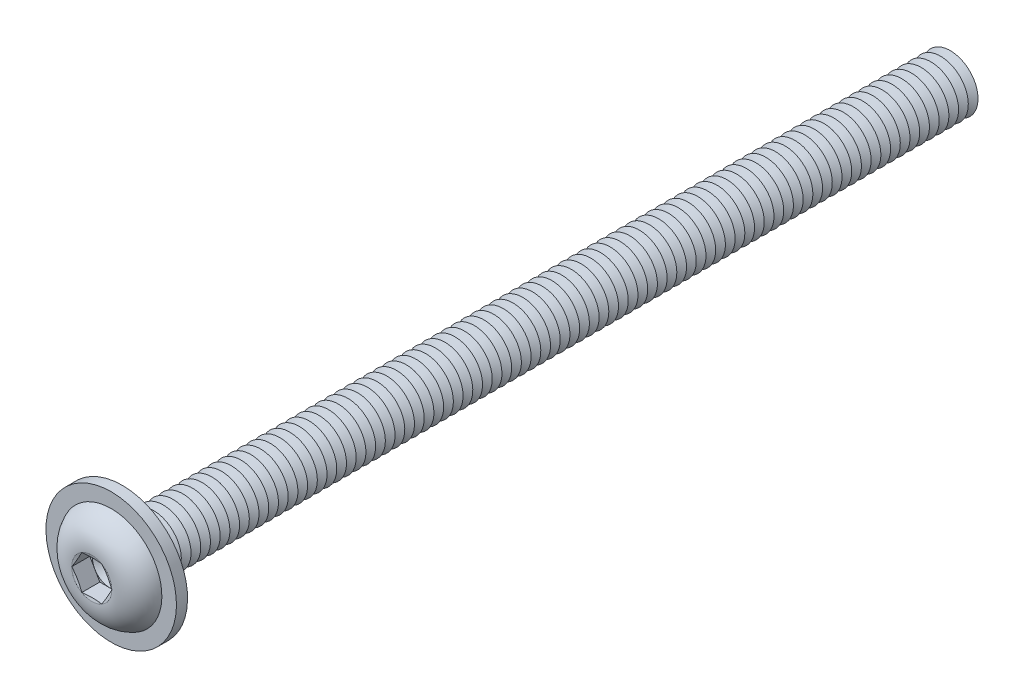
ISO-10303-21;
HEADER;
FILE_DESCRIPTION(('STEP AP214'),'2;1');
FILE_NAME('part.step','',(''),(''),'','','');
FILE_SCHEMA(('AUTOMOTIVE_DESIGN { 1 0 10303 214 1 1 1 1 }'));
ENDSEC;
DATA;
#1=APPLICATION_CONTEXT('core data for automotive mechanical design processes');
#2=APPLICATION_PROTOCOL_DEFINITION('international standard','automotive_design',2000,#1);
#3=PRODUCT_CONTEXT('',#1,'mechanical');
#4=PRODUCT('Part','Part','',(#3));
#5=PRODUCT_RELATED_PRODUCT_CATEGORY('part','',(#4));
#6=PRODUCT_DEFINITION_FORMATION('','',#4);
#7=PRODUCT_DEFINITION_CONTEXT('part definition',#1,'design');
#8=PRODUCT_DEFINITION('design','',#6,#7);
#9=PRODUCT_DEFINITION_SHAPE('','',#8);
#10=(LENGTH_UNIT() NAMED_UNIT(*) SI_UNIT(.MILLI.,.METRE.));
#11=(NAMED_UNIT(*) PLANE_ANGLE_UNIT() SI_UNIT($,.RADIAN.));
#12=(NAMED_UNIT(*) SI_UNIT($,.STERADIAN.) SOLID_ANGLE_UNIT());
#13=UNCERTAINTY_MEASURE_WITH_UNIT(LENGTH_MEASURE(1.E-05),#10,'distance_accuracy_value','');
#14=(GEOMETRIC_REPRESENTATION_CONTEXT(3) GLOBAL_UNCERTAINTY_ASSIGNED_CONTEXT((#13)) GLOBAL_UNIT_ASSIGNED_CONTEXT((#10,
#11,#12)) REPRESENTATION_CONTEXT('',''));
#15=CARTESIAN_POINT('',(0.,0.,0.));
#16=DIRECTION('',(0.,0.,1.));
#17=DIRECTION('',(1.,0.,0.));
#18=AXIS2_PLACEMENT_3D('',#15,#16,#17);
#19=CARTESIAN_POINT('',(0.,0.,-57.55));
#20=DIRECTION('',(0.,0.,1.));
#21=DIRECTION('',(0.,-1.,0.));
#22=AXIS2_PLACEMENT_3D('',#19,#20,#21);
#23=CONICAL_SURFACE('',#22,1.99999999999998,1.04719755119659);
#24=CARTESIAN_POINT('',(0.,0.,-57.9));
#25=DIRECTION('',(0.,0.,1.));
#26=DIRECTION('',(0.,-1.,0.));
#27=AXIS2_PLACEMENT_3D('',#24,#25,#26);
#28=CIRCLE('',#27,1.39378221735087);
#29=CARTESIAN_POINT('',(0.,-1.39378221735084,-57.9));
#30=VERTEX_POINT('',#29);
#31=EDGE_CURVE('E889',#30,#30,#28,.T.);
#32=ORIENTED_EDGE('',*,*,#31,.T.);
#33=EDGE_LOOP('',(#32));
#34=FACE_BOUND('',#33,.T.);
#35=CARTESIAN_POINT('',(0.,0.,-57.55));
#36=DIRECTION('',(0.,0.,1.));
#37=DIRECTION('',(0.,-1.,0.));
#38=AXIS2_PLACEMENT_3D('',#35,#36,#37);
#39=CIRCLE('',#38,1.99999999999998);
#40=CARTESIAN_POINT('',(0.,-1.99999999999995,-57.55));
#41=VERTEX_POINT('',#40);
#42=EDGE_CURVE('E885',#41,#41,#39,.T.);
#43=ORIENTED_EDGE('',*,*,#42,.F.);
#44=EDGE_LOOP('',(#43));
#45=FACE_BOUND('',#44,.T.);
#46=ADVANCED_FACE('F39',(#34,#45),#23,.T.);
#47=CARTESIAN_POINT('',(0.,0.,-57.9));
#48=DIRECTION('',(0.,0.,-1.));
#49=DIRECTION('',(0.,1.,0.));
#50=AXIS2_PLACEMENT_3D('',#47,#48,#49);
#51=CONICAL_SURFACE('',#50,1.39378221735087,1.0471975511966);
#52=CARTESIAN_POINT('',(0.,0.,-58.25));
#53=DIRECTION('',(0.,0.,1.));
#54=DIRECTION('',(0.,-1.,0.));
#55=AXIS2_PLACEMENT_3D('',#52,#53,#54);
#56=CIRCLE('',#55,1.99999999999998);
#57=CARTESIAN_POINT('',(0.,-1.99999999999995,-58.25));
#58=VERTEX_POINT('',#57);
#59=EDGE_CURVE('E893',#58,#58,#56,.T.);
#60=ORIENTED_EDGE('',*,*,#59,.T.);
#61=EDGE_LOOP('',(#60));
#62=FACE_BOUND('',#61,.T.);
#63=ORIENTED_EDGE('',*,*,#31,.F.);
#64=EDGE_LOOP('',(#63));
#65=FACE_BOUND('',#64,.T.);
#66=ADVANCED_FACE('F1012',(#62,#65),#51,.T.);
#67=CARTESIAN_POINT('',(0.,1.99999999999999,-60.));
#68=DIRECTION('',(0.,0.,-1.));
#69=DIRECTION('',(0.,1.,0.));
#70=AXIS2_PLACEMENT_3D('',#67,#68,#69);
#71=PLANE('',#70);
#72=CARTESIAN_POINT('',(0.,0.,-60.));
#73=DIRECTION('',(0.,0.,1.));
#74=DIRECTION('',(0.,-1.,0.));
#75=AXIS2_PLACEMENT_3D('',#72,#73,#74);
#76=CIRCLE('',#75,1.39378221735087);
#77=CARTESIAN_POINT('',(0.,-1.39378221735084,-60.));
#78=VERTEX_POINT('',#77);
#79=EDGE_CURVE('E913',#78,#78,#76,.T.);
#80=ORIENTED_EDGE('',*,*,#79,.F.);
#81=EDGE_LOOP('',(#80));
#82=FACE_BOUND('',#81,.T.);
#83=ADVANCED_FACE('F1018',(#82),#71,.T.);
#84=CARTESIAN_POINT('',(0.,0.,-59.65));
#85=DIRECTION('',(0.,0.,1.));
#86=DIRECTION('',(0.,-1.,0.));
#87=AXIS2_PLACEMENT_3D('',#84,#85,#86);
#88=CONICAL_SURFACE('',#87,1.99999999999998,1.04719755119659);
#89=ORIENTED_EDGE('',*,*,#79,.T.);
#90=EDGE_LOOP('',(#89));
#91=FACE_BOUND('',#90,.T.);
#92=CARTESIAN_POINT('',(0.,0.,-59.65));
#93=DIRECTION('',(0.,0.,1.));
#94=DIRECTION('',(0.,-1.,0.));
#95=AXIS2_PLACEMENT_3D('',#92,#93,#94);
#96=CIRCLE('',#95,1.99999999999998);
#97=CARTESIAN_POINT('',(0.,-1.99999999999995,-59.65));
#98=VERTEX_POINT('',#97);
#99=EDGE_CURVE('E909',#98,#98,#96,.T.);
#100=ORIENTED_EDGE('',*,*,#99,.F.);
#101=EDGE_LOOP('',(#100));
#102=FACE_BOUND('',#101,.T.);
#103=ADVANCED_FACE('F1037',(#91,#102),#88,.T.);
#104=CARTESIAN_POINT('',(0.,0.,-59.3));
#105=DIRECTION('',(0.,0.,-1.));
#106=DIRECTION('',(0.,1.,0.));
#107=AXIS2_PLACEMENT_3D('',#104,#105,#106);
#108=CONICAL_SURFACE('',#107,1.39378221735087,1.0471975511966);
#109=ORIENTED_EDGE('',*,*,#99,.T.);
#110=EDGE_LOOP('',(#109));
#111=FACE_BOUND('',#110,.T.);
#112=CARTESIAN_POINT('',(0.,0.,-59.3));
#113=DIRECTION('',(0.,0.,1.));
#114=DIRECTION('',(0.,-1.,0.));
#115=AXIS2_PLACEMENT_3D('',#112,#113,#114);
#116=CIRCLE('',#115,1.39378221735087);
#117=CARTESIAN_POINT('',(0.,-1.39378221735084,-59.3));
#118=VERTEX_POINT('',#117);
#119=EDGE_CURVE('E905',#118,#118,#116,.T.);
#120=ORIENTED_EDGE('',*,*,#119,.F.);
#121=EDGE_LOOP('',(#120));
#122=FACE_BOUND('',#121,.T.);
#123=ADVANCED_FACE('F1034',(#111,#122),#108,.T.);
#124=CARTESIAN_POINT('',(0.,0.,-58.95));
#125=DIRECTION('',(0.,0.,1.));
#126=DIRECTION('',(0.,-1.,0.));
#127=AXIS2_PLACEMENT_3D('',#124,#125,#126);
#128=CONICAL_SURFACE('',#127,1.99999999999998,1.04719755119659);
#129=ORIENTED_EDGE('',*,*,#119,.T.);
#130=EDGE_LOOP('',(#129));
#131=FACE_BOUND('',#130,.T.);
#132=CARTESIAN_POINT('',(0.,0.,-58.95));
#133=DIRECTION('',(0.,0.,1.));
#134=DIRECTION('',(0.,-1.,0.));
#135=AXIS2_PLACEMENT_3D('',#132,#133,#134);
#136=CIRCLE('',#135,1.99999999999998);
#137=CARTESIAN_POINT('',(0.,-1.99999999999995,-58.95));
#138=VERTEX_POINT('',#137);
#139=EDGE_CURVE('E901',#138,#138,#136,.T.);
#140=ORIENTED_EDGE('',*,*,#139,.F.);
#141=EDGE_LOOP('',(#140));
#142=FACE_BOUND('',#141,.T.);
#143=ADVANCED_FACE('F1028',(#131,#142),#128,.T.);
#144=CARTESIAN_POINT('',(0.,0.,-58.6));
#145=DIRECTION('',(0.,0.,-1.));
#146=DIRECTION('',(0.,1.,0.));
#147=AXIS2_PLACEMENT_3D('',#144,#145,#146);
#148=CONICAL_SURFACE('',#147,1.39378221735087,1.0471975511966);
#149=ORIENTED_EDGE('',*,*,#139,.T.);
#150=EDGE_LOOP('',(#149));
#151=FACE_BOUND('',#150,.T.);
#152=CARTESIAN_POINT('',(0.,0.,-58.6));
#153=DIRECTION('',(0.,0.,1.));
#154=DIRECTION('',(0.,-1.,0.));
#155=AXIS2_PLACEMENT_3D('',#152,#153,#154);
#156=CIRCLE('',#155,1.39378221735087);
#157=CARTESIAN_POINT('',(0.,-1.39378221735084,-58.6));
#158=VERTEX_POINT('',#157);
#159=EDGE_CURVE('E897',#158,#158,#156,.T.);
#160=ORIENTED_EDGE('',*,*,#159,.F.);
#161=EDGE_LOOP('',(#160));
#162=FACE_BOUND('',#161,.T.);
#163=ADVANCED_FACE('F1024',(#151,#162),#148,.T.);
#164=CARTESIAN_POINT('',(0.,0.,-58.25));
#165=DIRECTION('',(0.,0.,1.));
#166=DIRECTION('',(0.,-1.,0.));
#167=AXIS2_PLACEMENT_3D('',#164,#165,#166);
#168=CONICAL_SURFACE('',#167,1.99999999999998,1.04719755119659);
#169=ORIENTED_EDGE('',*,*,#159,.T.);
#170=EDGE_LOOP('',(#169));
#171=FACE_BOUND('',#170,.T.);
#172=ORIENTED_EDGE('',*,*,#59,.F.);
#173=EDGE_LOOP('',(#172));
#174=FACE_BOUND('',#173,.T.);
#175=ADVANCED_FACE('F1027',(#171,#174),#168,.T.);
#176=CARTESIAN_POINT('',(0.,0.,-56.85));
#177=DIRECTION('',(0.,0.,1.));
#178=DIRECTION('',(0.,-1.,0.));
#179=AXIS2_PLACEMENT_3D('',#176,#177,#178);
#180=CONICAL_SURFACE('',#179,1.99999999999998,1.04719755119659);
#181=CARTESIAN_POINT('',(0.,0.,-57.2));
#182=DIRECTION('',(0.,0.,1.));
#183=DIRECTION('',(0.,-1.,0.));
#184=AXIS2_PLACEMENT_3D('',#181,#182,#183);
#185=CIRCLE('',#184,1.39378221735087);
#186=CARTESIAN_POINT('',(0.,-1.39378221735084,-57.2));
#187=VERTEX_POINT('',#186);
#188=EDGE_CURVE('E881',#187,#187,#185,.T.);
#189=ORIENTED_EDGE('',*,*,#188,.T.);
#190=EDGE_LOOP('',(#189));
#191=FACE_BOUND('',#190,.T.);
#192=CARTESIAN_POINT('',(0.,0.,-56.85));
#193=DIRECTION('',(0.,0.,1.));
#194=DIRECTION('',(0.,-1.,0.));
#195=AXIS2_PLACEMENT_3D('',#192,#193,#194);
#196=CIRCLE('',#195,1.99999999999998);
#197=CARTESIAN_POINT('',(0.,-1.99999999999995,-56.85));
#198=VERTEX_POINT('',#197);
#199=EDGE_CURVE('E877',#198,#198,#196,.T.);
#200=ORIENTED_EDGE('',*,*,#199,.F.);
#201=EDGE_LOOP('',(#200));
#202=FACE_BOUND('',#201,.T.);
#203=ADVANCED_FACE('F1032',(#191,#202),#180,.T.);
#204=CARTESIAN_POINT('',(0.,0.,-57.2));
#205=DIRECTION('',(0.,0.,-1.));
#206=DIRECTION('',(0.,1.,0.));
#207=AXIS2_PLACEMENT_3D('',#204,#205,#206);
#208=CONICAL_SURFACE('',#207,1.39378221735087,1.0471975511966);
#209=ORIENTED_EDGE('',*,*,#42,.T.);
#210=EDGE_LOOP('',(#209));
#211=FACE_BOUND('',#210,.T.);
#212=ORIENTED_EDGE('',*,*,#188,.F.);
#213=EDGE_LOOP('',(#212));
#214=FACE_BOUND('',#213,.T.);
#215=ADVANCED_FACE('F1083',(#211,#214),#208,.T.);
#216=CARTESIAN_POINT('',(0.,0.,-56.15));
#217=DIRECTION('',(0.,0.,1.));
#218=DIRECTION('',(0.,-1.,0.));
#219=AXIS2_PLACEMENT_3D('',#216,#217,#218);
#220=CONICAL_SURFACE('',#219,1.99999999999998,1.04719755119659);
#221=CARTESIAN_POINT('',(0.,0.,-56.5));
#222=DIRECTION('',(0.,0.,1.));
#223=DIRECTION('',(0.,-1.,0.));
#224=AXIS2_PLACEMENT_3D('',#221,#222,#223);
#225=CIRCLE('',#224,1.39378221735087);
#226=CARTESIAN_POINT('',(0.,-1.39378221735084,-56.5));
#227=VERTEX_POINT('',#226);
#228=EDGE_CURVE('E873',#227,#227,#225,.T.);
#229=ORIENTED_EDGE('',*,*,#228,.T.);
#230=EDGE_LOOP('',(#229));
#231=FACE_BOUND('',#230,.T.);
#232=CARTESIAN_POINT('',(0.,0.,-56.15));
#233=DIRECTION('',(0.,0.,1.));
#234=DIRECTION('',(0.,-1.,0.));
#235=AXIS2_PLACEMENT_3D('',#232,#233,#234);
#236=CIRCLE('',#235,1.99999999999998);
#237=CARTESIAN_POINT('',(0.,-1.99999999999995,-56.15));
#238=VERTEX_POINT('',#237);
#239=EDGE_CURVE('E869',#238,#238,#236,.T.);
#240=ORIENTED_EDGE('',*,*,#239,.F.);
#241=EDGE_LOOP('',(#240));
#242=FACE_BOUND('',#241,.T.);
#243=ADVANCED_FACE('F1089',(#231,#242),#220,.T.);
#244=CARTESIAN_POINT('',(0.,0.,-56.5));
#245=DIRECTION('',(0.,0.,-1.));
#246=DIRECTION('',(0.,1.,0.));
#247=AXIS2_PLACEMENT_3D('',#244,#245,#246);
#248=CONICAL_SURFACE('',#247,1.39378221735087,1.0471975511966);
#249=ORIENTED_EDGE('',*,*,#199,.T.);
#250=EDGE_LOOP('',(#249));
#251=FACE_BOUND('',#250,.T.);
#252=ORIENTED_EDGE('',*,*,#228,.F.);
#253=EDGE_LOOP('',(#252));
#254=FACE_BOUND('',#253,.T.);
#255=ADVANCED_FACE('F1096',(#251,#254),#248,.T.);
#256=CARTESIAN_POINT('',(0.,0.,-55.45));
#257=DIRECTION('',(0.,0.,1.));
#258=DIRECTION('',(0.,-1.,0.));
#259=AXIS2_PLACEMENT_3D('',#256,#257,#258);
#260=CONICAL_SURFACE('',#259,1.99999999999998,1.04719755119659);
#261=CARTESIAN_POINT('',(0.,0.,-55.8));
#262=DIRECTION('',(0.,0.,1.));
#263=DIRECTION('',(0.,-1.,0.));
#264=AXIS2_PLACEMENT_3D('',#261,#262,#263);
#265=CIRCLE('',#264,1.39378221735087);
#266=CARTESIAN_POINT('',(0.,-1.39378221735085,-55.8));
#267=VERTEX_POINT('',#266);
#268=EDGE_CURVE('E865',#267,#267,#265,.T.);
#269=ORIENTED_EDGE('',*,*,#268,.T.);
#270=EDGE_LOOP('',(#269));
#271=FACE_BOUND('',#270,.T.);
#272=CARTESIAN_POINT('',(0.,0.,-55.45));
#273=DIRECTION('',(0.,0.,1.));
#274=DIRECTION('',(0.,-1.,0.));
#275=AXIS2_PLACEMENT_3D('',#272,#273,#274);
#276=CIRCLE('',#275,1.99999999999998);
#277=CARTESIAN_POINT('',(0.,-1.99999999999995,-55.45));
#278=VERTEX_POINT('',#277);
#279=EDGE_CURVE('E861',#278,#278,#276,.T.);
#280=ORIENTED_EDGE('',*,*,#279,.F.);
#281=EDGE_LOOP('',(#280));
#282=FACE_BOUND('',#281,.T.);
#283=ADVANCED_FACE('F1103',(#271,#282),#260,.T.);
#284=CARTESIAN_POINT('',(0.,0.,-55.8));
#285=DIRECTION('',(0.,0.,-1.));
#286=DIRECTION('',(0.,1.,0.));
#287=AXIS2_PLACEMENT_3D('',#284,#285,#286);
#288=CONICAL_SURFACE('',#287,1.39378221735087,1.0471975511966);
#289=ORIENTED_EDGE('',*,*,#239,.T.);
#290=EDGE_LOOP('',(#289));
#291=FACE_BOUND('',#290,.T.);
#292=ORIENTED_EDGE('',*,*,#268,.F.);
#293=EDGE_LOOP('',(#292));
#294=FACE_BOUND('',#293,.T.);
#295=ADVANCED_FACE('F1110',(#291,#294),#288,.T.);
#296=CARTESIAN_POINT('',(0.,0.,-54.75));
#297=DIRECTION('',(0.,0.,1.));
#298=DIRECTION('',(0.,-1.,0.));
#299=AXIS2_PLACEMENT_3D('',#296,#297,#298);
#300=CONICAL_SURFACE('',#299,1.99999999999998,1.04719755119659);
#301=CARTESIAN_POINT('',(0.,0.,-55.1));
#302=DIRECTION('',(0.,0.,1.));
#303=DIRECTION('',(0.,-1.,0.));
#304=AXIS2_PLACEMENT_3D('',#301,#302,#303);
#305=CIRCLE('',#304,1.39378221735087);
#306=CARTESIAN_POINT('',(0.,-1.39378221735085,-55.1));
#307=VERTEX_POINT('',#306);
#308=EDGE_CURVE('E857',#307,#307,#305,.T.);
#309=ORIENTED_EDGE('',*,*,#308,.T.);
#310=EDGE_LOOP('',(#309));
#311=FACE_BOUND('',#310,.T.);
#312=CARTESIAN_POINT('',(0.,0.,-54.75));
#313=DIRECTION('',(0.,0.,1.));
#314=DIRECTION('',(0.,-1.,0.));
#315=AXIS2_PLACEMENT_3D('',#312,#313,#314);
#316=CIRCLE('',#315,1.99999999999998);
#317=CARTESIAN_POINT('',(0.,-1.99999999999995,-54.75));
#318=VERTEX_POINT('',#317);
#319=EDGE_CURVE('E853',#318,#318,#316,.T.);
#320=ORIENTED_EDGE('',*,*,#319,.F.);
#321=EDGE_LOOP('',(#320));
#322=FACE_BOUND('',#321,.T.);
#323=ADVANCED_FACE('F1117',(#311,#322),#300,.T.);
#324=CARTESIAN_POINT('',(0.,0.,-55.1));
#325=DIRECTION('',(0.,0.,-1.));
#326=DIRECTION('',(0.,1.,0.));
#327=AXIS2_PLACEMENT_3D('',#324,#325,#326);
#328=CONICAL_SURFACE('',#327,1.39378221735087,1.0471975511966);
#329=ORIENTED_EDGE('',*,*,#279,.T.);
#330=EDGE_LOOP('',(#329));
#331=FACE_BOUND('',#330,.T.);
#332=ORIENTED_EDGE('',*,*,#308,.F.);
#333=EDGE_LOOP('',(#332));
#334=FACE_BOUND('',#333,.T.);
#335=ADVANCED_FACE('F1124',(#331,#334),#328,.T.);
#336=CARTESIAN_POINT('',(0.,0.,-54.05));
#337=DIRECTION('',(0.,0.,1.));
#338=DIRECTION('',(0.,-1.,0.));
#339=AXIS2_PLACEMENT_3D('',#336,#337,#338);
#340=CONICAL_SURFACE('',#339,1.99999999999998,1.04719755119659);
#341=CARTESIAN_POINT('',(0.,0.,-54.4));
#342=DIRECTION('',(0.,0.,1.));
#343=DIRECTION('',(0.,-1.,0.));
#344=AXIS2_PLACEMENT_3D('',#341,#342,#343);
#345=CIRCLE('',#344,1.39378221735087);
#346=CARTESIAN_POINT('',(0.,-1.39378221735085,-54.4));
#347=VERTEX_POINT('',#346);
#348=EDGE_CURVE('E849',#347,#347,#345,.T.);
#349=ORIENTED_EDGE('',*,*,#348,.T.);
#350=EDGE_LOOP('',(#349));
#351=FACE_BOUND('',#350,.T.);
#352=CARTESIAN_POINT('',(0.,0.,-54.05));
#353=DIRECTION('',(0.,0.,1.));
#354=DIRECTION('',(0.,-1.,0.));
#355=AXIS2_PLACEMENT_3D('',#352,#353,#354);
#356=CIRCLE('',#355,1.99999999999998);
#357=CARTESIAN_POINT('',(0.,-1.99999999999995,-54.05));
#358=VERTEX_POINT('',#357);
#359=EDGE_CURVE('E845',#358,#358,#356,.T.);
#360=ORIENTED_EDGE('',*,*,#359,.F.);
#361=EDGE_LOOP('',(#360));
#362=FACE_BOUND('',#361,.T.);
#363=ADVANCED_FACE('F1131',(#351,#362),#340,.T.);
#364=CARTESIAN_POINT('',(0.,0.,-54.4));
#365=DIRECTION('',(0.,0.,-1.));
#366=DIRECTION('',(0.,1.,0.));
#367=AXIS2_PLACEMENT_3D('',#364,#365,#366);
#368=CONICAL_SURFACE('',#367,1.39378221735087,1.0471975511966);
#369=ORIENTED_EDGE('',*,*,#319,.T.);
#370=EDGE_LOOP('',(#369));
#371=FACE_BOUND('',#370,.T.);
#372=ORIENTED_EDGE('',*,*,#348,.F.);
#373=EDGE_LOOP('',(#372));
#374=FACE_BOUND('',#373,.T.);
#375=ADVANCED_FACE('F1138',(#371,#374),#368,.T.);
#376=CARTESIAN_POINT('',(0.,0.,-53.35));
#377=DIRECTION('',(0.,0.,1.));
#378=DIRECTION('',(0.,-1.,0.));
#379=AXIS2_PLACEMENT_3D('',#376,#377,#378);
#380=CONICAL_SURFACE('',#379,1.99999999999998,1.04719755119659);
#381=CARTESIAN_POINT('',(0.,0.,-53.7));
#382=DIRECTION('',(0.,0.,1.));
#383=DIRECTION('',(0.,-1.,0.));
#384=AXIS2_PLACEMENT_3D('',#381,#382,#383);
#385=CIRCLE('',#384,1.39378221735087);
#386=CARTESIAN_POINT('',(0.,-1.39378221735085,-53.7));
#387=VERTEX_POINT('',#386);
#388=EDGE_CURVE('E841',#387,#387,#385,.T.);
#389=ORIENTED_EDGE('',*,*,#388,.T.);
#390=EDGE_LOOP('',(#389));
#391=FACE_BOUND('',#390,.T.);
#392=CARTESIAN_POINT('',(0.,0.,-53.35));
#393=DIRECTION('',(0.,0.,1.));
#394=DIRECTION('',(0.,-1.,0.));
#395=AXIS2_PLACEMENT_3D('',#392,#393,#394);
#396=CIRCLE('',#395,1.99999999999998);
#397=CARTESIAN_POINT('',(0.,-1.99999999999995,-53.35));
#398=VERTEX_POINT('',#397);
#399=EDGE_CURVE('E837',#398,#398,#396,.T.);
#400=ORIENTED_EDGE('',*,*,#399,.F.);
#401=EDGE_LOOP('',(#400));
#402=FACE_BOUND('',#401,.T.);
#403=ADVANCED_FACE('F1145',(#391,#402),#380,.T.);
#404=CARTESIAN_POINT('',(0.,0.,-53.7));
#405=DIRECTION('',(0.,0.,-1.));
#406=DIRECTION('',(0.,1.,0.));
#407=AXIS2_PLACEMENT_3D('',#404,#405,#406);
#408=CONICAL_SURFACE('',#407,1.39378221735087,1.0471975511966);
#409=ORIENTED_EDGE('',*,*,#359,.T.);
#410=EDGE_LOOP('',(#409));
#411=FACE_BOUND('',#410,.T.);
#412=ORIENTED_EDGE('',*,*,#388,.F.);
#413=EDGE_LOOP('',(#412));
#414=FACE_BOUND('',#413,.T.);
#415=ADVANCED_FACE('F1152',(#411,#414),#408,.T.);
#416=CARTESIAN_POINT('',(0.,0.,-52.65));
#417=DIRECTION('',(0.,0.,1.));
#418=DIRECTION('',(0.,-1.,0.));
#419=AXIS2_PLACEMENT_3D('',#416,#417,#418);
#420=CONICAL_SURFACE('',#419,1.99999999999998,1.04719755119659);
#421=CARTESIAN_POINT('',(0.,0.,-53.));
#422=DIRECTION('',(0.,0.,1.));
#423=DIRECTION('',(0.,-1.,0.));
#424=AXIS2_PLACEMENT_3D('',#421,#422,#423);
#425=CIRCLE('',#424,1.39378221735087);
#426=CARTESIAN_POINT('',(0.,-1.39378221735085,-53.));
#427=VERTEX_POINT('',#426);
#428=EDGE_CURVE('E833',#427,#427,#425,.T.);
#429=ORIENTED_EDGE('',*,*,#428,.T.);
#430=EDGE_LOOP('',(#429));
#431=FACE_BOUND('',#430,.T.);
#432=CARTESIAN_POINT('',(0.,0.,-52.65));
#433=DIRECTION('',(0.,0.,1.));
#434=DIRECTION('',(0.,-1.,0.));
#435=AXIS2_PLACEMENT_3D('',#432,#433,#434);
#436=CIRCLE('',#435,1.99999999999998);
#437=CARTESIAN_POINT('',(0.,-1.99999999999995,-52.65));
#438=VERTEX_POINT('',#437);
#439=EDGE_CURVE('E829',#438,#438,#436,.T.);
#440=ORIENTED_EDGE('',*,*,#439,.F.);
#441=EDGE_LOOP('',(#440));
#442=FACE_BOUND('',#441,.T.);
#443=ADVANCED_FACE('F1159',(#431,#442),#420,.T.);
#444=CARTESIAN_POINT('',(0.,0.,-53.));
#445=DIRECTION('',(0.,0.,-1.));
#446=DIRECTION('',(0.,1.,0.));
#447=AXIS2_PLACEMENT_3D('',#444,#445,#446);
#448=CONICAL_SURFACE('',#447,1.39378221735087,1.0471975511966);
#449=ORIENTED_EDGE('',*,*,#399,.T.);
#450=EDGE_LOOP('',(#449));
#451=FACE_BOUND('',#450,.T.);
#452=ORIENTED_EDGE('',*,*,#428,.F.);
#453=EDGE_LOOP('',(#452));
#454=FACE_BOUND('',#453,.T.);
#455=ADVANCED_FACE('F1166',(#451,#454),#448,.T.);
#456=CARTESIAN_POINT('',(0.,0.,-51.95));
#457=DIRECTION('',(0.,0.,1.));
#458=DIRECTION('',(0.,-1.,0.));
#459=AXIS2_PLACEMENT_3D('',#456,#457,#458);
#460=CONICAL_SURFACE('',#459,1.99999999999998,1.04719755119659);
#461=CARTESIAN_POINT('',(0.,0.,-52.3));
#462=DIRECTION('',(0.,0.,1.));
#463=DIRECTION('',(0.,-1.,0.));
#464=AXIS2_PLACEMENT_3D('',#461,#462,#463);
#465=CIRCLE('',#464,1.39378221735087);
#466=CARTESIAN_POINT('',(0.,-1.39378221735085,-52.3));
#467=VERTEX_POINT('',#466);
#468=EDGE_CURVE('E825',#467,#467,#465,.T.);
#469=ORIENTED_EDGE('',*,*,#468,.T.);
#470=EDGE_LOOP('',(#469));
#471=FACE_BOUND('',#470,.T.);
#472=CARTESIAN_POINT('',(0.,0.,-51.95));
#473=DIRECTION('',(0.,0.,1.));
#474=DIRECTION('',(0.,-1.,0.));
#475=AXIS2_PLACEMENT_3D('',#472,#473,#474);
#476=CIRCLE('',#475,1.99999999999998);
#477=CARTESIAN_POINT('',(0.,-1.99999999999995,-51.95));
#478=VERTEX_POINT('',#477);
#479=EDGE_CURVE('E821',#478,#478,#476,.T.);
#480=ORIENTED_EDGE('',*,*,#479,.F.);
#481=EDGE_LOOP('',(#480));
#482=FACE_BOUND('',#481,.T.);
#483=ADVANCED_FACE('F1173',(#471,#482),#460,.T.);
#484=CARTESIAN_POINT('',(0.,0.,-52.3));
#485=DIRECTION('',(0.,0.,-1.));
#486=DIRECTION('',(0.,1.,0.));
#487=AXIS2_PLACEMENT_3D('',#484,#485,#486);
#488=CONICAL_SURFACE('',#487,1.39378221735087,1.0471975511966);
#489=ORIENTED_EDGE('',*,*,#439,.T.);
#490=EDGE_LOOP('',(#489));
#491=FACE_BOUND('',#490,.T.);
#492=ORIENTED_EDGE('',*,*,#468,.F.);
#493=EDGE_LOOP('',(#492));
#494=FACE_BOUND('',#493,.T.);
#495=ADVANCED_FACE('F1180',(#491,#494),#488,.T.);
#496=CARTESIAN_POINT('',(0.,0.,-51.25));
#497=DIRECTION('',(0.,0.,1.));
#498=DIRECTION('',(0.,-1.,0.));
#499=AXIS2_PLACEMENT_3D('',#496,#497,#498);
#500=CONICAL_SURFACE('',#499,1.99999999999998,1.04719755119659);
#501=CARTESIAN_POINT('',(0.,0.,-51.6));
#502=DIRECTION('',(0.,0.,1.));
#503=DIRECTION('',(0.,-1.,0.));
#504=AXIS2_PLACEMENT_3D('',#501,#502,#503);
#505=CIRCLE('',#504,1.39378221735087);
#506=CARTESIAN_POINT('',(0.,-1.39378221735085,-51.6));
#507=VERTEX_POINT('',#506);
#508=EDGE_CURVE('E817',#507,#507,#505,.T.);
#509=ORIENTED_EDGE('',*,*,#508,.T.);
#510=EDGE_LOOP('',(#509));
#511=FACE_BOUND('',#510,.T.);
#512=CARTESIAN_POINT('',(0.,0.,-51.25));
#513=DIRECTION('',(0.,0.,1.));
#514=DIRECTION('',(0.,-1.,0.));
#515=AXIS2_PLACEMENT_3D('',#512,#513,#514);
#516=CIRCLE('',#515,1.99999999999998);
#517=CARTESIAN_POINT('',(0.,-1.99999999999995,-51.25));
#518=VERTEX_POINT('',#517);
#519=EDGE_CURVE('E813',#518,#518,#516,.T.);
#520=ORIENTED_EDGE('',*,*,#519,.F.);
#521=EDGE_LOOP('',(#520));
#522=FACE_BOUND('',#521,.T.);
#523=ADVANCED_FACE('F1187',(#511,#522),#500,.T.);
#524=CARTESIAN_POINT('',(0.,0.,-51.6));
#525=DIRECTION('',(0.,0.,-1.));
#526=DIRECTION('',(0.,1.,0.));
#527=AXIS2_PLACEMENT_3D('',#524,#525,#526);
#528=CONICAL_SURFACE('',#527,1.39378221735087,1.0471975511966);
#529=ORIENTED_EDGE('',*,*,#479,.T.);
#530=EDGE_LOOP('',(#529));
#531=FACE_BOUND('',#530,.T.);
#532=ORIENTED_EDGE('',*,*,#508,.F.);
#533=EDGE_LOOP('',(#532));
#534=FACE_BOUND('',#533,.T.);
#535=ADVANCED_FACE('F1194',(#531,#534),#528,.T.);
#536=CARTESIAN_POINT('',(0.,0.,-50.55));
#537=DIRECTION('',(0.,0.,1.));
#538=DIRECTION('',(0.,-1.,0.));
#539=AXIS2_PLACEMENT_3D('',#536,#537,#538);
#540=CONICAL_SURFACE('',#539,1.99999999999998,1.04719755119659);
#541=CARTESIAN_POINT('',(0.,0.,-50.9));
#542=DIRECTION('',(0.,0.,1.));
#543=DIRECTION('',(0.,-1.,0.));
#544=AXIS2_PLACEMENT_3D('',#541,#542,#543);
#545=CIRCLE('',#544,1.39378221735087);
#546=CARTESIAN_POINT('',(0.,-1.39378221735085,-50.9));
#547=VERTEX_POINT('',#546);
#548=EDGE_CURVE('E809',#547,#547,#545,.T.);
#549=ORIENTED_EDGE('',*,*,#548,.T.);
#550=EDGE_LOOP('',(#549));
#551=FACE_BOUND('',#550,.T.);
#552=CARTESIAN_POINT('',(0.,0.,-50.55));
#553=DIRECTION('',(0.,0.,1.));
#554=DIRECTION('',(0.,-1.,0.));
#555=AXIS2_PLACEMENT_3D('',#552,#553,#554);
#556=CIRCLE('',#555,1.99999999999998);
#557=CARTESIAN_POINT('',(0.,-1.99999999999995,-50.55));
#558=VERTEX_POINT('',#557);
#559=EDGE_CURVE('E805',#558,#558,#556,.T.);
#560=ORIENTED_EDGE('',*,*,#559,.F.);
#561=EDGE_LOOP('',(#560));
#562=FACE_BOUND('',#561,.T.);
#563=ADVANCED_FACE('F1201',(#551,#562),#540,.T.);
#564=CARTESIAN_POINT('',(0.,0.,-50.9));
#565=DIRECTION('',(0.,0.,-1.));
#566=DIRECTION('',(0.,1.,0.));
#567=AXIS2_PLACEMENT_3D('',#564,#565,#566);
#568=CONICAL_SURFACE('',#567,1.39378221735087,1.0471975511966);
#569=ORIENTED_EDGE('',*,*,#519,.T.);
#570=EDGE_LOOP('',(#569));
#571=FACE_BOUND('',#570,.T.);
#572=ORIENTED_EDGE('',*,*,#548,.F.);
#573=EDGE_LOOP('',(#572));
#574=FACE_BOUND('',#573,.T.);
#575=ADVANCED_FACE('F1208',(#571,#574),#568,.T.);
#576=CARTESIAN_POINT('',(0.,0.,-49.85));
#577=DIRECTION('',(0.,0.,1.));
#578=DIRECTION('',(0.,-1.,0.));
#579=AXIS2_PLACEMENT_3D('',#576,#577,#578);
#580=CONICAL_SURFACE('',#579,1.99999999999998,1.04719755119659);
#581=CARTESIAN_POINT('',(0.,0.,-50.2));
#582=DIRECTION('',(0.,0.,1.));
#583=DIRECTION('',(0.,-1.,0.));
#584=AXIS2_PLACEMENT_3D('',#581,#582,#583);
#585=CIRCLE('',#584,1.39378221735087);
#586=CARTESIAN_POINT('',(0.,-1.39378221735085,-50.2));
#587=VERTEX_POINT('',#586);
#588=EDGE_CURVE('E801',#587,#587,#585,.T.);
#589=ORIENTED_EDGE('',*,*,#588,.T.);
#590=EDGE_LOOP('',(#589));
#591=FACE_BOUND('',#590,.T.);
#592=CARTESIAN_POINT('',(0.,0.,-49.85));
#593=DIRECTION('',(0.,0.,1.));
#594=DIRECTION('',(0.,-1.,0.));
#595=AXIS2_PLACEMENT_3D('',#592,#593,#594);
#596=CIRCLE('',#595,1.99999999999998);
#597=CARTESIAN_POINT('',(0.,-1.99999999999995,-49.85));
#598=VERTEX_POINT('',#597);
#599=EDGE_CURVE('E797',#598,#598,#596,.T.);
#600=ORIENTED_EDGE('',*,*,#599,.F.);
#601=EDGE_LOOP('',(#600));
#602=FACE_BOUND('',#601,.T.);
#603=ADVANCED_FACE('F1215',(#591,#602),#580,.T.);
#604=CARTESIAN_POINT('',(0.,0.,-50.2));
#605=DIRECTION('',(0.,0.,-1.));
#606=DIRECTION('',(0.,1.,0.));
#607=AXIS2_PLACEMENT_3D('',#604,#605,#606);
#608=CONICAL_SURFACE('',#607,1.39378221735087,1.0471975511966);
#609=ORIENTED_EDGE('',*,*,#559,.T.);
#610=EDGE_LOOP('',(#609));
#611=FACE_BOUND('',#610,.T.);
#612=ORIENTED_EDGE('',*,*,#588,.F.);
#613=EDGE_LOOP('',(#612));
#614=FACE_BOUND('',#613,.T.);
#615=ADVANCED_FACE('F1222',(#611,#614),#608,.T.);
#616=CARTESIAN_POINT('',(0.,0.,-49.15));
#617=DIRECTION('',(0.,0.,1.));
#618=DIRECTION('',(0.,-1.,0.));
#619=AXIS2_PLACEMENT_3D('',#616,#617,#618);
#620=CONICAL_SURFACE('',#619,1.99999999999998,1.04719755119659);
#621=CARTESIAN_POINT('',(0.,0.,-49.5));
#622=DIRECTION('',(0.,0.,1.));
#623=DIRECTION('',(0.,-1.,0.));
#624=AXIS2_PLACEMENT_3D('',#621,#622,#623);
#625=CIRCLE('',#624,1.39378221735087);
#626=CARTESIAN_POINT('',(0.,-1.39378221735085,-49.5));
#627=VERTEX_POINT('',#626);
#628=EDGE_CURVE('E793',#627,#627,#625,.T.);
#629=ORIENTED_EDGE('',*,*,#628,.T.);
#630=EDGE_LOOP('',(#629));
#631=FACE_BOUND('',#630,.T.);
#632=CARTESIAN_POINT('',(0.,0.,-49.15));
#633=DIRECTION('',(0.,0.,1.));
#634=DIRECTION('',(0.,-1.,0.));
#635=AXIS2_PLACEMENT_3D('',#632,#633,#634);
#636=CIRCLE('',#635,1.99999999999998);
#637=CARTESIAN_POINT('',(0.,-1.99999999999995,-49.15));
#638=VERTEX_POINT('',#637);
#639=EDGE_CURVE('E789',#638,#638,#636,.T.);
#640=ORIENTED_EDGE('',*,*,#639,.F.);
#641=EDGE_LOOP('',(#640));
#642=FACE_BOUND('',#641,.T.);
#643=ADVANCED_FACE('F1229',(#631,#642),#620,.T.);
#644=CARTESIAN_POINT('',(0.,0.,-49.5));
#645=DIRECTION('',(0.,0.,-1.));
#646=DIRECTION('',(0.,1.,0.));
#647=AXIS2_PLACEMENT_3D('',#644,#645,#646);
#648=CONICAL_SURFACE('',#647,1.39378221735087,1.0471975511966);
#649=ORIENTED_EDGE('',*,*,#599,.T.);
#650=EDGE_LOOP('',(#649));
#651=FACE_BOUND('',#650,.T.);
#652=ORIENTED_EDGE('',*,*,#628,.F.);
#653=EDGE_LOOP('',(#652));
#654=FACE_BOUND('',#653,.T.);
#655=ADVANCED_FACE('F1236',(#651,#654),#648,.T.);
#656=CARTESIAN_POINT('',(0.,0.,-48.45));
#657=DIRECTION('',(0.,0.,1.));
#658=DIRECTION('',(0.,-1.,0.));
#659=AXIS2_PLACEMENT_3D('',#656,#657,#658);
#660=CONICAL_SURFACE('',#659,1.99999999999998,1.04719755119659);
#661=CARTESIAN_POINT('',(0.,0.,-48.8));
#662=DIRECTION('',(0.,0.,1.));
#663=DIRECTION('',(0.,-1.,0.));
#664=AXIS2_PLACEMENT_3D('',#661,#662,#663);
#665=CIRCLE('',#664,1.39378221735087);
#666=CARTESIAN_POINT('',(0.,-1.39378221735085,-48.8));
#667=VERTEX_POINT('',#666);
#668=EDGE_CURVE('E785',#667,#667,#665,.T.);
#669=ORIENTED_EDGE('',*,*,#668,.T.);
#670=EDGE_LOOP('',(#669));
#671=FACE_BOUND('',#670,.T.);
#672=CARTESIAN_POINT('',(0.,0.,-48.45));
#673=DIRECTION('',(0.,0.,1.));
#674=DIRECTION('',(0.,-1.,0.));
#675=AXIS2_PLACEMENT_3D('',#672,#673,#674);
#676=CIRCLE('',#675,1.99999999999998);
#677=CARTESIAN_POINT('',(0.,-1.99999999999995,-48.45));
#678=VERTEX_POINT('',#677);
#679=EDGE_CURVE('E781',#678,#678,#676,.T.);
#680=ORIENTED_EDGE('',*,*,#679,.F.);
#681=EDGE_LOOP('',(#680));
#682=FACE_BOUND('',#681,.T.);
#683=ADVANCED_FACE('F1243',(#671,#682),#660,.T.);
#684=CARTESIAN_POINT('',(0.,0.,-48.8));
#685=DIRECTION('',(0.,0.,-1.));
#686=DIRECTION('',(0.,1.,0.));
#687=AXIS2_PLACEMENT_3D('',#684,#685,#686);
#688=CONICAL_SURFACE('',#687,1.39378221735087,1.0471975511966);
#689=ORIENTED_EDGE('',*,*,#639,.T.);
#690=EDGE_LOOP('',(#689));
#691=FACE_BOUND('',#690,.T.);
#692=ORIENTED_EDGE('',*,*,#668,.F.);
#693=EDGE_LOOP('',(#692));
#694=FACE_BOUND('',#693,.T.);
#695=ADVANCED_FACE('F1250',(#691,#694),#688,.T.);
#696=CARTESIAN_POINT('',(0.,0.,-47.75));
#697=DIRECTION('',(0.,0.,1.));
#698=DIRECTION('',(0.,-1.,0.));
#699=AXIS2_PLACEMENT_3D('',#696,#697,#698);
#700=CONICAL_SURFACE('',#699,1.99999999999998,1.04719755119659);
#701=CARTESIAN_POINT('',(0.,0.,-48.1));
#702=DIRECTION('',(0.,0.,1.));
#703=DIRECTION('',(0.,-1.,0.));
#704=AXIS2_PLACEMENT_3D('',#701,#702,#703);
#705=CIRCLE('',#704,1.39378221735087);
#706=CARTESIAN_POINT('',(0.,-1.39378221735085,-48.1));
#707=VERTEX_POINT('',#706);
#708=EDGE_CURVE('E777',#707,#707,#705,.T.);
#709=ORIENTED_EDGE('',*,*,#708,.T.);
#710=EDGE_LOOP('',(#709));
#711=FACE_BOUND('',#710,.T.);
#712=CARTESIAN_POINT('',(0.,0.,-47.75));
#713=DIRECTION('',(0.,0.,1.));
#714=DIRECTION('',(0.,-1.,0.));
#715=AXIS2_PLACEMENT_3D('',#712,#713,#714);
#716=CIRCLE('',#715,1.99999999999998);
#717=CARTESIAN_POINT('',(0.,-1.99999999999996,-47.75));
#718=VERTEX_POINT('',#717);
#719=EDGE_CURVE('E773',#718,#718,#716,.T.);
#720=ORIENTED_EDGE('',*,*,#719,.F.);
#721=EDGE_LOOP('',(#720));
#722=FACE_BOUND('',#721,.T.);
#723=ADVANCED_FACE('F1257',(#711,#722),#700,.T.);
#724=CARTESIAN_POINT('',(0.,0.,-48.1));
#725=DIRECTION('',(0.,0.,-1.));
#726=DIRECTION('',(0.,1.,0.));
#727=AXIS2_PLACEMENT_3D('',#724,#725,#726);
#728=CONICAL_SURFACE('',#727,1.39378221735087,1.0471975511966);
#729=ORIENTED_EDGE('',*,*,#679,.T.);
#730=EDGE_LOOP('',(#729));
#731=FACE_BOUND('',#730,.T.);
#732=ORIENTED_EDGE('',*,*,#708,.F.);
#733=EDGE_LOOP('',(#732));
#734=FACE_BOUND('',#733,.T.);
#735=ADVANCED_FACE('F1264',(#731,#734),#728,.T.);
#736=CARTESIAN_POINT('',(0.,0.,-47.05));
#737=DIRECTION('',(0.,0.,1.));
#738=DIRECTION('',(0.,-1.,0.));
#739=AXIS2_PLACEMENT_3D('',#736,#737,#738);
#740=CONICAL_SURFACE('',#739,1.99999999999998,1.04719755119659);
#741=CARTESIAN_POINT('',(0.,0.,-47.4));
#742=DIRECTION('',(0.,0.,1.));
#743=DIRECTION('',(0.,-1.,0.));
#744=AXIS2_PLACEMENT_3D('',#741,#742,#743);
#745=CIRCLE('',#744,1.39378221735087);
#746=CARTESIAN_POINT('',(0.,-1.39378221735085,-47.4));
#747=VERTEX_POINT('',#746);
#748=EDGE_CURVE('E769',#747,#747,#745,.T.);
#749=ORIENTED_EDGE('',*,*,#748,.T.);
#750=EDGE_LOOP('',(#749));
#751=FACE_BOUND('',#750,.T.);
#752=CARTESIAN_POINT('',(0.,0.,-47.05));
#753=DIRECTION('',(0.,0.,1.));
#754=DIRECTION('',(0.,-1.,0.));
#755=AXIS2_PLACEMENT_3D('',#752,#753,#754);
#756=CIRCLE('',#755,1.99999999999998);
#757=CARTESIAN_POINT('',(0.,-1.99999999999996,-47.05));
#758=VERTEX_POINT('',#757);
#759=EDGE_CURVE('E765',#758,#758,#756,.T.);
#760=ORIENTED_EDGE('',*,*,#759,.F.);
#761=EDGE_LOOP('',(#760));
#762=FACE_BOUND('',#761,.T.);
#763=ADVANCED_FACE('F1271',(#751,#762),#740,.T.);
#764=CARTESIAN_POINT('',(0.,0.,-47.4));
#765=DIRECTION('',(0.,0.,-1.));
#766=DIRECTION('',(0.,1.,0.));
#767=AXIS2_PLACEMENT_3D('',#764,#765,#766);
#768=CONICAL_SURFACE('',#767,1.39378221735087,1.0471975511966);
#769=ORIENTED_EDGE('',*,*,#719,.T.);
#770=EDGE_LOOP('',(#769));
#771=FACE_BOUND('',#770,.T.);
#772=ORIENTED_EDGE('',*,*,#748,.F.);
#773=EDGE_LOOP('',(#772));
#774=FACE_BOUND('',#773,.T.);
#775=ADVANCED_FACE('F1278',(#771,#774),#768,.T.);
#776=CARTESIAN_POINT('',(0.,0.,-46.35));
#777=DIRECTION('',(0.,0.,1.));
#778=DIRECTION('',(0.,-1.,0.));
#779=AXIS2_PLACEMENT_3D('',#776,#777,#778);
#780=CONICAL_SURFACE('',#779,1.99999999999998,1.04719755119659);
#781=CARTESIAN_POINT('',(0.,0.,-46.7));
#782=DIRECTION('',(0.,0.,1.));
#783=DIRECTION('',(0.,-1.,0.));
#784=AXIS2_PLACEMENT_3D('',#781,#782,#783);
#785=CIRCLE('',#784,1.39378221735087);
#786=CARTESIAN_POINT('',(0.,-1.39378221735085,-46.7));
#787=VERTEX_POINT('',#786);
#788=EDGE_CURVE('E761',#787,#787,#785,.T.);
#789=ORIENTED_EDGE('',*,*,#788,.T.);
#790=EDGE_LOOP('',(#789));
#791=FACE_BOUND('',#790,.T.);
#792=CARTESIAN_POINT('',(0.,0.,-46.35));
#793=DIRECTION('',(0.,0.,1.));
#794=DIRECTION('',(0.,-1.,0.));
#795=AXIS2_PLACEMENT_3D('',#792,#793,#794);
#796=CIRCLE('',#795,1.99999999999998);
#797=CARTESIAN_POINT('',(0.,-1.99999999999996,-46.35));
#798=VERTEX_POINT('',#797);
#799=EDGE_CURVE('E757',#798,#798,#796,.T.);
#800=ORIENTED_EDGE('',*,*,#799,.F.);
#801=EDGE_LOOP('',(#800));
#802=FACE_BOUND('',#801,.T.);
#803=ADVANCED_FACE('F1285',(#791,#802),#780,.T.);
#804=CARTESIAN_POINT('',(0.,0.,-46.7));
#805=DIRECTION('',(0.,0.,-1.));
#806=DIRECTION('',(0.,1.,0.));
#807=AXIS2_PLACEMENT_3D('',#804,#805,#806);
#808=CONICAL_SURFACE('',#807,1.39378221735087,1.0471975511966);
#809=ORIENTED_EDGE('',*,*,#759,.T.);
#810=EDGE_LOOP('',(#809));
#811=FACE_BOUND('',#810,.T.);
#812=ORIENTED_EDGE('',*,*,#788,.F.);
#813=EDGE_LOOP('',(#812));
#814=FACE_BOUND('',#813,.T.);
#815=ADVANCED_FACE('F1292',(#811,#814),#808,.T.);
#816=CARTESIAN_POINT('',(0.,0.,-45.65));
#817=DIRECTION('',(0.,0.,1.));
#818=DIRECTION('',(0.,-1.,0.));
#819=AXIS2_PLACEMENT_3D('',#816,#817,#818);
#820=CONICAL_SURFACE('',#819,1.99999999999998,1.04719755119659);
#821=CARTESIAN_POINT('',(0.,0.,-46.));
#822=DIRECTION('',(0.,0.,1.));
#823=DIRECTION('',(0.,-1.,0.));
#824=AXIS2_PLACEMENT_3D('',#821,#822,#823);
#825=CIRCLE('',#824,1.39378221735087);
#826=CARTESIAN_POINT('',(0.,-1.39378221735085,-46.));
#827=VERTEX_POINT('',#826);
#828=EDGE_CURVE('E753',#827,#827,#825,.T.);
#829=ORIENTED_EDGE('',*,*,#828,.T.);
#830=EDGE_LOOP('',(#829));
#831=FACE_BOUND('',#830,.T.);
#832=CARTESIAN_POINT('',(0.,0.,-45.65));
#833=DIRECTION('',(0.,0.,1.));
#834=DIRECTION('',(0.,-1.,0.));
#835=AXIS2_PLACEMENT_3D('',#832,#833,#834);
#836=CIRCLE('',#835,1.99999999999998);
#837=CARTESIAN_POINT('',(0.,-1.99999999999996,-45.65));
#838=VERTEX_POINT('',#837);
#839=EDGE_CURVE('E749',#838,#838,#836,.T.);
#840=ORIENTED_EDGE('',*,*,#839,.F.);
#841=EDGE_LOOP('',(#840));
#842=FACE_BOUND('',#841,.T.);
#843=ADVANCED_FACE('F1299',(#831,#842),#820,.T.);
#844=CARTESIAN_POINT('',(0.,0.,-46.));
#845=DIRECTION('',(0.,0.,-1.));
#846=DIRECTION('',(0.,1.,0.));
#847=AXIS2_PLACEMENT_3D('',#844,#845,#846);
#848=CONICAL_SURFACE('',#847,1.39378221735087,1.0471975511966);
#849=ORIENTED_EDGE('',*,*,#799,.T.);
#850=EDGE_LOOP('',(#849));
#851=FACE_BOUND('',#850,.T.);
#852=ORIENTED_EDGE('',*,*,#828,.F.);
#853=EDGE_LOOP('',(#852));
#854=FACE_BOUND('',#853,.T.);
#855=ADVANCED_FACE('F1306',(#851,#854),#848,.T.);
#856=CARTESIAN_POINT('',(0.,0.,-44.95));
#857=DIRECTION('',(0.,0.,1.));
#858=DIRECTION('',(0.,-1.,0.));
#859=AXIS2_PLACEMENT_3D('',#856,#857,#858);
#860=CONICAL_SURFACE('',#859,1.99999999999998,1.04719755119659);
#861=CARTESIAN_POINT('',(0.,0.,-45.3));
#862=DIRECTION('',(0.,0.,1.));
#863=DIRECTION('',(0.,-1.,0.));
#864=AXIS2_PLACEMENT_3D('',#861,#862,#863);
#865=CIRCLE('',#864,1.39378221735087);
#866=CARTESIAN_POINT('',(0.,-1.39378221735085,-45.3));
#867=VERTEX_POINT('',#866);
#868=EDGE_CURVE('E745',#867,#867,#865,.T.);
#869=ORIENTED_EDGE('',*,*,#868,.T.);
#870=EDGE_LOOP('',(#869));
#871=FACE_BOUND('',#870,.T.);
#872=CARTESIAN_POINT('',(0.,0.,-44.95));
#873=DIRECTION('',(0.,0.,1.));
#874=DIRECTION('',(0.,-1.,0.));
#875=AXIS2_PLACEMENT_3D('',#872,#873,#874);
#876=CIRCLE('',#875,1.99999999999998);
#877=CARTESIAN_POINT('',(0.,-1.99999999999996,-44.95));
#878=VERTEX_POINT('',#877);
#879=EDGE_CURVE('E741',#878,#878,#876,.T.);
#880=ORIENTED_EDGE('',*,*,#879,.F.);
#881=EDGE_LOOP('',(#880));
#882=FACE_BOUND('',#881,.T.);
#883=ADVANCED_FACE('F1313',(#871,#882),#860,.T.);
#884=CARTESIAN_POINT('',(0.,0.,-45.3));
#885=DIRECTION('',(0.,0.,-1.));
#886=DIRECTION('',(0.,1.,0.));
#887=AXIS2_PLACEMENT_3D('',#884,#885,#886);
#888=CONICAL_SURFACE('',#887,1.39378221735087,1.0471975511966);
#889=ORIENTED_EDGE('',*,*,#839,.T.);
#890=EDGE_LOOP('',(#889));
#891=FACE_BOUND('',#890,.T.);
#892=ORIENTED_EDGE('',*,*,#868,.F.);
#893=EDGE_LOOP('',(#892));
#894=FACE_BOUND('',#893,.T.);
#895=ADVANCED_FACE('F1320',(#891,#894),#888,.T.);
#896=CARTESIAN_POINT('',(0.,0.,-44.25));
#897=DIRECTION('',(0.,0.,1.));
#898=DIRECTION('',(0.,-1.,0.));
#899=AXIS2_PLACEMENT_3D('',#896,#897,#898);
#900=CONICAL_SURFACE('',#899,1.99999999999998,1.04719755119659);
#901=CARTESIAN_POINT('',(0.,0.,-44.6));
#902=DIRECTION('',(0.,0.,1.));
#903=DIRECTION('',(0.,-1.,0.));
#904=AXIS2_PLACEMENT_3D('',#901,#902,#903);
#905=CIRCLE('',#904,1.39378221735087);
#906=CARTESIAN_POINT('',(0.,-1.39378221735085,-44.6));
#907=VERTEX_POINT('',#906);
#908=EDGE_CURVE('E737',#907,#907,#905,.T.);
#909=ORIENTED_EDGE('',*,*,#908,.T.);
#910=EDGE_LOOP('',(#909));
#911=FACE_BOUND('',#910,.T.);
#912=CARTESIAN_POINT('',(0.,0.,-44.25));
#913=DIRECTION('',(0.,0.,1.));
#914=DIRECTION('',(0.,-1.,0.));
#915=AXIS2_PLACEMENT_3D('',#912,#913,#914);
#916=CIRCLE('',#915,1.99999999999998);
#917=CARTESIAN_POINT('',(0.,-1.99999999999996,-44.25));
#918=VERTEX_POINT('',#917);
#919=EDGE_CURVE('E733',#918,#918,#916,.T.);
#920=ORIENTED_EDGE('',*,*,#919,.F.);
#921=EDGE_LOOP('',(#920));
#922=FACE_BOUND('',#921,.T.);
#923=ADVANCED_FACE('F1327',(#911,#922),#900,.T.);
#924=CARTESIAN_POINT('',(0.,0.,-44.6));
#925=DIRECTION('',(0.,0.,-1.));
#926=DIRECTION('',(0.,1.,0.));
#927=AXIS2_PLACEMENT_3D('',#924,#925,#926);
#928=CONICAL_SURFACE('',#927,1.39378221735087,1.0471975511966);
#929=ORIENTED_EDGE('',*,*,#879,.T.);
#930=EDGE_LOOP('',(#929));
#931=FACE_BOUND('',#930,.T.);
#932=ORIENTED_EDGE('',*,*,#908,.F.);
#933=EDGE_LOOP('',(#932));
#934=FACE_BOUND('',#933,.T.);
#935=ADVANCED_FACE('F1334',(#931,#934),#928,.T.);
#936=CARTESIAN_POINT('',(0.,0.,-43.55));
#937=DIRECTION('',(0.,0.,1.));
#938=DIRECTION('',(0.,-1.,0.));
#939=AXIS2_PLACEMENT_3D('',#936,#937,#938);
#940=CONICAL_SURFACE('',#939,1.99999999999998,1.04719755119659);
#941=CARTESIAN_POINT('',(0.,0.,-43.9));
#942=DIRECTION('',(0.,0.,1.));
#943=DIRECTION('',(0.,-1.,0.));
#944=AXIS2_PLACEMENT_3D('',#941,#942,#943);
#945=CIRCLE('',#944,1.39378221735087);
#946=CARTESIAN_POINT('',(0.,-1.39378221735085,-43.9));
#947=VERTEX_POINT('',#946);
#948=EDGE_CURVE('E729',#947,#947,#945,.T.);
#949=ORIENTED_EDGE('',*,*,#948,.T.);
#950=EDGE_LOOP('',(#949));
#951=FACE_BOUND('',#950,.T.);
#952=CARTESIAN_POINT('',(0.,0.,-43.55));
#953=DIRECTION('',(0.,0.,1.));
#954=DIRECTION('',(0.,-1.,0.));
#955=AXIS2_PLACEMENT_3D('',#952,#953,#954);
#956=CIRCLE('',#955,1.99999999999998);
#957=CARTESIAN_POINT('',(0.,-1.99999999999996,-43.55));
#958=VERTEX_POINT('',#957);
#959=EDGE_CURVE('E725',#958,#958,#956,.T.);
#960=ORIENTED_EDGE('',*,*,#959,.F.);
#961=EDGE_LOOP('',(#960));
#962=FACE_BOUND('',#961,.T.);
#963=ADVANCED_FACE('F1341',(#951,#962),#940,.T.);
#964=CARTESIAN_POINT('',(0.,0.,-43.9));
#965=DIRECTION('',(0.,0.,-1.));
#966=DIRECTION('',(0.,1.,0.));
#967=AXIS2_PLACEMENT_3D('',#964,#965,#966);
#968=CONICAL_SURFACE('',#967,1.39378221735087,1.0471975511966);
#969=ORIENTED_EDGE('',*,*,#919,.T.);
#970=EDGE_LOOP('',(#969));
#971=FACE_BOUND('',#970,.T.);
#972=ORIENTED_EDGE('',*,*,#948,.F.);
#973=EDGE_LOOP('',(#972));
#974=FACE_BOUND('',#973,.T.);
#975=ADVANCED_FACE('F1348',(#971,#974),#968,.T.);
#976=CARTESIAN_POINT('',(0.,0.,-42.85));
#977=DIRECTION('',(0.,0.,1.));
#978=DIRECTION('',(0.,-1.,0.));
#979=AXIS2_PLACEMENT_3D('',#976,#977,#978);
#980=CONICAL_SURFACE('',#979,1.99999999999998,1.04719755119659);
#981=CARTESIAN_POINT('',(0.,0.,-43.2));
#982=DIRECTION('',(0.,0.,1.));
#983=DIRECTION('',(0.,-1.,0.));
#984=AXIS2_PLACEMENT_3D('',#981,#982,#983);
#985=CIRCLE('',#984,1.39378221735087);
#986=CARTESIAN_POINT('',(0.,-1.39378221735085,-43.2));
#987=VERTEX_POINT('',#986);
#988=EDGE_CURVE('E721',#987,#987,#985,.T.);
#989=ORIENTED_EDGE('',*,*,#988,.T.);
#990=EDGE_LOOP('',(#989));
#991=FACE_BOUND('',#990,.T.);
#992=CARTESIAN_POINT('',(0.,0.,-42.85));
#993=DIRECTION('',(0.,0.,1.));
#994=DIRECTION('',(0.,-1.,0.));
#995=AXIS2_PLACEMENT_3D('',#992,#993,#994);
#996=CIRCLE('',#995,1.99999999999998);
#997=CARTESIAN_POINT('',(0.,-1.99999999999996,-42.85));
#998=VERTEX_POINT('',#997);
#999=EDGE_CURVE('E717',#998,#998,#996,.T.);
#1000=ORIENTED_EDGE('',*,*,#999,.F.);
#1001=EDGE_LOOP('',(#1000));
#1002=FACE_BOUND('',#1001,.T.);
#1003=ADVANCED_FACE('F1355',(#991,#1002),#980,.T.);
#1004=CARTESIAN_POINT('',(0.,0.,-43.2));
#1005=DIRECTION('',(0.,0.,-1.));
#1006=DIRECTION('',(0.,1.,0.));
#1007=AXIS2_PLACEMENT_3D('',#1004,#1005,#1006);
#1008=CONICAL_SURFACE('',#1007,1.39378221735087,1.0471975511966);
#1009=ORIENTED_EDGE('',*,*,#959,.T.);
#1010=EDGE_LOOP('',(#1009));
#1011=FACE_BOUND('',#1010,.T.);
#1012=ORIENTED_EDGE('',*,*,#988,.F.);
#1013=EDGE_LOOP('',(#1012));
#1014=FACE_BOUND('',#1013,.T.);
#1015=ADVANCED_FACE('F1362',(#1011,#1014),#1008,.T.);
#1016=CARTESIAN_POINT('',(0.,0.,-42.15));
#1017=DIRECTION('',(0.,0.,1.));
#1018=DIRECTION('',(0.,-1.,0.));
#1019=AXIS2_PLACEMENT_3D('',#1016,#1017,#1018);
#1020=CONICAL_SURFACE('',#1019,1.99999999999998,1.04719755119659);
#1021=CARTESIAN_POINT('',(0.,0.,-42.5));
#1022=DIRECTION('',(0.,0.,1.));
#1023=DIRECTION('',(0.,-1.,0.));
#1024=AXIS2_PLACEMENT_3D('',#1021,#1022,#1023);
#1025=CIRCLE('',#1024,1.39378221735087);
#1026=CARTESIAN_POINT('',(0.,-1.39378221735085,-42.5));
#1027=VERTEX_POINT('',#1026);
#1028=EDGE_CURVE('E713',#1027,#1027,#1025,.T.);
#1029=ORIENTED_EDGE('',*,*,#1028,.T.);
#1030=EDGE_LOOP('',(#1029));
#1031=FACE_BOUND('',#1030,.T.);
#1032=CARTESIAN_POINT('',(0.,0.,-42.15));
#1033=DIRECTION('',(0.,0.,1.));
#1034=DIRECTION('',(0.,-1.,0.));
#1035=AXIS2_PLACEMENT_3D('',#1032,#1033,#1034);
#1036=CIRCLE('',#1035,1.99999999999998);
#1037=CARTESIAN_POINT('',(0.,-1.99999999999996,-42.15));
#1038=VERTEX_POINT('',#1037);
#1039=EDGE_CURVE('E709',#1038,#1038,#1036,.T.);
#1040=ORIENTED_EDGE('',*,*,#1039,.F.);
#1041=EDGE_LOOP('',(#1040));
#1042=FACE_BOUND('',#1041,.T.);
#1043=ADVANCED_FACE('F1369',(#1031,#1042),#1020,.T.);
#1044=CARTESIAN_POINT('',(0.,0.,-42.5));
#1045=DIRECTION('',(0.,0.,-1.));
#1046=DIRECTION('',(0.,1.,0.));
#1047=AXIS2_PLACEMENT_3D('',#1044,#1045,#1046);
#1048=CONICAL_SURFACE('',#1047,1.39378221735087,1.0471975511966);
#1049=ORIENTED_EDGE('',*,*,#999,.T.);
#1050=EDGE_LOOP('',(#1049));
#1051=FACE_BOUND('',#1050,.T.);
#1052=ORIENTED_EDGE('',*,*,#1028,.F.);
#1053=EDGE_LOOP('',(#1052));
#1054=FACE_BOUND('',#1053,.T.);
#1055=ADVANCED_FACE('F1376',(#1051,#1054),#1048,.T.);
#1056=CARTESIAN_POINT('',(0.,0.,-41.45));
#1057=DIRECTION('',(0.,0.,1.));
#1058=DIRECTION('',(0.,-1.,0.));
#1059=AXIS2_PLACEMENT_3D('',#1056,#1057,#1058);
#1060=CONICAL_SURFACE('',#1059,1.99999999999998,1.04719755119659);
#1061=CARTESIAN_POINT('',(0.,0.,-41.8));
#1062=DIRECTION('',(0.,0.,1.));
#1063=DIRECTION('',(0.,-1.,0.));
#1064=AXIS2_PLACEMENT_3D('',#1061,#1062,#1063);
#1065=CIRCLE('',#1064,1.39378221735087);
#1066=CARTESIAN_POINT('',(0.,-1.39378221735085,-41.8));
#1067=VERTEX_POINT('',#1066);
#1068=EDGE_CURVE('E705',#1067,#1067,#1065,.T.);
#1069=ORIENTED_EDGE('',*,*,#1068,.T.);
#1070=EDGE_LOOP('',(#1069));
#1071=FACE_BOUND('',#1070,.T.);
#1072=CARTESIAN_POINT('',(0.,0.,-41.45));
#1073=DIRECTION('',(0.,0.,1.));
#1074=DIRECTION('',(0.,-1.,0.));
#1075=AXIS2_PLACEMENT_3D('',#1072,#1073,#1074);
#1076=CIRCLE('',#1075,1.99999999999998);
#1077=CARTESIAN_POINT('',(0.,-1.99999999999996,-41.45));
#1078=VERTEX_POINT('',#1077);
#1079=EDGE_CURVE('E701',#1078,#1078,#1076,.T.);
#1080=ORIENTED_EDGE('',*,*,#1079,.F.);
#1081=EDGE_LOOP('',(#1080));
#1082=FACE_BOUND('',#1081,.T.);
#1083=ADVANCED_FACE('F1383',(#1071,#1082),#1060,.T.);
#1084=CARTESIAN_POINT('',(0.,0.,-41.8));
#1085=DIRECTION('',(0.,0.,-1.));
#1086=DIRECTION('',(0.,1.,0.));
#1087=AXIS2_PLACEMENT_3D('',#1084,#1085,#1086);
#1088=CONICAL_SURFACE('',#1087,1.39378221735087,1.0471975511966);
#1089=ORIENTED_EDGE('',*,*,#1039,.T.);
#1090=EDGE_LOOP('',(#1089));
#1091=FACE_BOUND('',#1090,.T.);
#1092=ORIENTED_EDGE('',*,*,#1068,.F.);
#1093=EDGE_LOOP('',(#1092));
#1094=FACE_BOUND('',#1093,.T.);
#1095=ADVANCED_FACE('F1390',(#1091,#1094),#1088,.T.);
#1096=CARTESIAN_POINT('',(0.,0.,-40.75));
#1097=DIRECTION('',(0.,0.,1.));
#1098=DIRECTION('',(0.,-1.,0.));
#1099=AXIS2_PLACEMENT_3D('',#1096,#1097,#1098);
#1100=CONICAL_SURFACE('',#1099,1.99999999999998,1.04719755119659);
#1101=CARTESIAN_POINT('',(0.,0.,-41.1));
#1102=DIRECTION('',(0.,0.,1.));
#1103=DIRECTION('',(0.,-1.,0.));
#1104=AXIS2_PLACEMENT_3D('',#1101,#1102,#1103);
#1105=CIRCLE('',#1104,1.39378221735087);
#1106=CARTESIAN_POINT('',(0.,-1.39378221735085,-41.1));
#1107=VERTEX_POINT('',#1106);
#1108=EDGE_CURVE('E697',#1107,#1107,#1105,.T.);
#1109=ORIENTED_EDGE('',*,*,#1108,.T.);
#1110=EDGE_LOOP('',(#1109));
#1111=FACE_BOUND('',#1110,.T.);
#1112=CARTESIAN_POINT('',(0.,0.,-40.75));
#1113=DIRECTION('',(0.,0.,1.));
#1114=DIRECTION('',(0.,-1.,0.));
#1115=AXIS2_PLACEMENT_3D('',#1112,#1113,#1114);
#1116=CIRCLE('',#1115,1.99999999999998);
#1117=CARTESIAN_POINT('',(0.,-1.99999999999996,-40.75));
#1118=VERTEX_POINT('',#1117);
#1119=EDGE_CURVE('E693',#1118,#1118,#1116,.T.);
#1120=ORIENTED_EDGE('',*,*,#1119,.F.);
#1121=EDGE_LOOP('',(#1120));
#1122=FACE_BOUND('',#1121,.T.);
#1123=ADVANCED_FACE('F1397',(#1111,#1122),#1100,.T.);
#1124=CARTESIAN_POINT('',(0.,0.,-41.1));
#1125=DIRECTION('',(0.,0.,-1.));
#1126=DIRECTION('',(0.,1.,0.));
#1127=AXIS2_PLACEMENT_3D('',#1124,#1125,#1126);
#1128=CONICAL_SURFACE('',#1127,1.39378221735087,1.0471975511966);
#1129=ORIENTED_EDGE('',*,*,#1079,.T.);
#1130=EDGE_LOOP('',(#1129));
#1131=FACE_BOUND('',#1130,.T.);
#1132=ORIENTED_EDGE('',*,*,#1108,.F.);
#1133=EDGE_LOOP('',(#1132));
#1134=FACE_BOUND('',#1133,.T.);
#1135=ADVANCED_FACE('F1404',(#1131,#1134),#1128,.T.);
#1136=CARTESIAN_POINT('',(0.,0.,-40.05));
#1137=DIRECTION('',(0.,0.,1.));
#1138=DIRECTION('',(0.,-1.,0.));
#1139=AXIS2_PLACEMENT_3D('',#1136,#1137,#1138);
#1140=CONICAL_SURFACE('',#1139,1.99999999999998,1.04719755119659);
#1141=CARTESIAN_POINT('',(0.,0.,-40.4));
#1142=DIRECTION('',(0.,0.,1.));
#1143=DIRECTION('',(0.,-1.,0.));
#1144=AXIS2_PLACEMENT_3D('',#1141,#1142,#1143);
#1145=CIRCLE('',#1144,1.39378221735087);
#1146=CARTESIAN_POINT('',(0.,-1.39378221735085,-40.4));
#1147=VERTEX_POINT('',#1146);
#1148=EDGE_CURVE('E689',#1147,#1147,#1145,.T.);
#1149=ORIENTED_EDGE('',*,*,#1148,.T.);
#1150=EDGE_LOOP('',(#1149));
#1151=FACE_BOUND('',#1150,.T.);
#1152=CARTESIAN_POINT('',(0.,0.,-40.05));
#1153=DIRECTION('',(0.,0.,1.));
#1154=DIRECTION('',(0.,-1.,0.));
#1155=AXIS2_PLACEMENT_3D('',#1152,#1153,#1154);
#1156=CIRCLE('',#1155,1.99999999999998);
#1157=CARTESIAN_POINT('',(0.,-1.99999999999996,-40.05));
#1158=VERTEX_POINT('',#1157);
#1159=EDGE_CURVE('E685',#1158,#1158,#1156,.T.);
#1160=ORIENTED_EDGE('',*,*,#1159,.F.);
#1161=EDGE_LOOP('',(#1160));
#1162=FACE_BOUND('',#1161,.T.);
#1163=ADVANCED_FACE('F1411',(#1151,#1162),#1140,.T.);
#1164=CARTESIAN_POINT('',(0.,0.,-40.4));
#1165=DIRECTION('',(0.,0.,-1.));
#1166=DIRECTION('',(0.,1.,0.));
#1167=AXIS2_PLACEMENT_3D('',#1164,#1165,#1166);
#1168=CONICAL_SURFACE('',#1167,1.39378221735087,1.0471975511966);
#1169=ORIENTED_EDGE('',*,*,#1119,.T.);
#1170=EDGE_LOOP('',(#1169));
#1171=FACE_BOUND('',#1170,.T.);
#1172=ORIENTED_EDGE('',*,*,#1148,.F.);
#1173=EDGE_LOOP('',(#1172));
#1174=FACE_BOUND('',#1173,.T.);
#1175=ADVANCED_FACE('F1418',(#1171,#1174),#1168,.T.);
#1176=CARTESIAN_POINT('',(0.,0.,-39.35));
#1177=DIRECTION('',(0.,0.,1.));
#1178=DIRECTION('',(0.,-1.,0.));
#1179=AXIS2_PLACEMENT_3D('',#1176,#1177,#1178);
#1180=CONICAL_SURFACE('',#1179,1.99999999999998,1.04719755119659);
#1181=CARTESIAN_POINT('',(0.,0.,-39.7));
#1182=DIRECTION('',(0.,0.,1.));
#1183=DIRECTION('',(0.,-1.,0.));
#1184=AXIS2_PLACEMENT_3D('',#1181,#1182,#1183);
#1185=CIRCLE('',#1184,1.39378221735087);
#1186=CARTESIAN_POINT('',(0.,-1.39378221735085,-39.7));
#1187=VERTEX_POINT('',#1186);
#1188=EDGE_CURVE('E681',#1187,#1187,#1185,.T.);
#1189=ORIENTED_EDGE('',*,*,#1188,.T.);
#1190=EDGE_LOOP('',(#1189));
#1191=FACE_BOUND('',#1190,.T.);
#1192=CARTESIAN_POINT('',(0.,0.,-39.35));
#1193=DIRECTION('',(0.,0.,1.));
#1194=DIRECTION('',(0.,-1.,0.));
#1195=AXIS2_PLACEMENT_3D('',#1192,#1193,#1194);
#1196=CIRCLE('',#1195,1.99999999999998);
#1197=CARTESIAN_POINT('',(0.,-1.99999999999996,-39.35));
#1198=VERTEX_POINT('',#1197);
#1199=EDGE_CURVE('E677',#1198,#1198,#1196,.T.);
#1200=ORIENTED_EDGE('',*,*,#1199,.F.);
#1201=EDGE_LOOP('',(#1200));
#1202=FACE_BOUND('',#1201,.T.);
#1203=ADVANCED_FACE('F1425',(#1191,#1202),#1180,.T.);
#1204=CARTESIAN_POINT('',(0.,0.,-39.7));
#1205=DIRECTION('',(0.,0.,-1.));
#1206=DIRECTION('',(0.,1.,0.));
#1207=AXIS2_PLACEMENT_3D('',#1204,#1205,#1206);
#1208=CONICAL_SURFACE('',#1207,1.39378221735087,1.0471975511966);
#1209=ORIENTED_EDGE('',*,*,#1159,.T.);
#1210=EDGE_LOOP('',(#1209));
#1211=FACE_BOUND('',#1210,.T.);
#1212=ORIENTED_EDGE('',*,*,#1188,.F.);
#1213=EDGE_LOOP('',(#1212));
#1214=FACE_BOUND('',#1213,.T.);
#1215=ADVANCED_FACE('F1432',(#1211,#1214),#1208,.T.);
#1216=CARTESIAN_POINT('',(0.,0.,-38.65));
#1217=DIRECTION('',(0.,0.,1.));
#1218=DIRECTION('',(0.,-1.,0.));
#1219=AXIS2_PLACEMENT_3D('',#1216,#1217,#1218);
#1220=CONICAL_SURFACE('',#1219,1.99999999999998,1.04719755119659);
#1221=CARTESIAN_POINT('',(0.,0.,-39.));
#1222=DIRECTION('',(0.,0.,1.));
#1223=DIRECTION('',(0.,-1.,0.));
#1224=AXIS2_PLACEMENT_3D('',#1221,#1222,#1223);
#1225=CIRCLE('',#1224,1.39378221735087);
#1226=CARTESIAN_POINT('',(0.,-1.39378221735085,-39.));
#1227=VERTEX_POINT('',#1226);
#1228=EDGE_CURVE('E673',#1227,#1227,#1225,.T.);
#1229=ORIENTED_EDGE('',*,*,#1228,.T.);
#1230=EDGE_LOOP('',(#1229));
#1231=FACE_BOUND('',#1230,.T.);
#1232=CARTESIAN_POINT('',(0.,0.,-38.65));
#1233=DIRECTION('',(0.,0.,1.));
#1234=DIRECTION('',(0.,-1.,0.));
#1235=AXIS2_PLACEMENT_3D('',#1232,#1233,#1234);
#1236=CIRCLE('',#1235,1.99999999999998);
#1237=CARTESIAN_POINT('',(0.,-1.99999999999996,-38.65));
#1238=VERTEX_POINT('',#1237);
#1239=EDGE_CURVE('E669',#1238,#1238,#1236,.T.);
#1240=ORIENTED_EDGE('',*,*,#1239,.F.);
#1241=EDGE_LOOP('',(#1240));
#1242=FACE_BOUND('',#1241,.T.);
#1243=ADVANCED_FACE('F1439',(#1231,#1242),#1220,.T.);
#1244=CARTESIAN_POINT('',(0.,0.,-39.));
#1245=DIRECTION('',(0.,0.,-1.));
#1246=DIRECTION('',(0.,1.,0.));
#1247=AXIS2_PLACEMENT_3D('',#1244,#1245,#1246);
#1248=CONICAL_SURFACE('',#1247,1.39378221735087,1.0471975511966);
#1249=ORIENTED_EDGE('',*,*,#1199,.T.);
#1250=EDGE_LOOP('',(#1249));
#1251=FACE_BOUND('',#1250,.T.);
#1252=ORIENTED_EDGE('',*,*,#1228,.F.);
#1253=EDGE_LOOP('',(#1252));
#1254=FACE_BOUND('',#1253,.T.);
#1255=ADVANCED_FACE('F1446',(#1251,#1254),#1248,.T.);
#1256=CARTESIAN_POINT('',(0.,0.,-37.95));
#1257=DIRECTION('',(0.,0.,1.));
#1258=DIRECTION('',(0.,-1.,0.));
#1259=AXIS2_PLACEMENT_3D('',#1256,#1257,#1258);
#1260=CONICAL_SURFACE('',#1259,1.99999999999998,1.04719755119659);
#1261=CARTESIAN_POINT('',(0.,0.,-38.3));
#1262=DIRECTION('',(0.,0.,1.));
#1263=DIRECTION('',(0.,-1.,0.));
#1264=AXIS2_PLACEMENT_3D('',#1261,#1262,#1263);
#1265=CIRCLE('',#1264,1.39378221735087);
#1266=CARTESIAN_POINT('',(0.,-1.39378221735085,-38.3));
#1267=VERTEX_POINT('',#1266);
#1268=EDGE_CURVE('E665',#1267,#1267,#1265,.T.);
#1269=ORIENTED_EDGE('',*,*,#1268,.T.);
#1270=EDGE_LOOP('',(#1269));
#1271=FACE_BOUND('',#1270,.T.);
#1272=CARTESIAN_POINT('',(0.,0.,-37.95));
#1273=DIRECTION('',(0.,0.,1.));
#1274=DIRECTION('',(0.,-1.,0.));
#1275=AXIS2_PLACEMENT_3D('',#1272,#1273,#1274);
#1276=CIRCLE('',#1275,1.99999999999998);
#1277=CARTESIAN_POINT('',(0.,-1.99999999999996,-37.95));
#1278=VERTEX_POINT('',#1277);
#1279=EDGE_CURVE('E661',#1278,#1278,#1276,.T.);
#1280=ORIENTED_EDGE('',*,*,#1279,.F.);
#1281=EDGE_LOOP('',(#1280));
#1282=FACE_BOUND('',#1281,.T.);
#1283=ADVANCED_FACE('F1453',(#1271,#1282),#1260,.T.);
#1284=CARTESIAN_POINT('',(0.,0.,-38.3));
#1285=DIRECTION('',(0.,0.,-1.));
#1286=DIRECTION('',(0.,1.,0.));
#1287=AXIS2_PLACEMENT_3D('',#1284,#1285,#1286);
#1288=CONICAL_SURFACE('',#1287,1.39378221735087,1.0471975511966);
#1289=ORIENTED_EDGE('',*,*,#1239,.T.);
#1290=EDGE_LOOP('',(#1289));
#1291=FACE_BOUND('',#1290,.T.);
#1292=ORIENTED_EDGE('',*,*,#1268,.F.);
#1293=EDGE_LOOP('',(#1292));
#1294=FACE_BOUND('',#1293,.T.);
#1295=ADVANCED_FACE('F1460',(#1291,#1294),#1288,.T.);
#1296=CARTESIAN_POINT('',(0.,0.,-37.25));
#1297=DIRECTION('',(0.,0.,1.));
#1298=DIRECTION('',(0.,-1.,0.));
#1299=AXIS2_PLACEMENT_3D('',#1296,#1297,#1298);
#1300=CONICAL_SURFACE('',#1299,1.99999999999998,1.04719755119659);
#1301=CARTESIAN_POINT('',(0.,0.,-37.6));
#1302=DIRECTION('',(0.,0.,1.));
#1303=DIRECTION('',(0.,-1.,0.));
#1304=AXIS2_PLACEMENT_3D('',#1301,#1302,#1303);
#1305=CIRCLE('',#1304,1.39378221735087);
#1306=CARTESIAN_POINT('',(0.,-1.39378221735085,-37.6));
#1307=VERTEX_POINT('',#1306);
#1308=EDGE_CURVE('E657',#1307,#1307,#1305,.T.);
#1309=ORIENTED_EDGE('',*,*,#1308,.T.);
#1310=EDGE_LOOP('',(#1309));
#1311=FACE_BOUND('',#1310,.T.);
#1312=CARTESIAN_POINT('',(0.,0.,-37.25));
#1313=DIRECTION('',(0.,0.,1.));
#1314=DIRECTION('',(0.,-1.,0.));
#1315=AXIS2_PLACEMENT_3D('',#1312,#1313,#1314);
#1316=CIRCLE('',#1315,1.99999999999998);
#1317=CARTESIAN_POINT('',(0.,-1.99999999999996,-37.25));
#1318=VERTEX_POINT('',#1317);
#1319=EDGE_CURVE('E653',#1318,#1318,#1316,.T.);
#1320=ORIENTED_EDGE('',*,*,#1319,.F.);
#1321=EDGE_LOOP('',(#1320));
#1322=FACE_BOUND('',#1321,.T.);
#1323=ADVANCED_FACE('F1467',(#1311,#1322),#1300,.T.);
#1324=CARTESIAN_POINT('',(0.,0.,-37.6));
#1325=DIRECTION('',(0.,0.,-1.));
#1326=DIRECTION('',(0.,1.,0.));
#1327=AXIS2_PLACEMENT_3D('',#1324,#1325,#1326);
#1328=CONICAL_SURFACE('',#1327,1.39378221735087,1.0471975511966);
#1329=ORIENTED_EDGE('',*,*,#1279,.T.);
#1330=EDGE_LOOP('',(#1329));
#1331=FACE_BOUND('',#1330,.T.);
#1332=ORIENTED_EDGE('',*,*,#1308,.F.);
#1333=EDGE_LOOP('',(#1332));
#1334=FACE_BOUND('',#1333,.T.);
#1335=ADVANCED_FACE('F1474',(#1331,#1334),#1328,.T.);
#1336=CARTESIAN_POINT('',(0.,0.,-36.55));
#1337=DIRECTION('',(0.,0.,1.));
#1338=DIRECTION('',(0.,-1.,0.));
#1339=AXIS2_PLACEMENT_3D('',#1336,#1337,#1338);
#1340=CONICAL_SURFACE('',#1339,1.99999999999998,1.04719755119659);
#1341=CARTESIAN_POINT('',(0.,0.,-36.9));
#1342=DIRECTION('',(0.,0.,1.));
#1343=DIRECTION('',(0.,-1.,0.));
#1344=AXIS2_PLACEMENT_3D('',#1341,#1342,#1343);
#1345=CIRCLE('',#1344,1.39378221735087);
#1346=CARTESIAN_POINT('',(0.,-1.39378221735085,-36.9));
#1347=VERTEX_POINT('',#1346);
#1348=EDGE_CURVE('E649',#1347,#1347,#1345,.T.);
#1349=ORIENTED_EDGE('',*,*,#1348,.T.);
#1350=EDGE_LOOP('',(#1349));
#1351=FACE_BOUND('',#1350,.T.);
#1352=CARTESIAN_POINT('',(0.,0.,-36.55));
#1353=DIRECTION('',(0.,0.,1.));
#1354=DIRECTION('',(0.,-1.,0.));
#1355=AXIS2_PLACEMENT_3D('',#1352,#1353,#1354);
#1356=CIRCLE('',#1355,1.99999999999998);
#1357=CARTESIAN_POINT('',(0.,-1.99999999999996,-36.55));
#1358=VERTEX_POINT('',#1357);
#1359=EDGE_CURVE('E645',#1358,#1358,#1356,.T.);
#1360=ORIENTED_EDGE('',*,*,#1359,.F.);
#1361=EDGE_LOOP('',(#1360));
#1362=FACE_BOUND('',#1361,.T.);
#1363=ADVANCED_FACE('F1481',(#1351,#1362),#1340,.T.);
#1364=CARTESIAN_POINT('',(0.,0.,-36.9));
#1365=DIRECTION('',(0.,0.,-1.));
#1366=DIRECTION('',(0.,1.,0.));
#1367=AXIS2_PLACEMENT_3D('',#1364,#1365,#1366);
#1368=CONICAL_SURFACE('',#1367,1.39378221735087,1.0471975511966);
#1369=ORIENTED_EDGE('',*,*,#1319,.T.);
#1370=EDGE_LOOP('',(#1369));
#1371=FACE_BOUND('',#1370,.T.);
#1372=ORIENTED_EDGE('',*,*,#1348,.F.);
#1373=EDGE_LOOP('',(#1372));
#1374=FACE_BOUND('',#1373,.T.);
#1375=ADVANCED_FACE('F1488',(#1371,#1374),#1368,.T.);
#1376=CARTESIAN_POINT('',(0.,0.,-35.85));
#1377=DIRECTION('',(0.,0.,1.));
#1378=DIRECTION('',(0.,-1.,0.));
#1379=AXIS2_PLACEMENT_3D('',#1376,#1377,#1378);
#1380=CONICAL_SURFACE('',#1379,1.99999999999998,1.04719755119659);
#1381=CARTESIAN_POINT('',(0.,0.,-36.2));
#1382=DIRECTION('',(0.,0.,1.));
#1383=DIRECTION('',(0.,-1.,0.));
#1384=AXIS2_PLACEMENT_3D('',#1381,#1382,#1383);
#1385=CIRCLE('',#1384,1.39378221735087);
#1386=CARTESIAN_POINT('',(0.,-1.39378221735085,-36.2));
#1387=VERTEX_POINT('',#1386);
#1388=EDGE_CURVE('E641',#1387,#1387,#1385,.T.);
#1389=ORIENTED_EDGE('',*,*,#1388,.T.);
#1390=EDGE_LOOP('',(#1389));
#1391=FACE_BOUND('',#1390,.T.);
#1392=CARTESIAN_POINT('',(0.,0.,-35.85));
#1393=DIRECTION('',(0.,0.,1.));
#1394=DIRECTION('',(0.,-1.,0.));
#1395=AXIS2_PLACEMENT_3D('',#1392,#1393,#1394);
#1396=CIRCLE('',#1395,1.99999999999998);
#1397=CARTESIAN_POINT('',(0.,-1.99999999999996,-35.85));
#1398=VERTEX_POINT('',#1397);
#1399=EDGE_CURVE('E637',#1398,#1398,#1396,.T.);
#1400=ORIENTED_EDGE('',*,*,#1399,.F.);
#1401=EDGE_LOOP('',(#1400));
#1402=FACE_BOUND('',#1401,.T.);
#1403=ADVANCED_FACE('F1495',(#1391,#1402),#1380,.T.);
#1404=CARTESIAN_POINT('',(0.,0.,-36.2));
#1405=DIRECTION('',(0.,0.,-1.));
#1406=DIRECTION('',(0.,1.,0.));
#1407=AXIS2_PLACEMENT_3D('',#1404,#1405,#1406);
#1408=CONICAL_SURFACE('',#1407,1.39378221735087,1.0471975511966);
#1409=ORIENTED_EDGE('',*,*,#1359,.T.);
#1410=EDGE_LOOP('',(#1409));
#1411=FACE_BOUND('',#1410,.T.);
#1412=ORIENTED_EDGE('',*,*,#1388,.F.);
#1413=EDGE_LOOP('',(#1412));
#1414=FACE_BOUND('',#1413,.T.);
#1415=ADVANCED_FACE('F1502',(#1411,#1414),#1408,.T.);
#1416=CARTESIAN_POINT('',(0.,0.,-35.15));
#1417=DIRECTION('',(0.,0.,1.));
#1418=DIRECTION('',(0.,-1.,0.));
#1419=AXIS2_PLACEMENT_3D('',#1416,#1417,#1418);
#1420=CONICAL_SURFACE('',#1419,1.99999999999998,1.04719755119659);
#1421=CARTESIAN_POINT('',(0.,0.,-35.5));
#1422=DIRECTION('',(0.,0.,1.));
#1423=DIRECTION('',(0.,-1.,0.));
#1424=AXIS2_PLACEMENT_3D('',#1421,#1422,#1423);
#1425=CIRCLE('',#1424,1.39378221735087);
#1426=CARTESIAN_POINT('',(0.,-1.39378221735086,-35.5));
#1427=VERTEX_POINT('',#1426);
#1428=EDGE_CURVE('E633',#1427,#1427,#1425,.T.);
#1429=ORIENTED_EDGE('',*,*,#1428,.T.);
#1430=EDGE_LOOP('',(#1429));
#1431=FACE_BOUND('',#1430,.T.);
#1432=CARTESIAN_POINT('',(0.,0.,-35.15));
#1433=DIRECTION('',(0.,0.,1.));
#1434=DIRECTION('',(0.,-1.,0.));
#1435=AXIS2_PLACEMENT_3D('',#1432,#1433,#1434);
#1436=CIRCLE('',#1435,1.99999999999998);
#1437=CARTESIAN_POINT('',(0.,-1.99999999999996,-35.15));
#1438=VERTEX_POINT('',#1437);
#1439=EDGE_CURVE('E629',#1438,#1438,#1436,.T.);
#1440=ORIENTED_EDGE('',*,*,#1439,.F.);
#1441=EDGE_LOOP('',(#1440));
#1442=FACE_BOUND('',#1441,.T.);
#1443=ADVANCED_FACE('F1509',(#1431,#1442),#1420,.T.);
#1444=CARTESIAN_POINT('',(0.,0.,-35.5));
#1445=DIRECTION('',(0.,0.,-1.));
#1446=DIRECTION('',(0.,1.,0.));
#1447=AXIS2_PLACEMENT_3D('',#1444,#1445,#1446);
#1448=CONICAL_SURFACE('',#1447,1.39378221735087,1.0471975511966);
#1449=ORIENTED_EDGE('',*,*,#1399,.T.);
#1450=EDGE_LOOP('',(#1449));
#1451=FACE_BOUND('',#1450,.T.);
#1452=ORIENTED_EDGE('',*,*,#1428,.F.);
#1453=EDGE_LOOP('',(#1452));
#1454=FACE_BOUND('',#1453,.T.);
#1455=ADVANCED_FACE('F1516',(#1451,#1454),#1448,.T.);
#1456=CARTESIAN_POINT('',(0.,0.,-34.45));
#1457=DIRECTION('',(0.,0.,1.));
#1458=DIRECTION('',(0.,-1.,0.));
#1459=AXIS2_PLACEMENT_3D('',#1456,#1457,#1458);
#1460=CONICAL_SURFACE('',#1459,1.99999999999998,1.04719755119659);
#1461=CARTESIAN_POINT('',(0.,0.,-34.8));
#1462=DIRECTION('',(0.,0.,1.));
#1463=DIRECTION('',(0.,-1.,0.));
#1464=AXIS2_PLACEMENT_3D('',#1461,#1462,#1463);
#1465=CIRCLE('',#1464,1.39378221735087);
#1466=CARTESIAN_POINT('',(0.,-1.39378221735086,-34.8));
#1467=VERTEX_POINT('',#1466);
#1468=EDGE_CURVE('E625',#1467,#1467,#1465,.T.);
#1469=ORIENTED_EDGE('',*,*,#1468,.T.);
#1470=EDGE_LOOP('',(#1469));
#1471=FACE_BOUND('',#1470,.T.);
#1472=CARTESIAN_POINT('',(0.,0.,-34.45));
#1473=DIRECTION('',(0.,0.,1.));
#1474=DIRECTION('',(0.,-1.,0.));
#1475=AXIS2_PLACEMENT_3D('',#1472,#1473,#1474);
#1476=CIRCLE('',#1475,1.99999999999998);
#1477=CARTESIAN_POINT('',(0.,-1.99999999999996,-34.45));
#1478=VERTEX_POINT('',#1477);
#1479=EDGE_CURVE('E621',#1478,#1478,#1476,.T.);
#1480=ORIENTED_EDGE('',*,*,#1479,.F.);
#1481=EDGE_LOOP('',(#1480));
#1482=FACE_BOUND('',#1481,.T.);
#1483=ADVANCED_FACE('F1523',(#1471,#1482),#1460,.T.);
#1484=CARTESIAN_POINT('',(0.,0.,-34.8));
#1485=DIRECTION('',(0.,0.,-1.));
#1486=DIRECTION('',(0.,1.,0.));
#1487=AXIS2_PLACEMENT_3D('',#1484,#1485,#1486);
#1488=CONICAL_SURFACE('',#1487,1.39378221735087,1.0471975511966);
#1489=ORIENTED_EDGE('',*,*,#1439,.T.);
#1490=EDGE_LOOP('',(#1489));
#1491=FACE_BOUND('',#1490,.T.);
#1492=ORIENTED_EDGE('',*,*,#1468,.F.);
#1493=EDGE_LOOP('',(#1492));
#1494=FACE_BOUND('',#1493,.T.);
#1495=ADVANCED_FACE('F1530',(#1491,#1494),#1488,.T.);
#1496=CARTESIAN_POINT('',(0.,0.,-33.75));
#1497=DIRECTION('',(0.,0.,1.));
#1498=DIRECTION('',(0.,-1.,0.));
#1499=AXIS2_PLACEMENT_3D('',#1496,#1497,#1498);
#1500=CONICAL_SURFACE('',#1499,1.99999999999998,1.04719755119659);
#1501=CARTESIAN_POINT('',(0.,0.,-34.1));
#1502=DIRECTION('',(0.,0.,1.));
#1503=DIRECTION('',(0.,-1.,0.));
#1504=AXIS2_PLACEMENT_3D('',#1501,#1502,#1503);
#1505=CIRCLE('',#1504,1.39378221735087);
#1506=CARTESIAN_POINT('',(0.,-1.39378221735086,-34.1));
#1507=VERTEX_POINT('',#1506);
#1508=EDGE_CURVE('E617',#1507,#1507,#1505,.T.);
#1509=ORIENTED_EDGE('',*,*,#1508,.T.);
#1510=EDGE_LOOP('',(#1509));
#1511=FACE_BOUND('',#1510,.T.);
#1512=CARTESIAN_POINT('',(0.,0.,-33.75));
#1513=DIRECTION('',(0.,0.,1.));
#1514=DIRECTION('',(0.,-1.,0.));
#1515=AXIS2_PLACEMENT_3D('',#1512,#1513,#1514);
#1516=CIRCLE('',#1515,1.99999999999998);
#1517=CARTESIAN_POINT('',(0.,-1.99999999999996,-33.75));
#1518=VERTEX_POINT('',#1517);
#1519=EDGE_CURVE('E613',#1518,#1518,#1516,.T.);
#1520=ORIENTED_EDGE('',*,*,#1519,.F.);
#1521=EDGE_LOOP('',(#1520));
#1522=FACE_BOUND('',#1521,.T.);
#1523=ADVANCED_FACE('F1537',(#1511,#1522),#1500,.T.);
#1524=CARTESIAN_POINT('',(0.,0.,-34.1));
#1525=DIRECTION('',(0.,0.,-1.));
#1526=DIRECTION('',(0.,1.,0.));
#1527=AXIS2_PLACEMENT_3D('',#1524,#1525,#1526);
#1528=CONICAL_SURFACE('',#1527,1.39378221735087,1.0471975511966);
#1529=ORIENTED_EDGE('',*,*,#1479,.T.);
#1530=EDGE_LOOP('',(#1529));
#1531=FACE_BOUND('',#1530,.T.);
#1532=ORIENTED_EDGE('',*,*,#1508,.F.);
#1533=EDGE_LOOP('',(#1532));
#1534=FACE_BOUND('',#1533,.T.);
#1535=ADVANCED_FACE('F1544',(#1531,#1534),#1528,.T.);
#1536=CARTESIAN_POINT('',(0.,0.,-33.05));
#1537=DIRECTION('',(0.,0.,1.));
#1538=DIRECTION('',(0.,-1.,0.));
#1539=AXIS2_PLACEMENT_3D('',#1536,#1537,#1538);
#1540=CONICAL_SURFACE('',#1539,1.99999999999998,1.04719755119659);
#1541=CARTESIAN_POINT('',(0.,0.,-33.4));
#1542=DIRECTION('',(0.,0.,1.));
#1543=DIRECTION('',(0.,-1.,0.));
#1544=AXIS2_PLACEMENT_3D('',#1541,#1542,#1543);
#1545=CIRCLE('',#1544,1.39378221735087);
#1546=CARTESIAN_POINT('',(0.,-1.39378221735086,-33.4));
#1547=VERTEX_POINT('',#1546);
#1548=EDGE_CURVE('E609',#1547,#1547,#1545,.T.);
#1549=ORIENTED_EDGE('',*,*,#1548,.T.);
#1550=EDGE_LOOP('',(#1549));
#1551=FACE_BOUND('',#1550,.T.);
#1552=CARTESIAN_POINT('',(0.,0.,-33.05));
#1553=DIRECTION('',(0.,0.,1.));
#1554=DIRECTION('',(0.,-1.,0.));
#1555=AXIS2_PLACEMENT_3D('',#1552,#1553,#1554);
#1556=CIRCLE('',#1555,1.99999999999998);
#1557=CARTESIAN_POINT('',(0.,-1.99999999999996,-33.05));
#1558=VERTEX_POINT('',#1557);
#1559=EDGE_CURVE('E605',#1558,#1558,#1556,.T.);
#1560=ORIENTED_EDGE('',*,*,#1559,.F.);
#1561=EDGE_LOOP('',(#1560));
#1562=FACE_BOUND('',#1561,.T.);
#1563=ADVANCED_FACE('F1551',(#1551,#1562),#1540,.T.);
#1564=CARTESIAN_POINT('',(0.,0.,-33.4));
#1565=DIRECTION('',(0.,0.,-1.));
#1566=DIRECTION('',(0.,1.,0.));
#1567=AXIS2_PLACEMENT_3D('',#1564,#1565,#1566);
#1568=CONICAL_SURFACE('',#1567,1.39378221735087,1.0471975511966);
#1569=ORIENTED_EDGE('',*,*,#1519,.T.);
#1570=EDGE_LOOP('',(#1569));
#1571=FACE_BOUND('',#1570,.T.);
#1572=ORIENTED_EDGE('',*,*,#1548,.F.);
#1573=EDGE_LOOP('',(#1572));
#1574=FACE_BOUND('',#1573,.T.);
#1575=ADVANCED_FACE('F1558',(#1571,#1574),#1568,.T.);
#1576=CARTESIAN_POINT('',(0.,0.,-32.35));
#1577=DIRECTION('',(0.,0.,1.));
#1578=DIRECTION('',(0.,-1.,0.));
#1579=AXIS2_PLACEMENT_3D('',#1576,#1577,#1578);
#1580=CONICAL_SURFACE('',#1579,1.99999999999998,1.04719755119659);
#1581=CARTESIAN_POINT('',(0.,0.,-32.7));
#1582=DIRECTION('',(0.,0.,1.));
#1583=DIRECTION('',(0.,-1.,0.));
#1584=AXIS2_PLACEMENT_3D('',#1581,#1582,#1583);
#1585=CIRCLE('',#1584,1.39378221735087);
#1586=CARTESIAN_POINT('',(0.,-1.39378221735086,-32.7));
#1587=VERTEX_POINT('',#1586);
#1588=EDGE_CURVE('E601',#1587,#1587,#1585,.T.);
#1589=ORIENTED_EDGE('',*,*,#1588,.T.);
#1590=EDGE_LOOP('',(#1589));
#1591=FACE_BOUND('',#1590,.T.);
#1592=CARTESIAN_POINT('',(0.,0.,-32.35));
#1593=DIRECTION('',(0.,0.,1.));
#1594=DIRECTION('',(0.,-1.,0.));
#1595=AXIS2_PLACEMENT_3D('',#1592,#1593,#1594);
#1596=CIRCLE('',#1595,1.99999999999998);
#1597=CARTESIAN_POINT('',(0.,-1.99999999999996,-32.35));
#1598=VERTEX_POINT('',#1597);
#1599=EDGE_CURVE('E597',#1598,#1598,#1596,.T.);
#1600=ORIENTED_EDGE('',*,*,#1599,.F.);
#1601=EDGE_LOOP('',(#1600));
#1602=FACE_BOUND('',#1601,.T.);
#1603=ADVANCED_FACE('F1565',(#1591,#1602),#1580,.T.);
#1604=CARTESIAN_POINT('',(0.,0.,-32.7));
#1605=DIRECTION('',(0.,0.,-1.));
#1606=DIRECTION('',(0.,1.,0.));
#1607=AXIS2_PLACEMENT_3D('',#1604,#1605,#1606);
#1608=CONICAL_SURFACE('',#1607,1.39378221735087,1.0471975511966);
#1609=ORIENTED_EDGE('',*,*,#1559,.T.);
#1610=EDGE_LOOP('',(#1609));
#1611=FACE_BOUND('',#1610,.T.);
#1612=ORIENTED_EDGE('',*,*,#1588,.F.);
#1613=EDGE_LOOP('',(#1612));
#1614=FACE_BOUND('',#1613,.T.);
#1615=ADVANCED_FACE('F1572',(#1611,#1614),#1608,.T.);
#1616=CARTESIAN_POINT('',(0.,0.,-31.65));
#1617=DIRECTION('',(0.,0.,1.));
#1618=DIRECTION('',(0.,-1.,0.));
#1619=AXIS2_PLACEMENT_3D('',#1616,#1617,#1618);
#1620=CONICAL_SURFACE('',#1619,1.99999999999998,1.04719755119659);
#1621=CARTESIAN_POINT('',(0.,0.,-32.));
#1622=DIRECTION('',(0.,0.,1.));
#1623=DIRECTION('',(0.,-1.,0.));
#1624=AXIS2_PLACEMENT_3D('',#1621,#1622,#1623);
#1625=CIRCLE('',#1624,1.39378221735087);
#1626=CARTESIAN_POINT('',(0.,-1.39378221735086,-32.));
#1627=VERTEX_POINT('',#1626);
#1628=EDGE_CURVE('E593',#1627,#1627,#1625,.T.);
#1629=ORIENTED_EDGE('',*,*,#1628,.T.);
#1630=EDGE_LOOP('',(#1629));
#1631=FACE_BOUND('',#1630,.T.);
#1632=CARTESIAN_POINT('',(0.,0.,-31.65));
#1633=DIRECTION('',(0.,0.,1.));
#1634=DIRECTION('',(0.,-1.,0.));
#1635=AXIS2_PLACEMENT_3D('',#1632,#1633,#1634);
#1636=CIRCLE('',#1635,1.99999999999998);
#1637=CARTESIAN_POINT('',(0.,-1.99999999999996,-31.65));
#1638=VERTEX_POINT('',#1637);
#1639=EDGE_CURVE('E589',#1638,#1638,#1636,.T.);
#1640=ORIENTED_EDGE('',*,*,#1639,.F.);
#1641=EDGE_LOOP('',(#1640));
#1642=FACE_BOUND('',#1641,.T.);
#1643=ADVANCED_FACE('F1579',(#1631,#1642),#1620,.T.);
#1644=CARTESIAN_POINT('',(0.,0.,-32.));
#1645=DIRECTION('',(0.,0.,-1.));
#1646=DIRECTION('',(0.,1.,0.));
#1647=AXIS2_PLACEMENT_3D('',#1644,#1645,#1646);
#1648=CONICAL_SURFACE('',#1647,1.39378221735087,1.0471975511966);
#1649=ORIENTED_EDGE('',*,*,#1599,.T.);
#1650=EDGE_LOOP('',(#1649));
#1651=FACE_BOUND('',#1650,.T.);
#1652=ORIENTED_EDGE('',*,*,#1628,.F.);
#1653=EDGE_LOOP('',(#1652));
#1654=FACE_BOUND('',#1653,.T.);
#1655=ADVANCED_FACE('F1586',(#1651,#1654),#1648,.T.);
#1656=CARTESIAN_POINT('',(0.,0.,-30.95));
#1657=DIRECTION('',(0.,0.,1.));
#1658=DIRECTION('',(0.,-1.,0.));
#1659=AXIS2_PLACEMENT_3D('',#1656,#1657,#1658);
#1660=CONICAL_SURFACE('',#1659,1.99999999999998,1.04719755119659);
#1661=CARTESIAN_POINT('',(0.,0.,-31.3));
#1662=DIRECTION('',(0.,0.,1.));
#1663=DIRECTION('',(0.,-1.,0.));
#1664=AXIS2_PLACEMENT_3D('',#1661,#1662,#1663);
#1665=CIRCLE('',#1664,1.39378221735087);
#1666=CARTESIAN_POINT('',(0.,-1.39378221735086,-31.3));
#1667=VERTEX_POINT('',#1666);
#1668=EDGE_CURVE('E585',#1667,#1667,#1665,.T.);
#1669=ORIENTED_EDGE('',*,*,#1668,.T.);
#1670=EDGE_LOOP('',(#1669));
#1671=FACE_BOUND('',#1670,.T.);
#1672=CARTESIAN_POINT('',(0.,0.,-30.95));
#1673=DIRECTION('',(0.,0.,1.));
#1674=DIRECTION('',(0.,-1.,0.));
#1675=AXIS2_PLACEMENT_3D('',#1672,#1673,#1674);
#1676=CIRCLE('',#1675,1.99999999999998);
#1677=CARTESIAN_POINT('',(0.,-1.99999999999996,-30.95));
#1678=VERTEX_POINT('',#1677);
#1679=EDGE_CURVE('E581',#1678,#1678,#1676,.T.);
#1680=ORIENTED_EDGE('',*,*,#1679,.F.);
#1681=EDGE_LOOP('',(#1680));
#1682=FACE_BOUND('',#1681,.T.);
#1683=ADVANCED_FACE('F1593',(#1671,#1682),#1660,.T.);
#1684=CARTESIAN_POINT('',(0.,0.,-31.3));
#1685=DIRECTION('',(0.,0.,-1.));
#1686=DIRECTION('',(0.,1.,0.));
#1687=AXIS2_PLACEMENT_3D('',#1684,#1685,#1686);
#1688=CONICAL_SURFACE('',#1687,1.39378221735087,1.0471975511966);
#1689=ORIENTED_EDGE('',*,*,#1639,.T.);
#1690=EDGE_LOOP('',(#1689));
#1691=FACE_BOUND('',#1690,.T.);
#1692=ORIENTED_EDGE('',*,*,#1668,.F.);
#1693=EDGE_LOOP('',(#1692));
#1694=FACE_BOUND('',#1693,.T.);
#1695=ADVANCED_FACE('F1600',(#1691,#1694),#1688,.T.);
#1696=CARTESIAN_POINT('',(0.,0.,-30.25));
#1697=DIRECTION('',(0.,0.,1.));
#1698=DIRECTION('',(0.,-1.,0.));
#1699=AXIS2_PLACEMENT_3D('',#1696,#1697,#1698);
#1700=CONICAL_SURFACE('',#1699,1.99999999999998,1.04719755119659);
#1701=CARTESIAN_POINT('',(0.,0.,-30.6));
#1702=DIRECTION('',(0.,0.,1.));
#1703=DIRECTION('',(0.,-1.,0.));
#1704=AXIS2_PLACEMENT_3D('',#1701,#1702,#1703);
#1705=CIRCLE('',#1704,1.39378221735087);
#1706=CARTESIAN_POINT('',(0.,-1.39378221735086,-30.6));
#1707=VERTEX_POINT('',#1706);
#1708=EDGE_CURVE('E577',#1707,#1707,#1705,.T.);
#1709=ORIENTED_EDGE('',*,*,#1708,.T.);
#1710=EDGE_LOOP('',(#1709));
#1711=FACE_BOUND('',#1710,.T.);
#1712=CARTESIAN_POINT('',(0.,0.,-30.25));
#1713=DIRECTION('',(0.,0.,1.));
#1714=DIRECTION('',(0.,-1.,0.));
#1715=AXIS2_PLACEMENT_3D('',#1712,#1713,#1714);
#1716=CIRCLE('',#1715,1.99999999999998);
#1717=CARTESIAN_POINT('',(0.,-1.99999999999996,-30.25));
#1718=VERTEX_POINT('',#1717);
#1719=EDGE_CURVE('E573',#1718,#1718,#1716,.T.);
#1720=ORIENTED_EDGE('',*,*,#1719,.F.);
#1721=EDGE_LOOP('',(#1720));
#1722=FACE_BOUND('',#1721,.T.);
#1723=ADVANCED_FACE('F1607',(#1711,#1722),#1700,.T.);
#1724=CARTESIAN_POINT('',(0.,0.,-30.6));
#1725=DIRECTION('',(0.,0.,-1.));
#1726=DIRECTION('',(0.,1.,0.));
#1727=AXIS2_PLACEMENT_3D('',#1724,#1725,#1726);
#1728=CONICAL_SURFACE('',#1727,1.39378221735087,1.0471975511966);
#1729=ORIENTED_EDGE('',*,*,#1679,.T.);
#1730=EDGE_LOOP('',(#1729));
#1731=FACE_BOUND('',#1730,.T.);
#1732=ORIENTED_EDGE('',*,*,#1708,.F.);
#1733=EDGE_LOOP('',(#1732));
#1734=FACE_BOUND('',#1733,.T.);
#1735=ADVANCED_FACE('F1614',(#1731,#1734),#1728,.T.);
#1736=CARTESIAN_POINT('',(0.,0.,-29.55));
#1737=DIRECTION('',(0.,0.,1.));
#1738=DIRECTION('',(0.,-1.,0.));
#1739=AXIS2_PLACEMENT_3D('',#1736,#1737,#1738);
#1740=CONICAL_SURFACE('',#1739,1.99999999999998,1.04719755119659);
#1741=CARTESIAN_POINT('',(0.,0.,-29.9));
#1742=DIRECTION('',(0.,0.,1.));
#1743=DIRECTION('',(0.,-1.,0.));
#1744=AXIS2_PLACEMENT_3D('',#1741,#1742,#1743);
#1745=CIRCLE('',#1744,1.39378221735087);
#1746=CARTESIAN_POINT('',(0.,-1.39378221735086,-29.9));
#1747=VERTEX_POINT('',#1746);
#1748=EDGE_CURVE('E569',#1747,#1747,#1745,.T.);
#1749=ORIENTED_EDGE('',*,*,#1748,.T.);
#1750=EDGE_LOOP('',(#1749));
#1751=FACE_BOUND('',#1750,.T.);
#1752=CARTESIAN_POINT('',(0.,0.,-29.55));
#1753=DIRECTION('',(0.,0.,1.));
#1754=DIRECTION('',(0.,-1.,0.));
#1755=AXIS2_PLACEMENT_3D('',#1752,#1753,#1754);
#1756=CIRCLE('',#1755,1.99999999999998);
#1757=CARTESIAN_POINT('',(0.,-1.99999999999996,-29.55));
#1758=VERTEX_POINT('',#1757);
#1759=EDGE_CURVE('E565',#1758,#1758,#1756,.T.);
#1760=ORIENTED_EDGE('',*,*,#1759,.F.);
#1761=EDGE_LOOP('',(#1760));
#1762=FACE_BOUND('',#1761,.T.);
#1763=ADVANCED_FACE('F1621',(#1751,#1762),#1740,.T.);
#1764=CARTESIAN_POINT('',(0.,0.,-29.9));
#1765=DIRECTION('',(0.,0.,-1.));
#1766=DIRECTION('',(0.,1.,0.));
#1767=AXIS2_PLACEMENT_3D('',#1764,#1765,#1766);
#1768=CONICAL_SURFACE('',#1767,1.39378221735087,1.0471975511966);
#1769=ORIENTED_EDGE('',*,*,#1719,.T.);
#1770=EDGE_LOOP('',(#1769));
#1771=FACE_BOUND('',#1770,.T.);
#1772=ORIENTED_EDGE('',*,*,#1748,.F.);
#1773=EDGE_LOOP('',(#1772));
#1774=FACE_BOUND('',#1773,.T.);
#1775=ADVANCED_FACE('F1628',(#1771,#1774),#1768,.T.);
#1776=CARTESIAN_POINT('',(0.,0.,-28.85));
#1777=DIRECTION('',(0.,0.,1.));
#1778=DIRECTION('',(0.,-1.,0.));
#1779=AXIS2_PLACEMENT_3D('',#1776,#1777,#1778);
#1780=CONICAL_SURFACE('',#1779,1.99999999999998,1.04719755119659);
#1781=CARTESIAN_POINT('',(0.,0.,-29.2));
#1782=DIRECTION('',(0.,0.,1.));
#1783=DIRECTION('',(0.,-1.,0.));
#1784=AXIS2_PLACEMENT_3D('',#1781,#1782,#1783);
#1785=CIRCLE('',#1784,1.39378221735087);
#1786=CARTESIAN_POINT('',(0.,-1.39378221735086,-29.2));
#1787=VERTEX_POINT('',#1786);
#1788=EDGE_CURVE('E561',#1787,#1787,#1785,.T.);
#1789=ORIENTED_EDGE('',*,*,#1788,.T.);
#1790=EDGE_LOOP('',(#1789));
#1791=FACE_BOUND('',#1790,.T.);
#1792=CARTESIAN_POINT('',(0.,0.,-28.85));
#1793=DIRECTION('',(0.,0.,1.));
#1794=DIRECTION('',(0.,-1.,0.));
#1795=AXIS2_PLACEMENT_3D('',#1792,#1793,#1794);
#1796=CIRCLE('',#1795,1.99999999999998);
#1797=CARTESIAN_POINT('',(0.,-1.99999999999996,-28.85));
#1798=VERTEX_POINT('',#1797);
#1799=EDGE_CURVE('E557',#1798,#1798,#1796,.T.);
#1800=ORIENTED_EDGE('',*,*,#1799,.F.);
#1801=EDGE_LOOP('',(#1800));
#1802=FACE_BOUND('',#1801,.T.);
#1803=ADVANCED_FACE('F1635',(#1791,#1802),#1780,.T.);
#1804=CARTESIAN_POINT('',(0.,0.,-29.2));
#1805=DIRECTION('',(0.,0.,-1.));
#1806=DIRECTION('',(0.,1.,0.));
#1807=AXIS2_PLACEMENT_3D('',#1804,#1805,#1806);
#1808=CONICAL_SURFACE('',#1807,1.39378221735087,1.0471975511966);
#1809=ORIENTED_EDGE('',*,*,#1759,.T.);
#1810=EDGE_LOOP('',(#1809));
#1811=FACE_BOUND('',#1810,.T.);
#1812=ORIENTED_EDGE('',*,*,#1788,.F.);
#1813=EDGE_LOOP('',(#1812));
#1814=FACE_BOUND('',#1813,.T.);
#1815=ADVANCED_FACE('F1642',(#1811,#1814),#1808,.T.);
#1816=CARTESIAN_POINT('',(0.,0.,-28.15));
#1817=DIRECTION('',(0.,0.,1.));
#1818=DIRECTION('',(0.,-1.,0.));
#1819=AXIS2_PLACEMENT_3D('',#1816,#1817,#1818);
#1820=CONICAL_SURFACE('',#1819,1.99999999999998,1.04719755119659);
#1821=CARTESIAN_POINT('',(0.,0.,-28.5));
#1822=DIRECTION('',(0.,0.,1.));
#1823=DIRECTION('',(0.,-1.,0.));
#1824=AXIS2_PLACEMENT_3D('',#1821,#1822,#1823);
#1825=CIRCLE('',#1824,1.39378221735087);
#1826=CARTESIAN_POINT('',(0.,-1.39378221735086,-28.5));
#1827=VERTEX_POINT('',#1826);
#1828=EDGE_CURVE('E553',#1827,#1827,#1825,.T.);
#1829=ORIENTED_EDGE('',*,*,#1828,.T.);
#1830=EDGE_LOOP('',(#1829));
#1831=FACE_BOUND('',#1830,.T.);
#1832=CARTESIAN_POINT('',(0.,0.,-28.15));
#1833=DIRECTION('',(0.,0.,1.));
#1834=DIRECTION('',(0.,-1.,0.));
#1835=AXIS2_PLACEMENT_3D('',#1832,#1833,#1834);
#1836=CIRCLE('',#1835,1.99999999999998);
#1837=CARTESIAN_POINT('',(0.,-1.99999999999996,-28.15));
#1838=VERTEX_POINT('',#1837);
#1839=EDGE_CURVE('E549',#1838,#1838,#1836,.T.);
#1840=ORIENTED_EDGE('',*,*,#1839,.F.);
#1841=EDGE_LOOP('',(#1840));
#1842=FACE_BOUND('',#1841,.T.);
#1843=ADVANCED_FACE('F1649',(#1831,#1842),#1820,.T.);
#1844=CARTESIAN_POINT('',(0.,0.,-28.5));
#1845=DIRECTION('',(0.,0.,-1.));
#1846=DIRECTION('',(0.,1.,0.));
#1847=AXIS2_PLACEMENT_3D('',#1844,#1845,#1846);
#1848=CONICAL_SURFACE('',#1847,1.39378221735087,1.0471975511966);
#1849=ORIENTED_EDGE('',*,*,#1799,.T.);
#1850=EDGE_LOOP('',(#1849));
#1851=FACE_BOUND('',#1850,.T.);
#1852=ORIENTED_EDGE('',*,*,#1828,.F.);
#1853=EDGE_LOOP('',(#1852));
#1854=FACE_BOUND('',#1853,.T.);
#1855=ADVANCED_FACE('F1656',(#1851,#1854),#1848,.T.);
#1856=CARTESIAN_POINT('',(0.,0.,-27.45));
#1857=DIRECTION('',(0.,0.,1.));
#1858=DIRECTION('',(0.,-1.,0.));
#1859=AXIS2_PLACEMENT_3D('',#1856,#1857,#1858);
#1860=CONICAL_SURFACE('',#1859,1.99999999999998,1.04719755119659);
#1861=CARTESIAN_POINT('',(0.,0.,-27.8));
#1862=DIRECTION('',(0.,0.,1.));
#1863=DIRECTION('',(0.,-1.,0.));
#1864=AXIS2_PLACEMENT_3D('',#1861,#1862,#1863);
#1865=CIRCLE('',#1864,1.39378221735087);
#1866=CARTESIAN_POINT('',(0.,-1.39378221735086,-27.8));
#1867=VERTEX_POINT('',#1866);
#1868=EDGE_CURVE('E545',#1867,#1867,#1865,.T.);
#1869=ORIENTED_EDGE('',*,*,#1868,.T.);
#1870=EDGE_LOOP('',(#1869));
#1871=FACE_BOUND('',#1870,.T.);
#1872=CARTESIAN_POINT('',(0.,0.,-27.45));
#1873=DIRECTION('',(0.,0.,1.));
#1874=DIRECTION('',(0.,-1.,0.));
#1875=AXIS2_PLACEMENT_3D('',#1872,#1873,#1874);
#1876=CIRCLE('',#1875,1.99999999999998);
#1877=CARTESIAN_POINT('',(0.,-1.99999999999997,-27.45));
#1878=VERTEX_POINT('',#1877);
#1879=EDGE_CURVE('E541',#1878,#1878,#1876,.T.);
#1880=ORIENTED_EDGE('',*,*,#1879,.F.);
#1881=EDGE_LOOP('',(#1880));
#1882=FACE_BOUND('',#1881,.T.);
#1883=ADVANCED_FACE('F1663',(#1871,#1882),#1860,.T.);
#1884=CARTESIAN_POINT('',(0.,0.,-27.8));
#1885=DIRECTION('',(0.,0.,-1.));
#1886=DIRECTION('',(0.,1.,0.));
#1887=AXIS2_PLACEMENT_3D('',#1884,#1885,#1886);
#1888=CONICAL_SURFACE('',#1887,1.39378221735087,1.0471975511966);
#1889=ORIENTED_EDGE('',*,*,#1839,.T.);
#1890=EDGE_LOOP('',(#1889));
#1891=FACE_BOUND('',#1890,.T.);
#1892=ORIENTED_EDGE('',*,*,#1868,.F.);
#1893=EDGE_LOOP('',(#1892));
#1894=FACE_BOUND('',#1893,.T.);
#1895=ADVANCED_FACE('F1670',(#1891,#1894),#1888,.T.);
#1896=CARTESIAN_POINT('',(0.,0.,-26.75));
#1897=DIRECTION('',(0.,0.,1.));
#1898=DIRECTION('',(0.,-1.,0.));
#1899=AXIS2_PLACEMENT_3D('',#1896,#1897,#1898);
#1900=CONICAL_SURFACE('',#1899,1.99999999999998,1.04719755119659);
#1901=CARTESIAN_POINT('',(0.,0.,-27.1));
#1902=DIRECTION('',(0.,0.,1.));
#1903=DIRECTION('',(0.,-1.,0.));
#1904=AXIS2_PLACEMENT_3D('',#1901,#1902,#1903);
#1905=CIRCLE('',#1904,1.39378221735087);
#1906=CARTESIAN_POINT('',(0.,-1.39378221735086,-27.1));
#1907=VERTEX_POINT('',#1906);
#1908=EDGE_CURVE('E537',#1907,#1907,#1905,.T.);
#1909=ORIENTED_EDGE('',*,*,#1908,.T.);
#1910=EDGE_LOOP('',(#1909));
#1911=FACE_BOUND('',#1910,.T.);
#1912=CARTESIAN_POINT('',(0.,0.,-26.75));
#1913=DIRECTION('',(0.,0.,1.));
#1914=DIRECTION('',(0.,-1.,0.));
#1915=AXIS2_PLACEMENT_3D('',#1912,#1913,#1914);
#1916=CIRCLE('',#1915,1.99999999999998);
#1917=CARTESIAN_POINT('',(0.,-1.99999999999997,-26.75));
#1918=VERTEX_POINT('',#1917);
#1919=EDGE_CURVE('E533',#1918,#1918,#1916,.T.);
#1920=ORIENTED_EDGE('',*,*,#1919,.F.);
#1921=EDGE_LOOP('',(#1920));
#1922=FACE_BOUND('',#1921,.T.);
#1923=ADVANCED_FACE('F1677',(#1911,#1922),#1900,.T.);
#1924=CARTESIAN_POINT('',(0.,0.,-27.1));
#1925=DIRECTION('',(0.,0.,-1.));
#1926=DIRECTION('',(0.,1.,0.));
#1927=AXIS2_PLACEMENT_3D('',#1924,#1925,#1926);
#1928=CONICAL_SURFACE('',#1927,1.39378221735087,1.0471975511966);
#1929=ORIENTED_EDGE('',*,*,#1879,.T.);
#1930=EDGE_LOOP('',(#1929));
#1931=FACE_BOUND('',#1930,.T.);
#1932=ORIENTED_EDGE('',*,*,#1908,.F.);
#1933=EDGE_LOOP('',(#1932));
#1934=FACE_BOUND('',#1933,.T.);
#1935=ADVANCED_FACE('F1684',(#1931,#1934),#1928,.T.);
#1936=CARTESIAN_POINT('',(0.,0.,-26.05));
#1937=DIRECTION('',(0.,0.,1.));
#1938=DIRECTION('',(0.,-1.,0.));
#1939=AXIS2_PLACEMENT_3D('',#1936,#1937,#1938);
#1940=CONICAL_SURFACE('',#1939,1.99999999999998,1.04719755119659);
#1941=CARTESIAN_POINT('',(0.,0.,-26.4));
#1942=DIRECTION('',(0.,0.,1.));
#1943=DIRECTION('',(0.,-1.,0.));
#1944=AXIS2_PLACEMENT_3D('',#1941,#1942,#1943);
#1945=CIRCLE('',#1944,1.39378221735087);
#1946=CARTESIAN_POINT('',(0.,-1.39378221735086,-26.4));
#1947=VERTEX_POINT('',#1946);
#1948=EDGE_CURVE('E529',#1947,#1947,#1945,.T.);
#1949=ORIENTED_EDGE('',*,*,#1948,.T.);
#1950=EDGE_LOOP('',(#1949));
#1951=FACE_BOUND('',#1950,.T.);
#1952=CARTESIAN_POINT('',(0.,0.,-26.05));
#1953=DIRECTION('',(0.,0.,1.));
#1954=DIRECTION('',(0.,-1.,0.));
#1955=AXIS2_PLACEMENT_3D('',#1952,#1953,#1954);
#1956=CIRCLE('',#1955,1.99999999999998);
#1957=CARTESIAN_POINT('',(0.,-1.99999999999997,-26.05));
#1958=VERTEX_POINT('',#1957);
#1959=EDGE_CURVE('E525',#1958,#1958,#1956,.T.);
#1960=ORIENTED_EDGE('',*,*,#1959,.F.);
#1961=EDGE_LOOP('',(#1960));
#1962=FACE_BOUND('',#1961,.T.);
#1963=ADVANCED_FACE('F1691',(#1951,#1962),#1940,.T.);
#1964=CARTESIAN_POINT('',(0.,0.,-26.4));
#1965=DIRECTION('',(0.,0.,-1.));
#1966=DIRECTION('',(0.,1.,0.));
#1967=AXIS2_PLACEMENT_3D('',#1964,#1965,#1966);
#1968=CONICAL_SURFACE('',#1967,1.39378221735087,1.0471975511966);
#1969=ORIENTED_EDGE('',*,*,#1919,.T.);
#1970=EDGE_LOOP('',(#1969));
#1971=FACE_BOUND('',#1970,.T.);
#1972=ORIENTED_EDGE('',*,*,#1948,.F.);
#1973=EDGE_LOOP('',(#1972));
#1974=FACE_BOUND('',#1973,.T.);
#1975=ADVANCED_FACE('F1698',(#1971,#1974),#1968,.T.);
#1976=CARTESIAN_POINT('',(0.,0.,-25.35));
#1977=DIRECTION('',(0.,0.,1.));
#1978=DIRECTION('',(0.,-1.,0.));
#1979=AXIS2_PLACEMENT_3D('',#1976,#1977,#1978);
#1980=CONICAL_SURFACE('',#1979,1.99999999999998,1.04719755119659);
#1981=CARTESIAN_POINT('',(0.,0.,-25.7));
#1982=DIRECTION('',(0.,0.,1.));
#1983=DIRECTION('',(0.,-1.,0.));
#1984=AXIS2_PLACEMENT_3D('',#1981,#1982,#1983);
#1985=CIRCLE('',#1984,1.39378221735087);
#1986=CARTESIAN_POINT('',(0.,-1.39378221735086,-25.7));
#1987=VERTEX_POINT('',#1986);
#1988=EDGE_CURVE('E521',#1987,#1987,#1985,.T.);
#1989=ORIENTED_EDGE('',*,*,#1988,.T.);
#1990=EDGE_LOOP('',(#1989));
#1991=FACE_BOUND('',#1990,.T.);
#1992=CARTESIAN_POINT('',(0.,0.,-25.35));
#1993=DIRECTION('',(0.,0.,1.));
#1994=DIRECTION('',(0.,-1.,0.));
#1995=AXIS2_PLACEMENT_3D('',#1992,#1993,#1994);
#1996=CIRCLE('',#1995,1.99999999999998);
#1997=CARTESIAN_POINT('',(0.,-1.99999999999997,-25.35));
#1998=VERTEX_POINT('',#1997);
#1999=EDGE_CURVE('E517',#1998,#1998,#1996,.T.);
#2000=ORIENTED_EDGE('',*,*,#1999,.F.);
#2001=EDGE_LOOP('',(#2000));
#2002=FACE_BOUND('',#2001,.T.);
#2003=ADVANCED_FACE('F1705',(#1991,#2002),#1980,.T.);
#2004=CARTESIAN_POINT('',(0.,0.,-25.7));
#2005=DIRECTION('',(0.,0.,-1.));
#2006=DIRECTION('',(0.,1.,0.));
#2007=AXIS2_PLACEMENT_3D('',#2004,#2005,#2006);
#2008=CONICAL_SURFACE('',#2007,1.39378221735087,1.0471975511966);
#2009=ORIENTED_EDGE('',*,*,#1959,.T.);
#2010=EDGE_LOOP('',(#2009));
#2011=FACE_BOUND('',#2010,.T.);
#2012=ORIENTED_EDGE('',*,*,#1988,.F.);
#2013=EDGE_LOOP('',(#2012));
#2014=FACE_BOUND('',#2013,.T.);
#2015=ADVANCED_FACE('F1712',(#2011,#2014),#2008,.T.);
#2016=CARTESIAN_POINT('',(0.,0.,-24.65));
#2017=DIRECTION('',(0.,0.,1.));
#2018=DIRECTION('',(0.,-1.,0.));
#2019=AXIS2_PLACEMENT_3D('',#2016,#2017,#2018);
#2020=CONICAL_SURFACE('',#2019,1.99999999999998,1.04719755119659);
#2021=CARTESIAN_POINT('',(0.,0.,-25.));
#2022=DIRECTION('',(0.,0.,1.));
#2023=DIRECTION('',(0.,-1.,0.));
#2024=AXIS2_PLACEMENT_3D('',#2021,#2022,#2023);
#2025=CIRCLE('',#2024,1.39378221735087);
#2026=CARTESIAN_POINT('',(0.,-1.39378221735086,-25.));
#2027=VERTEX_POINT('',#2026);
#2028=EDGE_CURVE('E513',#2027,#2027,#2025,.T.);
#2029=ORIENTED_EDGE('',*,*,#2028,.T.);
#2030=EDGE_LOOP('',(#2029));
#2031=FACE_BOUND('',#2030,.T.);
#2032=CARTESIAN_POINT('',(0.,0.,-24.65));
#2033=DIRECTION('',(0.,0.,1.));
#2034=DIRECTION('',(0.,-1.,0.));
#2035=AXIS2_PLACEMENT_3D('',#2032,#2033,#2034);
#2036=CIRCLE('',#2035,1.99999999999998);
#2037=CARTESIAN_POINT('',(0.,-1.99999999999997,-24.65));
#2038=VERTEX_POINT('',#2037);
#2039=EDGE_CURVE('E509',#2038,#2038,#2036,.T.);
#2040=ORIENTED_EDGE('',*,*,#2039,.F.);
#2041=EDGE_LOOP('',(#2040));
#2042=FACE_BOUND('',#2041,.T.);
#2043=ADVANCED_FACE('F1719',(#2031,#2042),#2020,.T.);
#2044=CARTESIAN_POINT('',(0.,0.,-25.));
#2045=DIRECTION('',(0.,0.,-1.));
#2046=DIRECTION('',(0.,1.,0.));
#2047=AXIS2_PLACEMENT_3D('',#2044,#2045,#2046);
#2048=CONICAL_SURFACE('',#2047,1.39378221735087,1.0471975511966);
#2049=ORIENTED_EDGE('',*,*,#1999,.T.);
#2050=EDGE_LOOP('',(#2049));
#2051=FACE_BOUND('',#2050,.T.);
#2052=ORIENTED_EDGE('',*,*,#2028,.F.);
#2053=EDGE_LOOP('',(#2052));
#2054=FACE_BOUND('',#2053,.T.);
#2055=ADVANCED_FACE('F1726',(#2051,#2054),#2048,.T.);
#2056=CARTESIAN_POINT('',(0.,0.,-23.95));
#2057=DIRECTION('',(0.,0.,1.));
#2058=DIRECTION('',(0.,-1.,0.));
#2059=AXIS2_PLACEMENT_3D('',#2056,#2057,#2058);
#2060=CONICAL_SURFACE('',#2059,1.99999999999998,1.04719755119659);
#2061=CARTESIAN_POINT('',(0.,0.,-24.3));
#2062=DIRECTION('',(0.,0.,1.));
#2063=DIRECTION('',(0.,-1.,0.));
#2064=AXIS2_PLACEMENT_3D('',#2061,#2062,#2063);
#2065=CIRCLE('',#2064,1.39378221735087);
#2066=CARTESIAN_POINT('',(0.,-1.39378221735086,-24.3));
#2067=VERTEX_POINT('',#2066);
#2068=EDGE_CURVE('E505',#2067,#2067,#2065,.T.);
#2069=ORIENTED_EDGE('',*,*,#2068,.T.);
#2070=EDGE_LOOP('',(#2069));
#2071=FACE_BOUND('',#2070,.T.);
#2072=CARTESIAN_POINT('',(0.,0.,-23.95));
#2073=DIRECTION('',(0.,0.,1.));
#2074=DIRECTION('',(0.,-1.,0.));
#2075=AXIS2_PLACEMENT_3D('',#2072,#2073,#2074);
#2076=CIRCLE('',#2075,1.99999999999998);
#2077=CARTESIAN_POINT('',(0.,-1.99999999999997,-23.95));
#2078=VERTEX_POINT('',#2077);
#2079=EDGE_CURVE('E501',#2078,#2078,#2076,.T.);
#2080=ORIENTED_EDGE('',*,*,#2079,.F.);
#2081=EDGE_LOOP('',(#2080));
#2082=FACE_BOUND('',#2081,.T.);
#2083=ADVANCED_FACE('F1733',(#2071,#2082),#2060,.T.);
#2084=CARTESIAN_POINT('',(0.,0.,-24.3));
#2085=DIRECTION('',(0.,0.,-1.));
#2086=DIRECTION('',(0.,1.,0.));
#2087=AXIS2_PLACEMENT_3D('',#2084,#2085,#2086);
#2088=CONICAL_SURFACE('',#2087,1.39378221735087,1.0471975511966);
#2089=ORIENTED_EDGE('',*,*,#2039,.T.);
#2090=EDGE_LOOP('',(#2089));
#2091=FACE_BOUND('',#2090,.T.);
#2092=ORIENTED_EDGE('',*,*,#2068,.F.);
#2093=EDGE_LOOP('',(#2092));
#2094=FACE_BOUND('',#2093,.T.);
#2095=ADVANCED_FACE('F1740',(#2091,#2094),#2088,.T.);
#2096=CARTESIAN_POINT('',(0.,0.,-23.25));
#2097=DIRECTION('',(0.,0.,1.));
#2098=DIRECTION('',(0.,-1.,0.));
#2099=AXIS2_PLACEMENT_3D('',#2096,#2097,#2098);
#2100=CONICAL_SURFACE('',#2099,1.99999999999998,1.04719755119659);
#2101=CARTESIAN_POINT('',(0.,0.,-23.6));
#2102=DIRECTION('',(0.,0.,1.));
#2103=DIRECTION('',(0.,-1.,0.));
#2104=AXIS2_PLACEMENT_3D('',#2101,#2102,#2103);
#2105=CIRCLE('',#2104,1.39378221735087);
#2106=CARTESIAN_POINT('',(0.,-1.39378221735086,-23.6));
#2107=VERTEX_POINT('',#2106);
#2108=EDGE_CURVE('E497',#2107,#2107,#2105,.T.);
#2109=ORIENTED_EDGE('',*,*,#2108,.T.);
#2110=EDGE_LOOP('',(#2109));
#2111=FACE_BOUND('',#2110,.T.);
#2112=CARTESIAN_POINT('',(0.,0.,-23.25));
#2113=DIRECTION('',(0.,0.,1.));
#2114=DIRECTION('',(0.,-1.,0.));
#2115=AXIS2_PLACEMENT_3D('',#2112,#2113,#2114);
#2116=CIRCLE('',#2115,1.99999999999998);
#2117=CARTESIAN_POINT('',(0.,-1.99999999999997,-23.25));
#2118=VERTEX_POINT('',#2117);
#2119=EDGE_CURVE('E493',#2118,#2118,#2116,.T.);
#2120=ORIENTED_EDGE('',*,*,#2119,.F.);
#2121=EDGE_LOOP('',(#2120));
#2122=FACE_BOUND('',#2121,.T.);
#2123=ADVANCED_FACE('F1747',(#2111,#2122),#2100,.T.);
#2124=CARTESIAN_POINT('',(0.,0.,-23.6));
#2125=DIRECTION('',(0.,0.,-1.));
#2126=DIRECTION('',(0.,1.,0.));
#2127=AXIS2_PLACEMENT_3D('',#2124,#2125,#2126);
#2128=CONICAL_SURFACE('',#2127,1.39378221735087,1.0471975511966);
#2129=ORIENTED_EDGE('',*,*,#2079,.T.);
#2130=EDGE_LOOP('',(#2129));
#2131=FACE_BOUND('',#2130,.T.);
#2132=ORIENTED_EDGE('',*,*,#2108,.F.);
#2133=EDGE_LOOP('',(#2132));
#2134=FACE_BOUND('',#2133,.T.);
#2135=ADVANCED_FACE('F1754',(#2131,#2134),#2128,.T.);
#2136=CARTESIAN_POINT('',(0.,0.,-22.55));
#2137=DIRECTION('',(0.,0.,1.));
#2138=DIRECTION('',(0.,-1.,0.));
#2139=AXIS2_PLACEMENT_3D('',#2136,#2137,#2138);
#2140=CONICAL_SURFACE('',#2139,1.99999999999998,1.04719755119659);
#2141=CARTESIAN_POINT('',(0.,0.,-22.9));
#2142=DIRECTION('',(0.,0.,1.));
#2143=DIRECTION('',(0.,-1.,0.));
#2144=AXIS2_PLACEMENT_3D('',#2141,#2142,#2143);
#2145=CIRCLE('',#2144,1.39378221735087);
#2146=CARTESIAN_POINT('',(0.,-1.39378221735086,-22.9));
#2147=VERTEX_POINT('',#2146);
#2148=EDGE_CURVE('E489',#2147,#2147,#2145,.T.);
#2149=ORIENTED_EDGE('',*,*,#2148,.T.);
#2150=EDGE_LOOP('',(#2149));
#2151=FACE_BOUND('',#2150,.T.);
#2152=CARTESIAN_POINT('',(0.,0.,-22.55));
#2153=DIRECTION('',(0.,0.,1.));
#2154=DIRECTION('',(0.,-1.,0.));
#2155=AXIS2_PLACEMENT_3D('',#2152,#2153,#2154);
#2156=CIRCLE('',#2155,1.99999999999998);
#2157=CARTESIAN_POINT('',(0.,-1.99999999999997,-22.55));
#2158=VERTEX_POINT('',#2157);
#2159=EDGE_CURVE('E485',#2158,#2158,#2156,.T.);
#2160=ORIENTED_EDGE('',*,*,#2159,.F.);
#2161=EDGE_LOOP('',(#2160));
#2162=FACE_BOUND('',#2161,.T.);
#2163=ADVANCED_FACE('F1761',(#2151,#2162),#2140,.T.);
#2164=CARTESIAN_POINT('',(0.,0.,-22.9));
#2165=DIRECTION('',(0.,0.,-1.));
#2166=DIRECTION('',(0.,1.,0.));
#2167=AXIS2_PLACEMENT_3D('',#2164,#2165,#2166);
#2168=CONICAL_SURFACE('',#2167,1.39378221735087,1.0471975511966);
#2169=ORIENTED_EDGE('',*,*,#2119,.T.);
#2170=EDGE_LOOP('',(#2169));
#2171=FACE_BOUND('',#2170,.T.);
#2172=ORIENTED_EDGE('',*,*,#2148,.F.);
#2173=EDGE_LOOP('',(#2172));
#2174=FACE_BOUND('',#2173,.T.);
#2175=ADVANCED_FACE('F1768',(#2171,#2174),#2168,.T.);
#2176=CARTESIAN_POINT('',(0.,0.,-21.85));
#2177=DIRECTION('',(0.,0.,1.));
#2178=DIRECTION('',(0.,-1.,0.));
#2179=AXIS2_PLACEMENT_3D('',#2176,#2177,#2178);
#2180=CONICAL_SURFACE('',#2179,1.99999999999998,1.04719755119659);
#2181=CARTESIAN_POINT('',(0.,0.,-22.2));
#2182=DIRECTION('',(0.,0.,1.));
#2183=DIRECTION('',(0.,-1.,0.));
#2184=AXIS2_PLACEMENT_3D('',#2181,#2182,#2183);
#2185=CIRCLE('',#2184,1.39378221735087);
#2186=CARTESIAN_POINT('',(0.,-1.39378221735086,-22.2));
#2187=VERTEX_POINT('',#2186);
#2188=EDGE_CURVE('E481',#2187,#2187,#2185,.T.);
#2189=ORIENTED_EDGE('',*,*,#2188,.T.);
#2190=EDGE_LOOP('',(#2189));
#2191=FACE_BOUND('',#2190,.T.);
#2192=CARTESIAN_POINT('',(0.,0.,-21.85));
#2193=DIRECTION('',(0.,0.,1.));
#2194=DIRECTION('',(0.,-1.,0.));
#2195=AXIS2_PLACEMENT_3D('',#2192,#2193,#2194);
#2196=CIRCLE('',#2195,1.99999999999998);
#2197=CARTESIAN_POINT('',(0.,-1.99999999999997,-21.85));
#2198=VERTEX_POINT('',#2197);
#2199=EDGE_CURVE('E477',#2198,#2198,#2196,.T.);
#2200=ORIENTED_EDGE('',*,*,#2199,.F.);
#2201=EDGE_LOOP('',(#2200));
#2202=FACE_BOUND('',#2201,.T.);
#2203=ADVANCED_FACE('F1775',(#2191,#2202),#2180,.T.);
#2204=CARTESIAN_POINT('',(0.,0.,-22.2));
#2205=DIRECTION('',(0.,0.,-1.));
#2206=DIRECTION('',(0.,1.,0.));
#2207=AXIS2_PLACEMENT_3D('',#2204,#2205,#2206);
#2208=CONICAL_SURFACE('',#2207,1.39378221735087,1.0471975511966);
#2209=ORIENTED_EDGE('',*,*,#2159,.T.);
#2210=EDGE_LOOP('',(#2209));
#2211=FACE_BOUND('',#2210,.T.);
#2212=ORIENTED_EDGE('',*,*,#2188,.F.);
#2213=EDGE_LOOP('',(#2212));
#2214=FACE_BOUND('',#2213,.T.);
#2215=ADVANCED_FACE('F1782',(#2211,#2214),#2208,.T.);
#2216=CARTESIAN_POINT('',(0.,0.,-21.15));
#2217=DIRECTION('',(0.,0.,1.));
#2218=DIRECTION('',(0.,-1.,0.));
#2219=AXIS2_PLACEMENT_3D('',#2216,#2217,#2218);
#2220=CONICAL_SURFACE('',#2219,1.99999999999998,1.04719755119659);
#2221=CARTESIAN_POINT('',(0.,0.,-21.5));
#2222=DIRECTION('',(0.,0.,1.));
#2223=DIRECTION('',(0.,-1.,0.));
#2224=AXIS2_PLACEMENT_3D('',#2221,#2222,#2223);
#2225=CIRCLE('',#2224,1.39378221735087);
#2226=CARTESIAN_POINT('',(0.,-1.39378221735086,-21.5));
#2227=VERTEX_POINT('',#2226);
#2228=EDGE_CURVE('E473',#2227,#2227,#2225,.T.);
#2229=ORIENTED_EDGE('',*,*,#2228,.T.);
#2230=EDGE_LOOP('',(#2229));
#2231=FACE_BOUND('',#2230,.T.);
#2232=CARTESIAN_POINT('',(0.,0.,-21.15));
#2233=DIRECTION('',(0.,0.,1.));
#2234=DIRECTION('',(0.,-1.,0.));
#2235=AXIS2_PLACEMENT_3D('',#2232,#2233,#2234);
#2236=CIRCLE('',#2235,1.99999999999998);
#2237=CARTESIAN_POINT('',(0.,-1.99999999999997,-21.15));
#2238=VERTEX_POINT('',#2237);
#2239=EDGE_CURVE('E469',#2238,#2238,#2236,.T.);
#2240=ORIENTED_EDGE('',*,*,#2239,.F.);
#2241=EDGE_LOOP('',(#2240));
#2242=FACE_BOUND('',#2241,.T.);
#2243=ADVANCED_FACE('F1789',(#2231,#2242),#2220,.T.);
#2244=CARTESIAN_POINT('',(0.,0.,-21.5));
#2245=DIRECTION('',(0.,0.,-1.));
#2246=DIRECTION('',(0.,1.,0.));
#2247=AXIS2_PLACEMENT_3D('',#2244,#2245,#2246);
#2248=CONICAL_SURFACE('',#2247,1.39378221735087,1.0471975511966);
#2249=ORIENTED_EDGE('',*,*,#2199,.T.);
#2250=EDGE_LOOP('',(#2249));
#2251=FACE_BOUND('',#2250,.T.);
#2252=ORIENTED_EDGE('',*,*,#2228,.F.);
#2253=EDGE_LOOP('',(#2252));
#2254=FACE_BOUND('',#2253,.T.);
#2255=ADVANCED_FACE('F1796',(#2251,#2254),#2248,.T.);
#2256=CARTESIAN_POINT('',(0.,0.,-20.45));
#2257=DIRECTION('',(0.,0.,1.));
#2258=DIRECTION('',(0.,-1.,0.));
#2259=AXIS2_PLACEMENT_3D('',#2256,#2257,#2258);
#2260=CONICAL_SURFACE('',#2259,1.99999999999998,1.04719755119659);
#2261=CARTESIAN_POINT('',(0.,0.,-20.8));
#2262=DIRECTION('',(0.,0.,1.));
#2263=DIRECTION('',(0.,-1.,0.));
#2264=AXIS2_PLACEMENT_3D('',#2261,#2262,#2263);
#2265=CIRCLE('',#2264,1.39378221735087);
#2266=CARTESIAN_POINT('',(0.,-1.39378221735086,-20.8));
#2267=VERTEX_POINT('',#2266);
#2268=EDGE_CURVE('E465',#2267,#2267,#2265,.T.);
#2269=ORIENTED_EDGE('',*,*,#2268,.T.);
#2270=EDGE_LOOP('',(#2269));
#2271=FACE_BOUND('',#2270,.T.);
#2272=CARTESIAN_POINT('',(0.,0.,-20.45));
#2273=DIRECTION('',(0.,0.,1.));
#2274=DIRECTION('',(0.,-1.,0.));
#2275=AXIS2_PLACEMENT_3D('',#2272,#2273,#2274);
#2276=CIRCLE('',#2275,1.99999999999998);
#2277=CARTESIAN_POINT('',(0.,-1.99999999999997,-20.45));
#2278=VERTEX_POINT('',#2277);
#2279=EDGE_CURVE('E461',#2278,#2278,#2276,.T.);
#2280=ORIENTED_EDGE('',*,*,#2279,.F.);
#2281=EDGE_LOOP('',(#2280));
#2282=FACE_BOUND('',#2281,.T.);
#2283=ADVANCED_FACE('F1803',(#2271,#2282),#2260,.T.);
#2284=CARTESIAN_POINT('',(0.,0.,-20.8));
#2285=DIRECTION('',(0.,0.,-1.));
#2286=DIRECTION('',(0.,1.,0.));
#2287=AXIS2_PLACEMENT_3D('',#2284,#2285,#2286);
#2288=CONICAL_SURFACE('',#2287,1.39378221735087,1.0471975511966);
#2289=ORIENTED_EDGE('',*,*,#2239,.T.);
#2290=EDGE_LOOP('',(#2289));
#2291=FACE_BOUND('',#2290,.T.);
#2292=ORIENTED_EDGE('',*,*,#2268,.F.);
#2293=EDGE_LOOP('',(#2292));
#2294=FACE_BOUND('',#2293,.T.);
#2295=ADVANCED_FACE('F1810',(#2291,#2294),#2288,.T.);
#2296=CARTESIAN_POINT('',(0.,0.,-19.75));
#2297=DIRECTION('',(0.,0.,1.));
#2298=DIRECTION('',(0.,-1.,0.));
#2299=AXIS2_PLACEMENT_3D('',#2296,#2297,#2298);
#2300=CONICAL_SURFACE('',#2299,1.99999999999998,1.04719755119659);
#2301=CARTESIAN_POINT('',(0.,0.,-20.1));
#2302=DIRECTION('',(0.,0.,1.));
#2303=DIRECTION('',(0.,-1.,0.));
#2304=AXIS2_PLACEMENT_3D('',#2301,#2302,#2303);
#2305=CIRCLE('',#2304,1.39378221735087);
#2306=CARTESIAN_POINT('',(0.,-1.39378221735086,-20.1));
#2307=VERTEX_POINT('',#2306);
#2308=EDGE_CURVE('E457',#2307,#2307,#2305,.T.);
#2309=ORIENTED_EDGE('',*,*,#2308,.T.);
#2310=EDGE_LOOP('',(#2309));
#2311=FACE_BOUND('',#2310,.T.);
#2312=CARTESIAN_POINT('',(0.,0.,-19.75));
#2313=DIRECTION('',(0.,0.,1.));
#2314=DIRECTION('',(0.,-1.,0.));
#2315=AXIS2_PLACEMENT_3D('',#2312,#2313,#2314);
#2316=CIRCLE('',#2315,1.99999999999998);
#2317=CARTESIAN_POINT('',(0.,-1.99999999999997,-19.75));
#2318=VERTEX_POINT('',#2317);
#2319=EDGE_CURVE('E453',#2318,#2318,#2316,.T.);
#2320=ORIENTED_EDGE('',*,*,#2319,.F.);
#2321=EDGE_LOOP('',(#2320));
#2322=FACE_BOUND('',#2321,.T.);
#2323=ADVANCED_FACE('F1817',(#2311,#2322),#2300,.T.);
#2324=CARTESIAN_POINT('',(0.,0.,-20.1));
#2325=DIRECTION('',(0.,0.,-1.));
#2326=DIRECTION('',(0.,1.,0.));
#2327=AXIS2_PLACEMENT_3D('',#2324,#2325,#2326);
#2328=CONICAL_SURFACE('',#2327,1.39378221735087,1.0471975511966);
#2329=ORIENTED_EDGE('',*,*,#2279,.T.);
#2330=EDGE_LOOP('',(#2329));
#2331=FACE_BOUND('',#2330,.T.);
#2332=ORIENTED_EDGE('',*,*,#2308,.F.);
#2333=EDGE_LOOP('',(#2332));
#2334=FACE_BOUND('',#2333,.T.);
#2335=ADVANCED_FACE('F1824',(#2331,#2334),#2328,.T.);
#2336=CARTESIAN_POINT('',(0.,0.,-19.05));
#2337=DIRECTION('',(0.,0.,1.));
#2338=DIRECTION('',(0.,-1.,0.));
#2339=AXIS2_PLACEMENT_3D('',#2336,#2337,#2338);
#2340=CONICAL_SURFACE('',#2339,1.99999999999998,1.04719755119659);
#2341=CARTESIAN_POINT('',(0.,0.,-19.4));
#2342=DIRECTION('',(0.,0.,1.));
#2343=DIRECTION('',(0.,-1.,0.));
#2344=AXIS2_PLACEMENT_3D('',#2341,#2342,#2343);
#2345=CIRCLE('',#2344,1.39378221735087);
#2346=CARTESIAN_POINT('',(0.,-1.39378221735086,-19.4));
#2347=VERTEX_POINT('',#2346);
#2348=EDGE_CURVE('E449',#2347,#2347,#2345,.T.);
#2349=ORIENTED_EDGE('',*,*,#2348,.T.);
#2350=EDGE_LOOP('',(#2349));
#2351=FACE_BOUND('',#2350,.T.);
#2352=CARTESIAN_POINT('',(0.,0.,-19.05));
#2353=DIRECTION('',(0.,0.,1.));
#2354=DIRECTION('',(0.,-1.,0.));
#2355=AXIS2_PLACEMENT_3D('',#2352,#2353,#2354);
#2356=CIRCLE('',#2355,1.99999999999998);
#2357=CARTESIAN_POINT('',(0.,-1.99999999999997,-19.05));
#2358=VERTEX_POINT('',#2357);
#2359=EDGE_CURVE('E445',#2358,#2358,#2356,.T.);
#2360=ORIENTED_EDGE('',*,*,#2359,.F.);
#2361=EDGE_LOOP('',(#2360));
#2362=FACE_BOUND('',#2361,.T.);
#2363=ADVANCED_FACE('F1831',(#2351,#2362),#2340,.T.);
#2364=CARTESIAN_POINT('',(0.,0.,-19.4));
#2365=DIRECTION('',(0.,0.,-1.));
#2366=DIRECTION('',(0.,1.,0.));
#2367=AXIS2_PLACEMENT_3D('',#2364,#2365,#2366);
#2368=CONICAL_SURFACE('',#2367,1.39378221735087,1.0471975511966);
#2369=ORIENTED_EDGE('',*,*,#2319,.T.);
#2370=EDGE_LOOP('',(#2369));
#2371=FACE_BOUND('',#2370,.T.);
#2372=ORIENTED_EDGE('',*,*,#2348,.F.);
#2373=EDGE_LOOP('',(#2372));
#2374=FACE_BOUND('',#2373,.T.);
#2375=ADVANCED_FACE('F1838',(#2371,#2374),#2368,.T.);
#2376=CARTESIAN_POINT('',(0.,0.,-18.35));
#2377=DIRECTION('',(0.,0.,1.));
#2378=DIRECTION('',(0.,-1.,0.));
#2379=AXIS2_PLACEMENT_3D('',#2376,#2377,#2378);
#2380=CONICAL_SURFACE('',#2379,1.99999999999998,1.04719755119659);
#2381=CARTESIAN_POINT('',(0.,0.,-18.7));
#2382=DIRECTION('',(0.,0.,1.));
#2383=DIRECTION('',(0.,-1.,0.));
#2384=AXIS2_PLACEMENT_3D('',#2381,#2382,#2383);
#2385=CIRCLE('',#2384,1.39378221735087);
#2386=CARTESIAN_POINT('',(0.,-1.39378221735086,-18.7));
#2387=VERTEX_POINT('',#2386);
#2388=EDGE_CURVE('E441',#2387,#2387,#2385,.T.);
#2389=ORIENTED_EDGE('',*,*,#2388,.T.);
#2390=EDGE_LOOP('',(#2389));
#2391=FACE_BOUND('',#2390,.T.);
#2392=CARTESIAN_POINT('',(0.,0.,-18.35));
#2393=DIRECTION('',(0.,0.,1.));
#2394=DIRECTION('',(0.,-1.,0.));
#2395=AXIS2_PLACEMENT_3D('',#2392,#2393,#2394);
#2396=CIRCLE('',#2395,1.99999999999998);
#2397=CARTESIAN_POINT('',(0.,-1.99999999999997,-18.35));
#2398=VERTEX_POINT('',#2397);
#2399=EDGE_CURVE('E437',#2398,#2398,#2396,.T.);
#2400=ORIENTED_EDGE('',*,*,#2399,.F.);
#2401=EDGE_LOOP('',(#2400));
#2402=FACE_BOUND('',#2401,.T.);
#2403=ADVANCED_FACE('F1845',(#2391,#2402),#2380,.T.);
#2404=CARTESIAN_POINT('',(0.,0.,-18.7));
#2405=DIRECTION('',(0.,0.,-1.));
#2406=DIRECTION('',(0.,1.,0.));
#2407=AXIS2_PLACEMENT_3D('',#2404,#2405,#2406);
#2408=CONICAL_SURFACE('',#2407,1.39378221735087,1.0471975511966);
#2409=ORIENTED_EDGE('',*,*,#2359,.T.);
#2410=EDGE_LOOP('',(#2409));
#2411=FACE_BOUND('',#2410,.T.);
#2412=ORIENTED_EDGE('',*,*,#2388,.F.);
#2413=EDGE_LOOP('',(#2412));
#2414=FACE_BOUND('',#2413,.T.);
#2415=ADVANCED_FACE('F1852',(#2411,#2414),#2408,.T.);
#2416=CARTESIAN_POINT('',(0.,0.,-17.65));
#2417=DIRECTION('',(0.,0.,1.));
#2418=DIRECTION('',(0.,-1.,0.));
#2419=AXIS2_PLACEMENT_3D('',#2416,#2417,#2418);
#2420=CONICAL_SURFACE('',#2419,1.99999999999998,1.04719755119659);
#2421=CARTESIAN_POINT('',(0.,0.,-18.));
#2422=DIRECTION('',(0.,0.,1.));
#2423=DIRECTION('',(0.,-1.,0.));
#2424=AXIS2_PLACEMENT_3D('',#2421,#2422,#2423);
#2425=CIRCLE('',#2424,1.39378221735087);
#2426=CARTESIAN_POINT('',(0.,-1.39378221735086,-18.));
#2427=VERTEX_POINT('',#2426);
#2428=EDGE_CURVE('E433',#2427,#2427,#2425,.T.);
#2429=ORIENTED_EDGE('',*,*,#2428,.T.);
#2430=EDGE_LOOP('',(#2429));
#2431=FACE_BOUND('',#2430,.T.);
#2432=CARTESIAN_POINT('',(0.,0.,-17.65));
#2433=DIRECTION('',(0.,0.,1.));
#2434=DIRECTION('',(0.,-1.,0.));
#2435=AXIS2_PLACEMENT_3D('',#2432,#2433,#2434);
#2436=CIRCLE('',#2435,1.99999999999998);
#2437=CARTESIAN_POINT('',(0.,-1.99999999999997,-17.65));
#2438=VERTEX_POINT('',#2437);
#2439=EDGE_CURVE('E429',#2438,#2438,#2436,.T.);
#2440=ORIENTED_EDGE('',*,*,#2439,.F.);
#2441=EDGE_LOOP('',(#2440));
#2442=FACE_BOUND('',#2441,.T.);
#2443=ADVANCED_FACE('F1859',(#2431,#2442),#2420,.T.);
#2444=CARTESIAN_POINT('',(0.,0.,-18.));
#2445=DIRECTION('',(0.,0.,-1.));
#2446=DIRECTION('',(0.,1.,0.));
#2447=AXIS2_PLACEMENT_3D('',#2444,#2445,#2446);
#2448=CONICAL_SURFACE('',#2447,1.39378221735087,1.0471975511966);
#2449=ORIENTED_EDGE('',*,*,#2399,.T.);
#2450=EDGE_LOOP('',(#2449));
#2451=FACE_BOUND('',#2450,.T.);
#2452=ORIENTED_EDGE('',*,*,#2428,.F.);
#2453=EDGE_LOOP('',(#2452));
#2454=FACE_BOUND('',#2453,.T.);
#2455=ADVANCED_FACE('F1866',(#2451,#2454),#2448,.T.);
#2456=CARTESIAN_POINT('',(0.,0.,-16.95));
#2457=DIRECTION('',(0.,0.,1.));
#2458=DIRECTION('',(0.,-1.,0.));
#2459=AXIS2_PLACEMENT_3D('',#2456,#2457,#2458);
#2460=CONICAL_SURFACE('',#2459,1.99999999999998,1.04719755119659);
#2461=CARTESIAN_POINT('',(0.,0.,-17.3));
#2462=DIRECTION('',(0.,0.,1.));
#2463=DIRECTION('',(0.,-1.,0.));
#2464=AXIS2_PLACEMENT_3D('',#2461,#2462,#2463);
#2465=CIRCLE('',#2464,1.39378221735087);
#2466=CARTESIAN_POINT('',(0.,-1.39378221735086,-17.3));
#2467=VERTEX_POINT('',#2466);
#2468=EDGE_CURVE('E425',#2467,#2467,#2465,.T.);
#2469=ORIENTED_EDGE('',*,*,#2468,.T.);
#2470=EDGE_LOOP('',(#2469));
#2471=FACE_BOUND('',#2470,.T.);
#2472=CARTESIAN_POINT('',(0.,0.,-16.95));
#2473=DIRECTION('',(0.,0.,1.));
#2474=DIRECTION('',(0.,-1.,0.));
#2475=AXIS2_PLACEMENT_3D('',#2472,#2473,#2474);
#2476=CIRCLE('',#2475,1.99999999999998);
#2477=CARTESIAN_POINT('',(0.,-1.99999999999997,-16.95));
#2478=VERTEX_POINT('',#2477);
#2479=EDGE_CURVE('E421',#2478,#2478,#2476,.T.);
#2480=ORIENTED_EDGE('',*,*,#2479,.F.);
#2481=EDGE_LOOP('',(#2480));
#2482=FACE_BOUND('',#2481,.T.);
#2483=ADVANCED_FACE('F1873',(#2471,#2482),#2460,.T.);
#2484=CARTESIAN_POINT('',(0.,0.,-17.3));
#2485=DIRECTION('',(0.,0.,-1.));
#2486=DIRECTION('',(0.,1.,0.));
#2487=AXIS2_PLACEMENT_3D('',#2484,#2485,#2486);
#2488=CONICAL_SURFACE('',#2487,1.39378221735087,1.0471975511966);
#2489=ORIENTED_EDGE('',*,*,#2439,.T.);
#2490=EDGE_LOOP('',(#2489));
#2491=FACE_BOUND('',#2490,.T.);
#2492=ORIENTED_EDGE('',*,*,#2468,.F.);
#2493=EDGE_LOOP('',(#2492));
#2494=FACE_BOUND('',#2493,.T.);
#2495=ADVANCED_FACE('F1880',(#2491,#2494),#2488,.T.);
#2496=CARTESIAN_POINT('',(0.,0.,-16.25));
#2497=DIRECTION('',(0.,0.,1.));
#2498=DIRECTION('',(0.,-1.,0.));
#2499=AXIS2_PLACEMENT_3D('',#2496,#2497,#2498);
#2500=CONICAL_SURFACE('',#2499,1.99999999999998,1.04719755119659);
#2501=CARTESIAN_POINT('',(0.,0.,-16.6));
#2502=DIRECTION('',(0.,0.,1.));
#2503=DIRECTION('',(0.,-1.,0.));
#2504=AXIS2_PLACEMENT_3D('',#2501,#2502,#2503);
#2505=CIRCLE('',#2504,1.39378221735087);
#2506=CARTESIAN_POINT('',(0.,-1.39378221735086,-16.6));
#2507=VERTEX_POINT('',#2506);
#2508=EDGE_CURVE('E417',#2507,#2507,#2505,.T.);
#2509=ORIENTED_EDGE('',*,*,#2508,.T.);
#2510=EDGE_LOOP('',(#2509));
#2511=FACE_BOUND('',#2510,.T.);
#2512=CARTESIAN_POINT('',(0.,0.,-16.25));
#2513=DIRECTION('',(0.,0.,1.));
#2514=DIRECTION('',(0.,-1.,0.));
#2515=AXIS2_PLACEMENT_3D('',#2512,#2513,#2514);
#2516=CIRCLE('',#2515,1.99999999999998);
#2517=CARTESIAN_POINT('',(0.,-1.99999999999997,-16.25));
#2518=VERTEX_POINT('',#2517);
#2519=EDGE_CURVE('E413',#2518,#2518,#2516,.T.);
#2520=ORIENTED_EDGE('',*,*,#2519,.F.);
#2521=EDGE_LOOP('',(#2520));
#2522=FACE_BOUND('',#2521,.T.);
#2523=ADVANCED_FACE('F1887',(#2511,#2522),#2500,.T.);
#2524=CARTESIAN_POINT('',(0.,0.,-16.6));
#2525=DIRECTION('',(0.,0.,-1.));
#2526=DIRECTION('',(0.,1.,0.));
#2527=AXIS2_PLACEMENT_3D('',#2524,#2525,#2526);
#2528=CONICAL_SURFACE('',#2527,1.39378221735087,1.0471975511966);
#2529=ORIENTED_EDGE('',*,*,#2479,.T.);
#2530=EDGE_LOOP('',(#2529));
#2531=FACE_BOUND('',#2530,.T.);
#2532=ORIENTED_EDGE('',*,*,#2508,.F.);
#2533=EDGE_LOOP('',(#2532));
#2534=FACE_BOUND('',#2533,.T.);
#2535=ADVANCED_FACE('F1894',(#2531,#2534),#2528,.T.);
#2536=CARTESIAN_POINT('',(0.,0.,-15.55));
#2537=DIRECTION('',(0.,0.,1.));
#2538=DIRECTION('',(0.,-1.,0.));
#2539=AXIS2_PLACEMENT_3D('',#2536,#2537,#2538);
#2540=CONICAL_SURFACE('',#2539,1.99999999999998,1.04719755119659);
#2541=CARTESIAN_POINT('',(0.,0.,-15.9));
#2542=DIRECTION('',(0.,0.,1.));
#2543=DIRECTION('',(0.,-1.,0.));
#2544=AXIS2_PLACEMENT_3D('',#2541,#2542,#2543);
#2545=CIRCLE('',#2544,1.39378221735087);
#2546=CARTESIAN_POINT('',(0.,-1.39378221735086,-15.9));
#2547=VERTEX_POINT('',#2546);
#2548=EDGE_CURVE('E409',#2547,#2547,#2545,.T.);
#2549=ORIENTED_EDGE('',*,*,#2548,.T.);
#2550=EDGE_LOOP('',(#2549));
#2551=FACE_BOUND('',#2550,.T.);
#2552=CARTESIAN_POINT('',(0.,0.,-15.55));
#2553=DIRECTION('',(0.,0.,1.));
#2554=DIRECTION('',(0.,-1.,0.));
#2555=AXIS2_PLACEMENT_3D('',#2552,#2553,#2554);
#2556=CIRCLE('',#2555,1.99999999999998);
#2557=CARTESIAN_POINT('',(0.,-1.99999999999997,-15.55));
#2558=VERTEX_POINT('',#2557);
#2559=EDGE_CURVE('E405',#2558,#2558,#2556,.T.);
#2560=ORIENTED_EDGE('',*,*,#2559,.F.);
#2561=EDGE_LOOP('',(#2560));
#2562=FACE_BOUND('',#2561,.T.);
#2563=ADVANCED_FACE('F1901',(#2551,#2562),#2540,.T.);
#2564=CARTESIAN_POINT('',(0.,0.,-15.9));
#2565=DIRECTION('',(0.,0.,-1.));
#2566=DIRECTION('',(0.,1.,0.));
#2567=AXIS2_PLACEMENT_3D('',#2564,#2565,#2566);
#2568=CONICAL_SURFACE('',#2567,1.39378221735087,1.0471975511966);
#2569=ORIENTED_EDGE('',*,*,#2519,.T.);
#2570=EDGE_LOOP('',(#2569));
#2571=FACE_BOUND('',#2570,.T.);
#2572=ORIENTED_EDGE('',*,*,#2548,.F.);
#2573=EDGE_LOOP('',(#2572));
#2574=FACE_BOUND('',#2573,.T.);
#2575=ADVANCED_FACE('F1908',(#2571,#2574),#2568,.T.);
#2576=CARTESIAN_POINT('',(0.,0.,-14.85));
#2577=DIRECTION('',(0.,0.,1.));
#2578=DIRECTION('',(0.,-1.,0.));
#2579=AXIS2_PLACEMENT_3D('',#2576,#2577,#2578);
#2580=CONICAL_SURFACE('',#2579,1.99999999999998,1.04719755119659);
#2581=CARTESIAN_POINT('',(0.,0.,-15.2));
#2582=DIRECTION('',(0.,0.,1.));
#2583=DIRECTION('',(0.,-1.,0.));
#2584=AXIS2_PLACEMENT_3D('',#2581,#2582,#2583);
#2585=CIRCLE('',#2584,1.39378221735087);
#2586=CARTESIAN_POINT('',(0.,-1.39378221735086,-15.2));
#2587=VERTEX_POINT('',#2586);
#2588=EDGE_CURVE('E401',#2587,#2587,#2585,.T.);
#2589=ORIENTED_EDGE('',*,*,#2588,.T.);
#2590=EDGE_LOOP('',(#2589));
#2591=FACE_BOUND('',#2590,.T.);
#2592=CARTESIAN_POINT('',(0.,0.,-14.85));
#2593=DIRECTION('',(0.,0.,1.));
#2594=DIRECTION('',(0.,-1.,0.));
#2595=AXIS2_PLACEMENT_3D('',#2592,#2593,#2594);
#2596=CIRCLE('',#2595,1.99999999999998);
#2597=CARTESIAN_POINT('',(0.,-1.99999999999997,-14.85));
#2598=VERTEX_POINT('',#2597);
#2599=EDGE_CURVE('E397',#2598,#2598,#2596,.T.);
#2600=ORIENTED_EDGE('',*,*,#2599,.F.);
#2601=EDGE_LOOP('',(#2600));
#2602=FACE_BOUND('',#2601,.T.);
#2603=ADVANCED_FACE('F1915',(#2591,#2602),#2580,.T.);
#2604=CARTESIAN_POINT('',(0.,0.,-15.2));
#2605=DIRECTION('',(0.,0.,-1.));
#2606=DIRECTION('',(0.,1.,0.));
#2607=AXIS2_PLACEMENT_3D('',#2604,#2605,#2606);
#2608=CONICAL_SURFACE('',#2607,1.39378221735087,1.0471975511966);
#2609=ORIENTED_EDGE('',*,*,#2559,.T.);
#2610=EDGE_LOOP('',(#2609));
#2611=FACE_BOUND('',#2610,.T.);
#2612=ORIENTED_EDGE('',*,*,#2588,.F.);
#2613=EDGE_LOOP('',(#2612));
#2614=FACE_BOUND('',#2613,.T.);
#2615=ADVANCED_FACE('F1922',(#2611,#2614),#2608,.T.);
#2616=CARTESIAN_POINT('',(0.,0.,-14.15));
#2617=DIRECTION('',(0.,0.,1.));
#2618=DIRECTION('',(0.,-1.,0.));
#2619=AXIS2_PLACEMENT_3D('',#2616,#2617,#2618);
#2620=CONICAL_SURFACE('',#2619,1.99999999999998,1.04719755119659);
#2621=CARTESIAN_POINT('',(0.,0.,-14.5));
#2622=DIRECTION('',(0.,0.,1.));
#2623=DIRECTION('',(0.,-1.,0.));
#2624=AXIS2_PLACEMENT_3D('',#2621,#2622,#2623);
#2625=CIRCLE('',#2624,1.39378221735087);
#2626=CARTESIAN_POINT('',(0.,-1.39378221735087,-14.5));
#2627=VERTEX_POINT('',#2626);
#2628=EDGE_CURVE('E393',#2627,#2627,#2625,.T.);
#2629=ORIENTED_EDGE('',*,*,#2628,.T.);
#2630=EDGE_LOOP('',(#2629));
#2631=FACE_BOUND('',#2630,.T.);
#2632=CARTESIAN_POINT('',(0.,0.,-14.15));
#2633=DIRECTION('',(0.,0.,1.));
#2634=DIRECTION('',(0.,-1.,0.));
#2635=AXIS2_PLACEMENT_3D('',#2632,#2633,#2634);
#2636=CIRCLE('',#2635,1.99999999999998);
#2637=CARTESIAN_POINT('',(0.,-1.99999999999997,-14.15));
#2638=VERTEX_POINT('',#2637);
#2639=EDGE_CURVE('E389',#2638,#2638,#2636,.T.);
#2640=ORIENTED_EDGE('',*,*,#2639,.F.);
#2641=EDGE_LOOP('',(#2640));
#2642=FACE_BOUND('',#2641,.T.);
#2643=ADVANCED_FACE('F1929',(#2631,#2642),#2620,.T.);
#2644=CARTESIAN_POINT('',(0.,0.,-14.5));
#2645=DIRECTION('',(0.,0.,-1.));
#2646=DIRECTION('',(0.,1.,0.));
#2647=AXIS2_PLACEMENT_3D('',#2644,#2645,#2646);
#2648=CONICAL_SURFACE('',#2647,1.39378221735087,1.0471975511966);
#2649=ORIENTED_EDGE('',*,*,#2599,.T.);
#2650=EDGE_LOOP('',(#2649));
#2651=FACE_BOUND('',#2650,.T.);
#2652=ORIENTED_EDGE('',*,*,#2628,.F.);
#2653=EDGE_LOOP('',(#2652));
#2654=FACE_BOUND('',#2653,.T.);
#2655=ADVANCED_FACE('F1936',(#2651,#2654),#2648,.T.);
#2656=CARTESIAN_POINT('',(0.,0.,-13.45));
#2657=DIRECTION('',(0.,0.,1.));
#2658=DIRECTION('',(0.,-1.,0.));
#2659=AXIS2_PLACEMENT_3D('',#2656,#2657,#2658);
#2660=CONICAL_SURFACE('',#2659,1.99999999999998,1.04719755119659);
#2661=CARTESIAN_POINT('',(0.,0.,-13.8));
#2662=DIRECTION('',(0.,0.,1.));
#2663=DIRECTION('',(0.,-1.,0.));
#2664=AXIS2_PLACEMENT_3D('',#2661,#2662,#2663);
#2665=CIRCLE('',#2664,1.39378221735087);
#2666=CARTESIAN_POINT('',(0.,-1.39378221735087,-13.8));
#2667=VERTEX_POINT('',#2666);
#2668=EDGE_CURVE('E385',#2667,#2667,#2665,.T.);
#2669=ORIENTED_EDGE('',*,*,#2668,.T.);
#2670=EDGE_LOOP('',(#2669));
#2671=FACE_BOUND('',#2670,.T.);
#2672=CARTESIAN_POINT('',(0.,0.,-13.45));
#2673=DIRECTION('',(0.,0.,1.));
#2674=DIRECTION('',(0.,-1.,0.));
#2675=AXIS2_PLACEMENT_3D('',#2672,#2673,#2674);
#2676=CIRCLE('',#2675,1.99999999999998);
#2677=CARTESIAN_POINT('',(0.,-1.99999999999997,-13.45));
#2678=VERTEX_POINT('',#2677);
#2679=EDGE_CURVE('E381',#2678,#2678,#2676,.T.);
#2680=ORIENTED_EDGE('',*,*,#2679,.F.);
#2681=EDGE_LOOP('',(#2680));
#2682=FACE_BOUND('',#2681,.T.);
#2683=ADVANCED_FACE('F1943',(#2671,#2682),#2660,.T.);
#2684=CARTESIAN_POINT('',(0.,0.,-13.8));
#2685=DIRECTION('',(0.,0.,-1.));
#2686=DIRECTION('',(0.,1.,0.));
#2687=AXIS2_PLACEMENT_3D('',#2684,#2685,#2686);
#2688=CONICAL_SURFACE('',#2687,1.39378221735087,1.0471975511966);
#2689=ORIENTED_EDGE('',*,*,#2639,.T.);
#2690=EDGE_LOOP('',(#2689));
#2691=FACE_BOUND('',#2690,.T.);
#2692=ORIENTED_EDGE('',*,*,#2668,.F.);
#2693=EDGE_LOOP('',(#2692));
#2694=FACE_BOUND('',#2693,.T.);
#2695=ADVANCED_FACE('F1950',(#2691,#2694),#2688,.T.);
#2696=CARTESIAN_POINT('',(0.,0.,-12.75));
#2697=DIRECTION('',(0.,0.,1.));
#2698=DIRECTION('',(0.,-1.,0.));
#2699=AXIS2_PLACEMENT_3D('',#2696,#2697,#2698);
#2700=CONICAL_SURFACE('',#2699,1.99999999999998,1.04719755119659);
#2701=CARTESIAN_POINT('',(0.,0.,-13.1));
#2702=DIRECTION('',(0.,0.,1.));
#2703=DIRECTION('',(0.,-1.,0.));
#2704=AXIS2_PLACEMENT_3D('',#2701,#2702,#2703);
#2705=CIRCLE('',#2704,1.39378221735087);
#2706=CARTESIAN_POINT('',(0.,-1.39378221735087,-13.1));
#2707=VERTEX_POINT('',#2706);
#2708=EDGE_CURVE('E377',#2707,#2707,#2705,.T.);
#2709=ORIENTED_EDGE('',*,*,#2708,.T.);
#2710=EDGE_LOOP('',(#2709));
#2711=FACE_BOUND('',#2710,.T.);
#2712=CARTESIAN_POINT('',(0.,0.,-12.75));
#2713=DIRECTION('',(0.,0.,1.));
#2714=DIRECTION('',(0.,-1.,0.));
#2715=AXIS2_PLACEMENT_3D('',#2712,#2713,#2714);
#2716=CIRCLE('',#2715,1.99999999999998);
#2717=CARTESIAN_POINT('',(0.,-1.99999999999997,-12.75));
#2718=VERTEX_POINT('',#2717);
#2719=EDGE_CURVE('E373',#2718,#2718,#2716,.T.);
#2720=ORIENTED_EDGE('',*,*,#2719,.F.);
#2721=EDGE_LOOP('',(#2720));
#2722=FACE_BOUND('',#2721,.T.);
#2723=ADVANCED_FACE('F1957',(#2711,#2722),#2700,.T.);
#2724=CARTESIAN_POINT('',(0.,0.,-13.1));
#2725=DIRECTION('',(0.,0.,-1.));
#2726=DIRECTION('',(0.,1.,0.));
#2727=AXIS2_PLACEMENT_3D('',#2724,#2725,#2726);
#2728=CONICAL_SURFACE('',#2727,1.39378221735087,1.0471975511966);
#2729=ORIENTED_EDGE('',*,*,#2679,.T.);
#2730=EDGE_LOOP('',(#2729));
#2731=FACE_BOUND('',#2730,.T.);
#2732=ORIENTED_EDGE('',*,*,#2708,.F.);
#2733=EDGE_LOOP('',(#2732));
#2734=FACE_BOUND('',#2733,.T.);
#2735=ADVANCED_FACE('F1964',(#2731,#2734),#2728,.T.);
#2736=CARTESIAN_POINT('',(0.,0.,-12.05));
#2737=DIRECTION('',(0.,0.,1.));
#2738=DIRECTION('',(0.,-1.,0.));
#2739=AXIS2_PLACEMENT_3D('',#2736,#2737,#2738);
#2740=CONICAL_SURFACE('',#2739,1.99999999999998,1.04719755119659);
#2741=CARTESIAN_POINT('',(0.,0.,-12.4));
#2742=DIRECTION('',(0.,0.,1.));
#2743=DIRECTION('',(0.,-1.,0.));
#2744=AXIS2_PLACEMENT_3D('',#2741,#2742,#2743);
#2745=CIRCLE('',#2744,1.39378221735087);
#2746=CARTESIAN_POINT('',(0.,-1.39378221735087,-12.4));
#2747=VERTEX_POINT('',#2746);
#2748=EDGE_CURVE('E369',#2747,#2747,#2745,.T.);
#2749=ORIENTED_EDGE('',*,*,#2748,.T.);
#2750=EDGE_LOOP('',(#2749));
#2751=FACE_BOUND('',#2750,.T.);
#2752=CARTESIAN_POINT('',(0.,0.,-12.05));
#2753=DIRECTION('',(0.,0.,1.));
#2754=DIRECTION('',(0.,-1.,0.));
#2755=AXIS2_PLACEMENT_3D('',#2752,#2753,#2754);
#2756=CIRCLE('',#2755,1.99999999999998);
#2757=CARTESIAN_POINT('',(0.,-1.99999999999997,-12.05));
#2758=VERTEX_POINT('',#2757);
#2759=EDGE_CURVE('E365',#2758,#2758,#2756,.T.);
#2760=ORIENTED_EDGE('',*,*,#2759,.F.);
#2761=EDGE_LOOP('',(#2760));
#2762=FACE_BOUND('',#2761,.T.);
#2763=ADVANCED_FACE('F1971',(#2751,#2762),#2740,.T.);
#2764=CARTESIAN_POINT('',(0.,0.,-12.4));
#2765=DIRECTION('',(0.,0.,-1.));
#2766=DIRECTION('',(0.,1.,0.));
#2767=AXIS2_PLACEMENT_3D('',#2764,#2765,#2766);
#2768=CONICAL_SURFACE('',#2767,1.39378221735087,1.0471975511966);
#2769=ORIENTED_EDGE('',*,*,#2719,.T.);
#2770=EDGE_LOOP('',(#2769));
#2771=FACE_BOUND('',#2770,.T.);
#2772=ORIENTED_EDGE('',*,*,#2748,.F.);
#2773=EDGE_LOOP('',(#2772));
#2774=FACE_BOUND('',#2773,.T.);
#2775=ADVANCED_FACE('F1978',(#2771,#2774),#2768,.T.);
#2776=CARTESIAN_POINT('',(0.,0.,-11.35));
#2777=DIRECTION('',(0.,0.,1.));
#2778=DIRECTION('',(0.,-1.,0.));
#2779=AXIS2_PLACEMENT_3D('',#2776,#2777,#2778);
#2780=CONICAL_SURFACE('',#2779,1.99999999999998,1.04719755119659);
#2781=CARTESIAN_POINT('',(0.,0.,-11.7));
#2782=DIRECTION('',(0.,0.,1.));
#2783=DIRECTION('',(0.,-1.,0.));
#2784=AXIS2_PLACEMENT_3D('',#2781,#2782,#2783);
#2785=CIRCLE('',#2784,1.39378221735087);
#2786=CARTESIAN_POINT('',(0.,-1.39378221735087,-11.7));
#2787=VERTEX_POINT('',#2786);
#2788=EDGE_CURVE('E361',#2787,#2787,#2785,.T.);
#2789=ORIENTED_EDGE('',*,*,#2788,.T.);
#2790=EDGE_LOOP('',(#2789));
#2791=FACE_BOUND('',#2790,.T.);
#2792=CARTESIAN_POINT('',(0.,0.,-11.35));
#2793=DIRECTION('',(0.,0.,1.));
#2794=DIRECTION('',(0.,-1.,0.));
#2795=AXIS2_PLACEMENT_3D('',#2792,#2793,#2794);
#2796=CIRCLE('',#2795,1.99999999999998);
#2797=CARTESIAN_POINT('',(0.,-1.99999999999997,-11.35));
#2798=VERTEX_POINT('',#2797);
#2799=EDGE_CURVE('E357',#2798,#2798,#2796,.T.);
#2800=ORIENTED_EDGE('',*,*,#2799,.F.);
#2801=EDGE_LOOP('',(#2800));
#2802=FACE_BOUND('',#2801,.T.);
#2803=ADVANCED_FACE('F1985',(#2791,#2802),#2780,.T.);
#2804=CARTESIAN_POINT('',(0.,0.,-11.7));
#2805=DIRECTION('',(0.,0.,-1.));
#2806=DIRECTION('',(0.,1.,0.));
#2807=AXIS2_PLACEMENT_3D('',#2804,#2805,#2806);
#2808=CONICAL_SURFACE('',#2807,1.39378221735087,1.0471975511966);
#2809=ORIENTED_EDGE('',*,*,#2759,.T.);
#2810=EDGE_LOOP('',(#2809));
#2811=FACE_BOUND('',#2810,.T.);
#2812=ORIENTED_EDGE('',*,*,#2788,.F.);
#2813=EDGE_LOOP('',(#2812));
#2814=FACE_BOUND('',#2813,.T.);
#2815=ADVANCED_FACE('F1992',(#2811,#2814),#2808,.T.);
#2816=CARTESIAN_POINT('',(0.,0.,-10.65));
#2817=DIRECTION('',(0.,0.,1.));
#2818=DIRECTION('',(0.,-1.,0.));
#2819=AXIS2_PLACEMENT_3D('',#2816,#2817,#2818);
#2820=CONICAL_SURFACE('',#2819,1.99999999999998,1.04719755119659);
#2821=CARTESIAN_POINT('',(0.,0.,-11.));
#2822=DIRECTION('',(0.,0.,1.));
#2823=DIRECTION('',(0.,-1.,0.));
#2824=AXIS2_PLACEMENT_3D('',#2821,#2822,#2823);
#2825=CIRCLE('',#2824,1.39378221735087);
#2826=CARTESIAN_POINT('',(0.,-1.39378221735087,-11.));
#2827=VERTEX_POINT('',#2826);
#2828=EDGE_CURVE('E353',#2827,#2827,#2825,.T.);
#2829=ORIENTED_EDGE('',*,*,#2828,.T.);
#2830=EDGE_LOOP('',(#2829));
#2831=FACE_BOUND('',#2830,.T.);
#2832=CARTESIAN_POINT('',(0.,0.,-10.65));
#2833=DIRECTION('',(0.,0.,1.));
#2834=DIRECTION('',(0.,-1.,0.));
#2835=AXIS2_PLACEMENT_3D('',#2832,#2833,#2834);
#2836=CIRCLE('',#2835,1.99999999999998);
#2837=CARTESIAN_POINT('',(0.,-1.99999999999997,-10.65));
#2838=VERTEX_POINT('',#2837);
#2839=EDGE_CURVE('E349',#2838,#2838,#2836,.T.);
#2840=ORIENTED_EDGE('',*,*,#2839,.F.);
#2841=EDGE_LOOP('',(#2840));
#2842=FACE_BOUND('',#2841,.T.);
#2843=ADVANCED_FACE('F1999',(#2831,#2842),#2820,.T.);
#2844=CARTESIAN_POINT('',(0.,0.,-11.));
#2845=DIRECTION('',(0.,0.,-1.));
#2846=DIRECTION('',(0.,1.,0.));
#2847=AXIS2_PLACEMENT_3D('',#2844,#2845,#2846);
#2848=CONICAL_SURFACE('',#2847,1.39378221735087,1.0471975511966);
#2849=ORIENTED_EDGE('',*,*,#2799,.T.);
#2850=EDGE_LOOP('',(#2849));
#2851=FACE_BOUND('',#2850,.T.);
#2852=ORIENTED_EDGE('',*,*,#2828,.F.);
#2853=EDGE_LOOP('',(#2852));
#2854=FACE_BOUND('',#2853,.T.);
#2855=ADVANCED_FACE('F2006',(#2851,#2854),#2848,.T.);
#2856=CARTESIAN_POINT('',(0.,0.,-9.94999999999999));
#2857=DIRECTION('',(0.,0.,1.));
#2858=DIRECTION('',(0.,-1.,0.));
#2859=AXIS2_PLACEMENT_3D('',#2856,#2857,#2858);
#2860=CONICAL_SURFACE('',#2859,1.99999999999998,1.04719755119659);
#2861=CARTESIAN_POINT('',(0.,0.,-10.3));
#2862=DIRECTION('',(0.,0.,1.));
#2863=DIRECTION('',(0.,-1.,0.));
#2864=AXIS2_PLACEMENT_3D('',#2861,#2862,#2863);
#2865=CIRCLE('',#2864,1.39378221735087);
#2866=CARTESIAN_POINT('',(0.,-1.39378221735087,-10.3));
#2867=VERTEX_POINT('',#2866);
#2868=EDGE_CURVE('E345',#2867,#2867,#2865,.T.);
#2869=ORIENTED_EDGE('',*,*,#2868,.T.);
#2870=EDGE_LOOP('',(#2869));
#2871=FACE_BOUND('',#2870,.T.);
#2872=CARTESIAN_POINT('',(0.,0.,-9.94999999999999));
#2873=DIRECTION('',(0.,0.,1.));
#2874=DIRECTION('',(0.,-1.,0.));
#2875=AXIS2_PLACEMENT_3D('',#2872,#2873,#2874);
#2876=CIRCLE('',#2875,1.99999999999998);
#2877=CARTESIAN_POINT('',(0.,-1.99999999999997,-9.95));
#2878=VERTEX_POINT('',#2877);
#2879=EDGE_CURVE('E341',#2878,#2878,#2876,.T.);
#2880=ORIENTED_EDGE('',*,*,#2879,.F.);
#2881=EDGE_LOOP('',(#2880));
#2882=FACE_BOUND('',#2881,.T.);
#2883=ADVANCED_FACE('F2013',(#2871,#2882),#2860,.T.);
#2884=CARTESIAN_POINT('',(0.,0.,-10.3));
#2885=DIRECTION('',(0.,0.,-1.));
#2886=DIRECTION('',(0.,1.,0.));
#2887=AXIS2_PLACEMENT_3D('',#2884,#2885,#2886);
#2888=CONICAL_SURFACE('',#2887,1.39378221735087,1.0471975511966);
#2889=ORIENTED_EDGE('',*,*,#2839,.T.);
#2890=EDGE_LOOP('',(#2889));
#2891=FACE_BOUND('',#2890,.T.);
#2892=ORIENTED_EDGE('',*,*,#2868,.F.);
#2893=EDGE_LOOP('',(#2892));
#2894=FACE_BOUND('',#2893,.T.);
#2895=ADVANCED_FACE('F2020',(#2891,#2894),#2888,.T.);
#2896=CARTESIAN_POINT('',(0.,0.,-9.24999999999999));
#2897=DIRECTION('',(0.,0.,1.));
#2898=DIRECTION('',(0.,-1.,0.));
#2899=AXIS2_PLACEMENT_3D('',#2896,#2897,#2898);
#2900=CONICAL_SURFACE('',#2899,1.99999999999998,1.04719755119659);
#2901=CARTESIAN_POINT('',(0.,0.,-9.6));
#2902=DIRECTION('',(0.,0.,1.));
#2903=DIRECTION('',(0.,-1.,0.));
#2904=AXIS2_PLACEMENT_3D('',#2901,#2902,#2903);
#2905=CIRCLE('',#2904,1.39378221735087);
#2906=CARTESIAN_POINT('',(0.,-1.39378221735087,-9.6));
#2907=VERTEX_POINT('',#2906);
#2908=EDGE_CURVE('E337',#2907,#2907,#2905,.T.);
#2909=ORIENTED_EDGE('',*,*,#2908,.T.);
#2910=EDGE_LOOP('',(#2909));
#2911=FACE_BOUND('',#2910,.T.);
#2912=CARTESIAN_POINT('',(0.,0.,-9.24999999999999));
#2913=DIRECTION('',(0.,0.,1.));
#2914=DIRECTION('',(0.,-1.,0.));
#2915=AXIS2_PLACEMENT_3D('',#2912,#2913,#2914);
#2916=CIRCLE('',#2915,1.99999999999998);
#2917=CARTESIAN_POINT('',(0.,-1.99999999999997,-9.25));
#2918=VERTEX_POINT('',#2917);
#2919=EDGE_CURVE('E333',#2918,#2918,#2916,.T.);
#2920=ORIENTED_EDGE('',*,*,#2919,.F.);
#2921=EDGE_LOOP('',(#2920));
#2922=FACE_BOUND('',#2921,.T.);
#2923=ADVANCED_FACE('F2027',(#2911,#2922),#2900,.T.);
#2924=CARTESIAN_POINT('',(0.,0.,-9.6));
#2925=DIRECTION('',(0.,0.,-1.));
#2926=DIRECTION('',(0.,1.,0.));
#2927=AXIS2_PLACEMENT_3D('',#2924,#2925,#2926);
#2928=CONICAL_SURFACE('',#2927,1.39378221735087,1.0471975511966);
#2929=ORIENTED_EDGE('',*,*,#2879,.T.);
#2930=EDGE_LOOP('',(#2929));
#2931=FACE_BOUND('',#2930,.T.);
#2932=ORIENTED_EDGE('',*,*,#2908,.F.);
#2933=EDGE_LOOP('',(#2932));
#2934=FACE_BOUND('',#2933,.T.);
#2935=ADVANCED_FACE('F2034',(#2931,#2934),#2928,.T.);
#2936=CARTESIAN_POINT('',(0.,0.,-8.55));
#2937=DIRECTION('',(0.,0.,1.));
#2938=DIRECTION('',(0.,-1.,0.));
#2939=AXIS2_PLACEMENT_3D('',#2936,#2937,#2938);
#2940=CONICAL_SURFACE('',#2939,1.99999999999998,1.04719755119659);
#2941=CARTESIAN_POINT('',(0.,0.,-8.9));
#2942=DIRECTION('',(0.,0.,1.));
#2943=DIRECTION('',(0.,-1.,0.));
#2944=AXIS2_PLACEMENT_3D('',#2941,#2942,#2943);
#2945=CIRCLE('',#2944,1.39378221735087);
#2946=CARTESIAN_POINT('',(0.,-1.39378221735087,-8.9));
#2947=VERTEX_POINT('',#2946);
#2948=EDGE_CURVE('E329',#2947,#2947,#2945,.T.);
#2949=ORIENTED_EDGE('',*,*,#2948,.T.);
#2950=EDGE_LOOP('',(#2949));
#2951=FACE_BOUND('',#2950,.T.);
#2952=CARTESIAN_POINT('',(0.,0.,-8.55));
#2953=DIRECTION('',(0.,0.,1.));
#2954=DIRECTION('',(0.,-1.,0.));
#2955=AXIS2_PLACEMENT_3D('',#2952,#2953,#2954);
#2956=CIRCLE('',#2955,1.99999999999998);
#2957=CARTESIAN_POINT('',(0.,-1.99999999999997,-8.55));
#2958=VERTEX_POINT('',#2957);
#2959=EDGE_CURVE('E325',#2958,#2958,#2956,.T.);
#2960=ORIENTED_EDGE('',*,*,#2959,.F.);
#2961=EDGE_LOOP('',(#2960));
#2962=FACE_BOUND('',#2961,.T.);
#2963=ADVANCED_FACE('F2041',(#2951,#2962),#2940,.T.);
#2964=CARTESIAN_POINT('',(0.,0.,-8.9));
#2965=DIRECTION('',(0.,0.,-1.));
#2966=DIRECTION('',(0.,1.,0.));
#2967=AXIS2_PLACEMENT_3D('',#2964,#2965,#2966);
#2968=CONICAL_SURFACE('',#2967,1.39378221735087,1.0471975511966);
#2969=ORIENTED_EDGE('',*,*,#2919,.T.);
#2970=EDGE_LOOP('',(#2969));
#2971=FACE_BOUND('',#2970,.T.);
#2972=ORIENTED_EDGE('',*,*,#2948,.F.);
#2973=EDGE_LOOP('',(#2972));
#2974=FACE_BOUND('',#2973,.T.);
#2975=ADVANCED_FACE('F2048',(#2971,#2974),#2968,.T.);
#2976=CARTESIAN_POINT('',(0.,0.,-7.85));
#2977=DIRECTION('',(0.,0.,1.));
#2978=DIRECTION('',(0.,-1.,0.));
#2979=AXIS2_PLACEMENT_3D('',#2976,#2977,#2978);
#2980=CONICAL_SURFACE('',#2979,1.99999999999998,1.04719755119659);
#2981=CARTESIAN_POINT('',(0.,0.,-8.2));
#2982=DIRECTION('',(0.,0.,1.));
#2983=DIRECTION('',(0.,-1.,0.));
#2984=AXIS2_PLACEMENT_3D('',#2981,#2982,#2983);
#2985=CIRCLE('',#2984,1.39378221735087);
#2986=CARTESIAN_POINT('',(0.,-1.39378221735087,-8.2));
#2987=VERTEX_POINT('',#2986);
#2988=EDGE_CURVE('E321',#2987,#2987,#2985,.T.);
#2989=ORIENTED_EDGE('',*,*,#2988,.T.);
#2990=EDGE_LOOP('',(#2989));
#2991=FACE_BOUND('',#2990,.T.);
#2992=CARTESIAN_POINT('',(0.,0.,-7.85));
#2993=DIRECTION('',(0.,0.,1.));
#2994=DIRECTION('',(0.,-1.,0.));
#2995=AXIS2_PLACEMENT_3D('',#2992,#2993,#2994);
#2996=CIRCLE('',#2995,1.99999999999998);
#2997=CARTESIAN_POINT('',(0.,-1.99999999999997,-7.85));
#2998=VERTEX_POINT('',#2997);
#2999=EDGE_CURVE('E317',#2998,#2998,#2996,.T.);
#3000=ORIENTED_EDGE('',*,*,#2999,.F.);
#3001=EDGE_LOOP('',(#3000));
#3002=FACE_BOUND('',#3001,.T.);
#3003=ADVANCED_FACE('F2055',(#2991,#3002),#2980,.T.);
#3004=CARTESIAN_POINT('',(0.,0.,-8.2));
#3005=DIRECTION('',(0.,0.,-1.));
#3006=DIRECTION('',(0.,1.,0.));
#3007=AXIS2_PLACEMENT_3D('',#3004,#3005,#3006);
#3008=CONICAL_SURFACE('',#3007,1.39378221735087,1.0471975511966);
#3009=ORIENTED_EDGE('',*,*,#2959,.T.);
#3010=EDGE_LOOP('',(#3009));
#3011=FACE_BOUND('',#3010,.T.);
#3012=ORIENTED_EDGE('',*,*,#2988,.F.);
#3013=EDGE_LOOP('',(#3012));
#3014=FACE_BOUND('',#3013,.T.);
#3015=ADVANCED_FACE('F2062',(#3011,#3014),#3008,.T.);
#3016=CARTESIAN_POINT('',(0.,0.,-7.15));
#3017=DIRECTION('',(0.,0.,1.));
#3018=DIRECTION('',(0.,-1.,0.));
#3019=AXIS2_PLACEMENT_3D('',#3016,#3017,#3018);
#3020=CONICAL_SURFACE('',#3019,1.99999999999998,1.04719755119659);
#3021=CARTESIAN_POINT('',(0.,0.,-7.5));
#3022=DIRECTION('',(0.,0.,1.));
#3023=DIRECTION('',(0.,-1.,0.));
#3024=AXIS2_PLACEMENT_3D('',#3021,#3022,#3023);
#3025=CIRCLE('',#3024,1.39378221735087);
#3026=CARTESIAN_POINT('',(0.,-1.39378221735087,-7.5));
#3027=VERTEX_POINT('',#3026);
#3028=EDGE_CURVE('E313',#3027,#3027,#3025,.T.);
#3029=ORIENTED_EDGE('',*,*,#3028,.T.);
#3030=EDGE_LOOP('',(#3029));
#3031=FACE_BOUND('',#3030,.T.);
#3032=CARTESIAN_POINT('',(0.,0.,-7.15));
#3033=DIRECTION('',(0.,0.,1.));
#3034=DIRECTION('',(0.,-1.,0.));
#3035=AXIS2_PLACEMENT_3D('',#3032,#3033,#3034);
#3036=CIRCLE('',#3035,1.99999999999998);
#3037=CARTESIAN_POINT('',(0.,-1.99999999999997,-7.15));
#3038=VERTEX_POINT('',#3037);
#3039=EDGE_CURVE('E309',#3038,#3038,#3036,.T.);
#3040=ORIENTED_EDGE('',*,*,#3039,.F.);
#3041=EDGE_LOOP('',(#3040));
#3042=FACE_BOUND('',#3041,.T.);
#3043=ADVANCED_FACE('F2069',(#3031,#3042),#3020,.T.);
#3044=CARTESIAN_POINT('',(0.,0.,-7.5));
#3045=DIRECTION('',(0.,0.,-1.));
#3046=DIRECTION('',(0.,1.,0.));
#3047=AXIS2_PLACEMENT_3D('',#3044,#3045,#3046);
#3048=CONICAL_SURFACE('',#3047,1.39378221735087,1.0471975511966);
#3049=ORIENTED_EDGE('',*,*,#2999,.T.);
#3050=EDGE_LOOP('',(#3049));
#3051=FACE_BOUND('',#3050,.T.);
#3052=ORIENTED_EDGE('',*,*,#3028,.F.);
#3053=EDGE_LOOP('',(#3052));
#3054=FACE_BOUND('',#3053,.T.);
#3055=ADVANCED_FACE('F2076',(#3051,#3054),#3048,.T.);
#3056=CARTESIAN_POINT('',(0.,0.,-6.45));
#3057=DIRECTION('',(0.,0.,1.));
#3058=DIRECTION('',(0.,-1.,0.));
#3059=AXIS2_PLACEMENT_3D('',#3056,#3057,#3058);
#3060=CONICAL_SURFACE('',#3059,1.99999999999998,1.04719755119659);
#3061=CARTESIAN_POINT('',(0.,0.,-6.8));
#3062=DIRECTION('',(0.,0.,1.));
#3063=DIRECTION('',(0.,-1.,0.));
#3064=AXIS2_PLACEMENT_3D('',#3061,#3062,#3063);
#3065=CIRCLE('',#3064,1.39378221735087);
#3066=CARTESIAN_POINT('',(0.,-1.39378221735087,-6.8));
#3067=VERTEX_POINT('',#3066);
#3068=EDGE_CURVE('E305',#3067,#3067,#3065,.T.);
#3069=ORIENTED_EDGE('',*,*,#3068,.T.);
#3070=EDGE_LOOP('',(#3069));
#3071=FACE_BOUND('',#3070,.T.);
#3072=CARTESIAN_POINT('',(0.,0.,-6.45));
#3073=DIRECTION('',(0.,0.,1.));
#3074=DIRECTION('',(0.,-1.,0.));
#3075=AXIS2_PLACEMENT_3D('',#3072,#3073,#3074);
#3076=CIRCLE('',#3075,1.99999999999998);
#3077=CARTESIAN_POINT('',(0.,-1.99999999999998,-6.45));
#3078=VERTEX_POINT('',#3077);
#3079=EDGE_CURVE('E301',#3078,#3078,#3076,.T.);
#3080=ORIENTED_EDGE('',*,*,#3079,.F.);
#3081=EDGE_LOOP('',(#3080));
#3082=FACE_BOUND('',#3081,.T.);
#3083=ADVANCED_FACE('F2083',(#3071,#3082),#3060,.T.);
#3084=CARTESIAN_POINT('',(0.,0.,-6.8));
#3085=DIRECTION('',(0.,0.,-1.));
#3086=DIRECTION('',(0.,1.,0.));
#3087=AXIS2_PLACEMENT_3D('',#3084,#3085,#3086);
#3088=CONICAL_SURFACE('',#3087,1.39378221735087,1.0471975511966);
#3089=ORIENTED_EDGE('',*,*,#3039,.T.);
#3090=EDGE_LOOP('',(#3089));
#3091=FACE_BOUND('',#3090,.T.);
#3092=ORIENTED_EDGE('',*,*,#3068,.F.);
#3093=EDGE_LOOP('',(#3092));
#3094=FACE_BOUND('',#3093,.T.);
#3095=ADVANCED_FACE('F2090',(#3091,#3094),#3088,.T.);
#3096=CARTESIAN_POINT('',(0.,0.,-5.75));
#3097=DIRECTION('',(0.,0.,1.));
#3098=DIRECTION('',(0.,-1.,0.));
#3099=AXIS2_PLACEMENT_3D('',#3096,#3097,#3098);
#3100=CONICAL_SURFACE('',#3099,1.99999999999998,1.04719755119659);
#3101=CARTESIAN_POINT('',(0.,0.,-6.1));
#3102=DIRECTION('',(0.,0.,1.));
#3103=DIRECTION('',(0.,-1.,0.));
#3104=AXIS2_PLACEMENT_3D('',#3101,#3102,#3103);
#3105=CIRCLE('',#3104,1.39378221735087);
#3106=CARTESIAN_POINT('',(0.,-1.39378221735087,-6.1));
#3107=VERTEX_POINT('',#3106);
#3108=EDGE_CURVE('E297',#3107,#3107,#3105,.T.);
#3109=ORIENTED_EDGE('',*,*,#3108,.T.);
#3110=EDGE_LOOP('',(#3109));
#3111=FACE_BOUND('',#3110,.T.);
#3112=CARTESIAN_POINT('',(0.,0.,-5.74999999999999));
#3113=DIRECTION('',(0.,0.,1.));
#3114=DIRECTION('',(0.,-1.,0.));
#3115=AXIS2_PLACEMENT_3D('',#3112,#3113,#3114);
#3116=CIRCLE('',#3115,1.99999999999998);
#3117=CARTESIAN_POINT('',(0.,-1.99999999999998,-5.74999999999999));
#3118=VERTEX_POINT('',#3117);
#3119=EDGE_CURVE('E293',#3118,#3118,#3116,.T.);
#3120=ORIENTED_EDGE('',*,*,#3119,.F.);
#3121=EDGE_LOOP('',(#3120));
#3122=FACE_BOUND('',#3121,.T.);
#3123=ADVANCED_FACE('F2097',(#3111,#3122),#3100,.T.);
#3124=CARTESIAN_POINT('',(0.,0.,-6.1));
#3125=DIRECTION('',(0.,0.,-1.));
#3126=DIRECTION('',(0.,1.,0.));
#3127=AXIS2_PLACEMENT_3D('',#3124,#3125,#3126);
#3128=CONICAL_SURFACE('',#3127,1.39378221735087,1.0471975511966);
#3129=ORIENTED_EDGE('',*,*,#3079,.T.);
#3130=EDGE_LOOP('',(#3129));
#3131=FACE_BOUND('',#3130,.T.);
#3132=ORIENTED_EDGE('',*,*,#3108,.F.);
#3133=EDGE_LOOP('',(#3132));
#3134=FACE_BOUND('',#3133,.T.);
#3135=ADVANCED_FACE('F2104',(#3131,#3134),#3128,.T.);
#3136=CARTESIAN_POINT('',(0.,0.,-5.04999999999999));
#3137=DIRECTION('',(0.,0.,1.));
#3138=DIRECTION('',(0.,-1.,0.));
#3139=AXIS2_PLACEMENT_3D('',#3136,#3137,#3138);
#3140=CONICAL_SURFACE('',#3139,1.99999999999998,1.04719755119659);
#3141=CARTESIAN_POINT('',(0.,0.,-5.4));
#3142=DIRECTION('',(0.,0.,1.));
#3143=DIRECTION('',(0.,-1.,0.));
#3144=AXIS2_PLACEMENT_3D('',#3141,#3142,#3143);
#3145=CIRCLE('',#3144,1.39378221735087);
#3146=CARTESIAN_POINT('',(0.,-1.39378221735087,-5.4));
#3147=VERTEX_POINT('',#3146);
#3148=EDGE_CURVE('E289',#3147,#3147,#3145,.T.);
#3149=ORIENTED_EDGE('',*,*,#3148,.T.);
#3150=EDGE_LOOP('',(#3149));
#3151=FACE_BOUND('',#3150,.T.);
#3152=CARTESIAN_POINT('',(0.,0.,-5.04999999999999));
#3153=DIRECTION('',(0.,0.,1.));
#3154=DIRECTION('',(0.,-1.,0.));
#3155=AXIS2_PLACEMENT_3D('',#3152,#3153,#3154);
#3156=CIRCLE('',#3155,1.99999999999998);
#3157=CARTESIAN_POINT('',(0.,-1.99999999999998,-5.04999999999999));
#3158=VERTEX_POINT('',#3157);
#3159=EDGE_CURVE('E285',#3158,#3158,#3156,.T.);
#3160=ORIENTED_EDGE('',*,*,#3159,.F.);
#3161=EDGE_LOOP('',(#3160));
#3162=FACE_BOUND('',#3161,.T.);
#3163=ADVANCED_FACE('F2111',(#3151,#3162),#3140,.T.);
#3164=CARTESIAN_POINT('',(0.,0.,-5.4));
#3165=DIRECTION('',(0.,0.,-1.));
#3166=DIRECTION('',(0.,1.,0.));
#3167=AXIS2_PLACEMENT_3D('',#3164,#3165,#3166);
#3168=CONICAL_SURFACE('',#3167,1.39378221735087,1.0471975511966);
#3169=ORIENTED_EDGE('',*,*,#3119,.T.);
#3170=EDGE_LOOP('',(#3169));
#3171=FACE_BOUND('',#3170,.T.);
#3172=ORIENTED_EDGE('',*,*,#3148,.F.);
#3173=EDGE_LOOP('',(#3172));
#3174=FACE_BOUND('',#3173,.T.);
#3175=ADVANCED_FACE('F2118',(#3171,#3174),#3168,.T.);
#3176=CARTESIAN_POINT('',(0.,0.,-4.34999999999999));
#3177=DIRECTION('',(0.,0.,1.));
#3178=DIRECTION('',(0.,-1.,0.));
#3179=AXIS2_PLACEMENT_3D('',#3176,#3177,#3178);
#3180=CONICAL_SURFACE('',#3179,1.99999999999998,1.04719755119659);
#3181=CARTESIAN_POINT('',(0.,0.,-4.7));
#3182=DIRECTION('',(0.,0.,1.));
#3183=DIRECTION('',(0.,-1.,0.));
#3184=AXIS2_PLACEMENT_3D('',#3181,#3182,#3183);
#3185=CIRCLE('',#3184,1.39378221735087);
#3186=CARTESIAN_POINT('',(0.,-1.39378221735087,-4.7));
#3187=VERTEX_POINT('',#3186);
#3188=EDGE_CURVE('E281',#3187,#3187,#3185,.T.);
#3189=ORIENTED_EDGE('',*,*,#3188,.T.);
#3190=EDGE_LOOP('',(#3189));
#3191=FACE_BOUND('',#3190,.T.);
#3192=CARTESIAN_POINT('',(0.,0.,-4.34999999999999));
#3193=DIRECTION('',(0.,0.,1.));
#3194=DIRECTION('',(0.,-1.,0.));
#3195=AXIS2_PLACEMENT_3D('',#3192,#3193,#3194);
#3196=CIRCLE('',#3195,1.99999999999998);
#3197=CARTESIAN_POINT('',(0.,-1.99999999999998,-4.34999999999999));
#3198=VERTEX_POINT('',#3197);
#3199=EDGE_CURVE('E277',#3198,#3198,#3196,.T.);
#3200=ORIENTED_EDGE('',*,*,#3199,.F.);
#3201=EDGE_LOOP('',(#3200));
#3202=FACE_BOUND('',#3201,.T.);
#3203=ADVANCED_FACE('F2125',(#3191,#3202),#3180,.T.);
#3204=CARTESIAN_POINT('',(0.,0.,-4.7));
#3205=DIRECTION('',(0.,0.,-1.));
#3206=DIRECTION('',(0.,1.,0.));
#3207=AXIS2_PLACEMENT_3D('',#3204,#3205,#3206);
#3208=CONICAL_SURFACE('',#3207,1.39378221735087,1.0471975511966);
#3209=ORIENTED_EDGE('',*,*,#3159,.T.);
#3210=EDGE_LOOP('',(#3209));
#3211=FACE_BOUND('',#3210,.T.);
#3212=ORIENTED_EDGE('',*,*,#3188,.F.);
#3213=EDGE_LOOP('',(#3212));
#3214=FACE_BOUND('',#3213,.T.);
#3215=ADVANCED_FACE('F2132',(#3211,#3214),#3208,.T.);
#3216=CARTESIAN_POINT('',(0.,0.,-3.64999999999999));
#3217=DIRECTION('',(0.,0.,1.));
#3218=DIRECTION('',(0.,-1.,0.));
#3219=AXIS2_PLACEMENT_3D('',#3216,#3217,#3218);
#3220=CONICAL_SURFACE('',#3219,1.99999999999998,1.04719755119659);
#3221=CARTESIAN_POINT('',(0.,0.,-4.));
#3222=DIRECTION('',(0.,0.,1.));
#3223=DIRECTION('',(0.,-1.,0.));
#3224=AXIS2_PLACEMENT_3D('',#3221,#3222,#3223);
#3225=CIRCLE('',#3224,1.39378221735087);
#3226=CARTESIAN_POINT('',(0.,-1.39378221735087,-4.));
#3227=VERTEX_POINT('',#3226);
#3228=EDGE_CURVE('E273',#3227,#3227,#3225,.T.);
#3229=ORIENTED_EDGE('',*,*,#3228,.T.);
#3230=EDGE_LOOP('',(#3229));
#3231=FACE_BOUND('',#3230,.T.);
#3232=CARTESIAN_POINT('',(0.,0.,-3.64999999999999));
#3233=DIRECTION('',(0.,0.,1.));
#3234=DIRECTION('',(0.,-1.,0.));
#3235=AXIS2_PLACEMENT_3D('',#3232,#3233,#3234);
#3236=CIRCLE('',#3235,1.99999999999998);
#3237=CARTESIAN_POINT('',(0.,-1.99999999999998,-3.64999999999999));
#3238=VERTEX_POINT('',#3237);
#3239=EDGE_CURVE('E269',#3238,#3238,#3236,.T.);
#3240=ORIENTED_EDGE('',*,*,#3239,.F.);
#3241=EDGE_LOOP('',(#3240));
#3242=FACE_BOUND('',#3241,.T.);
#3243=ADVANCED_FACE('F2139',(#3231,#3242),#3220,.T.);
#3244=CARTESIAN_POINT('',(0.,0.,-4.));
#3245=DIRECTION('',(0.,0.,-1.));
#3246=DIRECTION('',(0.,1.,0.));
#3247=AXIS2_PLACEMENT_3D('',#3244,#3245,#3246);
#3248=CONICAL_SURFACE('',#3247,1.39378221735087,1.0471975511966);
#3249=ORIENTED_EDGE('',*,*,#3199,.T.);
#3250=EDGE_LOOP('',(#3249));
#3251=FACE_BOUND('',#3250,.T.);
#3252=ORIENTED_EDGE('',*,*,#3228,.F.);
#3253=EDGE_LOOP('',(#3252));
#3254=FACE_BOUND('',#3253,.T.);
#3255=ADVANCED_FACE('F2146',(#3251,#3254),#3248,.T.);
#3256=CARTESIAN_POINT('',(0.,0.,-2.94999999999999));
#3257=DIRECTION('',(0.,0.,1.));
#3258=DIRECTION('',(0.,-1.,0.));
#3259=AXIS2_PLACEMENT_3D('',#3256,#3257,#3258);
#3260=CONICAL_SURFACE('',#3259,1.99999999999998,1.04719755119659);
#3261=CARTESIAN_POINT('',(0.,0.,-3.3));
#3262=DIRECTION('',(0.,0.,1.));
#3263=DIRECTION('',(0.,-1.,0.));
#3264=AXIS2_PLACEMENT_3D('',#3261,#3262,#3263);
#3265=CIRCLE('',#3264,1.39378221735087);
#3266=CARTESIAN_POINT('',(0.,-1.39378221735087,-3.3));
#3267=VERTEX_POINT('',#3266);
#3268=EDGE_CURVE('E265',#3267,#3267,#3265,.T.);
#3269=ORIENTED_EDGE('',*,*,#3268,.T.);
#3270=EDGE_LOOP('',(#3269));
#3271=FACE_BOUND('',#3270,.T.);
#3272=CARTESIAN_POINT('',(0.,0.,-2.94999999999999));
#3273=DIRECTION('',(0.,0.,1.));
#3274=DIRECTION('',(0.,-1.,0.));
#3275=AXIS2_PLACEMENT_3D('',#3272,#3273,#3274);
#3276=CIRCLE('',#3275,1.99999999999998);
#3277=CARTESIAN_POINT('',(0.,-1.99999999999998,-2.95));
#3278=VERTEX_POINT('',#3277);
#3279=EDGE_CURVE('E261',#3278,#3278,#3276,.T.);
#3280=ORIENTED_EDGE('',*,*,#3279,.F.);
#3281=EDGE_LOOP('',(#3280));
#3282=FACE_BOUND('',#3281,.T.);
#3283=ADVANCED_FACE('F2153',(#3271,#3282),#3260,.T.);
#3284=CARTESIAN_POINT('',(0.,0.,-3.3));
#3285=DIRECTION('',(0.,0.,-1.));
#3286=DIRECTION('',(0.,1.,0.));
#3287=AXIS2_PLACEMENT_3D('',#3284,#3285,#3286);
#3288=CONICAL_SURFACE('',#3287,1.39378221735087,1.0471975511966);
#3289=ORIENTED_EDGE('',*,*,#3239,.T.);
#3290=EDGE_LOOP('',(#3289));
#3291=FACE_BOUND('',#3290,.T.);
#3292=ORIENTED_EDGE('',*,*,#3268,.F.);
#3293=EDGE_LOOP('',(#3292));
#3294=FACE_BOUND('',#3293,.T.);
#3295=ADVANCED_FACE('F2160',(#3291,#3294),#3288,.T.);
#3296=CARTESIAN_POINT('',(0.,0.,-2.25));
#3297=DIRECTION('',(0.,0.,1.));
#3298=DIRECTION('',(0.,-1.,0.));
#3299=AXIS2_PLACEMENT_3D('',#3296,#3297,#3298);
#3300=CONICAL_SURFACE('',#3299,1.99999999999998,1.04719755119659);
#3301=CARTESIAN_POINT('',(0.,0.,-2.6));
#3302=DIRECTION('',(0.,0.,1.));
#3303=DIRECTION('',(0.,-1.,0.));
#3304=AXIS2_PLACEMENT_3D('',#3301,#3302,#3303);
#3305=CIRCLE('',#3304,1.39378221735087);
#3306=CARTESIAN_POINT('',(0.,-1.39378221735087,-2.6));
#3307=VERTEX_POINT('',#3306);
#3308=EDGE_CURVE('E257',#3307,#3307,#3305,.T.);
#3309=ORIENTED_EDGE('',*,*,#3308,.T.);
#3310=EDGE_LOOP('',(#3309));
#3311=FACE_BOUND('',#3310,.T.);
#3312=CARTESIAN_POINT('',(0.,0.,-2.25));
#3313=DIRECTION('',(0.,0.,1.));
#3314=DIRECTION('',(0.,-1.,0.));
#3315=AXIS2_PLACEMENT_3D('',#3312,#3313,#3314);
#3316=CIRCLE('',#3315,1.99999999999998);
#3317=CARTESIAN_POINT('',(0.,-1.99999999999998,-2.25));
#3318=VERTEX_POINT('',#3317);
#3319=EDGE_CURVE('E253',#3318,#3318,#3316,.T.);
#3320=ORIENTED_EDGE('',*,*,#3319,.F.);
#3321=EDGE_LOOP('',(#3320));
#3322=FACE_BOUND('',#3321,.T.);
#3323=ADVANCED_FACE('F2167',(#3311,#3322),#3300,.T.);
#3324=CARTESIAN_POINT('',(0.,0.,-2.6));
#3325=DIRECTION('',(0.,0.,-1.));
#3326=DIRECTION('',(0.,1.,0.));
#3327=AXIS2_PLACEMENT_3D('',#3324,#3325,#3326);
#3328=CONICAL_SURFACE('',#3327,1.39378221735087,1.0471975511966);
#3329=ORIENTED_EDGE('',*,*,#3279,.T.);
#3330=EDGE_LOOP('',(#3329));
#3331=FACE_BOUND('',#3330,.T.);
#3332=ORIENTED_EDGE('',*,*,#3308,.F.);
#3333=EDGE_LOOP('',(#3332));
#3334=FACE_BOUND('',#3333,.T.);
#3335=ADVANCED_FACE('F2174',(#3331,#3334),#3328,.T.);
#3336=CARTESIAN_POINT('',(0.,0.,-1.55));
#3337=DIRECTION('',(0.,0.,1.));
#3338=DIRECTION('',(0.,-1.,0.));
#3339=AXIS2_PLACEMENT_3D('',#3336,#3337,#3338);
#3340=CONICAL_SURFACE('',#3339,1.99999999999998,1.04719755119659);
#3341=CARTESIAN_POINT('',(0.,0.,-1.9));
#3342=DIRECTION('',(0.,0.,1.));
#3343=DIRECTION('',(0.,-1.,0.));
#3344=AXIS2_PLACEMENT_3D('',#3341,#3342,#3343);
#3345=CIRCLE('',#3344,1.39378221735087);
#3346=CARTESIAN_POINT('',(0.,-1.39378221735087,-1.9));
#3347=VERTEX_POINT('',#3346);
#3348=EDGE_CURVE('E249',#3347,#3347,#3345,.T.);
#3349=ORIENTED_EDGE('',*,*,#3348,.T.);
#3350=EDGE_LOOP('',(#3349));
#3351=FACE_BOUND('',#3350,.T.);
#3352=CARTESIAN_POINT('',(0.,0.,-1.55));
#3353=DIRECTION('',(0.,0.,1.));
#3354=DIRECTION('',(0.,-1.,0.));
#3355=AXIS2_PLACEMENT_3D('',#3352,#3353,#3354);
#3356=CIRCLE('',#3355,1.99999999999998);
#3357=CARTESIAN_POINT('',(0.,-1.99999999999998,-1.55));
#3358=VERTEX_POINT('',#3357);
#3359=EDGE_CURVE('E241',#3358,#3358,#3356,.T.);
#3360=ORIENTED_EDGE('',*,*,#3359,.F.);
#3361=EDGE_LOOP('',(#3360));
#3362=FACE_BOUND('',#3361,.T.);
#3363=ADVANCED_FACE('F2181',(#3351,#3362),#3340,.T.);
#3364=CARTESIAN_POINT('',(0.,0.,-1.9));
#3365=DIRECTION('',(0.,0.,-1.));
#3366=DIRECTION('',(0.,1.,0.));
#3367=AXIS2_PLACEMENT_3D('',#3364,#3365,#3366);
#3368=CONICAL_SURFACE('',#3367,1.39378221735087,1.0471975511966);
#3369=ORIENTED_EDGE('',*,*,#3319,.T.);
#3370=EDGE_LOOP('',(#3369));
#3371=FACE_BOUND('',#3370,.T.);
#3372=ORIENTED_EDGE('',*,*,#3348,.F.);
#3373=EDGE_LOOP('',(#3372));
#3374=FACE_BOUND('',#3373,.T.);
#3375=ADVANCED_FACE('F2188',(#3371,#3374),#3368,.T.);
#3376=CARTESIAN_POINT('',(0.,0.,-0.849999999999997));
#3377=DIRECTION('',(0.,0.,1.));
#3378=DIRECTION('',(0.,-1.,0.));
#3379=AXIS2_PLACEMENT_3D('',#3376,#3377,#3378);
#3380=CONICAL_SURFACE('',#3379,1.99999999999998,1.04719755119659);
#3381=CARTESIAN_POINT('',(0.,0.,-1.2));
#3382=DIRECTION('',(0.,0.,1.));
#3383=DIRECTION('',(0.,-1.,0.));
#3384=AXIS2_PLACEMENT_3D('',#3381,#3382,#3383);
#3385=CIRCLE('',#3384,1.39378221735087);
#3386=CARTESIAN_POINT('',(0.,-1.39378221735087,-1.2));
#3387=VERTEX_POINT('',#3386);
#3388=EDGE_CURVE('E230',#3387,#3387,#3385,.T.);
#3389=ORIENTED_EDGE('',*,*,#3388,.T.);
#3390=EDGE_LOOP('',(#3389));
#3391=FACE_BOUND('',#3390,.T.);
#3392=CARTESIAN_POINT('',(0.,0.,-0.849999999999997));
#3393=DIRECTION('',(0.,0.,1.));
#3394=DIRECTION('',(0.,-1.,0.));
#3395=AXIS2_PLACEMENT_3D('',#3392,#3393,#3394);
#3396=CIRCLE('',#3395,1.99999999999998);
#3397=CARTESIAN_POINT('',(0.,-1.99999999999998,-0.849999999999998));
#3398=VERTEX_POINT('',#3397);
#3399=EDGE_CURVE('E245',#3398,#3398,#3396,.T.);
#3400=ORIENTED_EDGE('',*,*,#3399,.F.);
#3401=EDGE_LOOP('',(#3400));
#3402=FACE_BOUND('',#3401,.T.);
#3403=ADVANCED_FACE('F2195',(#3391,#3402),#3380,.T.);
#3404=CARTESIAN_POINT('',(0.,0.,-1.2));
#3405=DIRECTION('',(0.,0.,-1.));
#3406=DIRECTION('',(0.,1.,0.));
#3407=AXIS2_PLACEMENT_3D('',#3404,#3405,#3406);
#3408=CONICAL_SURFACE('',#3407,1.39378221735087,1.0471975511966);
#3409=ORIENTED_EDGE('',*,*,#3359,.T.);
#3410=EDGE_LOOP('',(#3409));
#3411=FACE_BOUND('',#3410,.T.);
#3412=ORIENTED_EDGE('',*,*,#3388,.F.);
#3413=EDGE_LOOP('',(#3412));
#3414=FACE_BOUND('',#3413,.T.);
#3415=ADVANCED_FACE('F219',(#3411,#3414),#3408,.T.);
#3416=CARTESIAN_POINT('',(0.,2.,0.));
#3417=DIRECTION('',(0.,0.,-1.));
#3418=DIRECTION('',(0.,1.,0.));
#3419=AXIS2_PLACEMENT_3D('',#3416,#3417,#3418);
#3420=PLANE('',#3419);
#3421=CARTESIAN_POINT('',(0.,0.,0.));
#3422=DIRECTION('',(0.,0.,-1.));
#3423=DIRECTION('',(0.,1.,0.));
#3424=AXIS2_PLACEMENT_3D('',#3421,#3422,#3423);
#3425=CIRCLE('',#3424,2.34999999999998);
#3426=CARTESIAN_POINT('',(0.,2.34999999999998,0.));
#3427=VERTEX_POINT('',#3426);
#3428=EDGE_CURVE('E927',#3427,#3427,#3425,.F.);
#3429=ORIENTED_EDGE('',*,*,#3428,.T.);
#3430=EDGE_LOOP('',(#3429));
#3431=FACE_BOUND('',#3430,.T.);
#3432=CARTESIAN_POINT('',(0.,0.,0.));
#3433=DIRECTION('',(0.,0.,-1.));
#3434=DIRECTION('',(0.,1.,0.));
#3435=AXIS2_PLACEMENT_3D('',#3432,#3433,#3434);
#3436=CIRCLE('',#3435,4.7);
#3437=CARTESIAN_POINT('',(0.,4.7,0.));
#3438=VERTEX_POINT('',#3437);
#3439=EDGE_CURVE('E3116',#3438,#3438,#3436,.T.);
#3440=ORIENTED_EDGE('',*,*,#3439,.T.);
#3441=EDGE_LOOP('',(#3440));
#3442=FACE_BOUND('',#3441,.T.);
#3443=ADVANCED_FACE('F2207',(#3431,#3442),#3420,.T.);
#3444=CARTESIAN_POINT('',(0.,0.,-0.350000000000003));
#3445=DIRECTION('',(0.,0.,-1.));
#3446=DIRECTION('',(0.,1.,0.));
#3447=AXIS2_PLACEMENT_3D('',#3444,#3445,#3446);
#3448=TOROIDAL_SURFACE('',#3447,2.34999999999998,0.35);
#3449=ORIENTED_EDGE('',*,*,#3428,.F.);
#3450=EDGE_LOOP('',(#3449));
#3451=FACE_BOUND('',#3450,.T.);
#3452=CARTESIAN_POINT('',(0.,0.,-0.350000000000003));
#3453=DIRECTION('',(0.,0.,-1.));
#3454=DIRECTION('',(0.,1.,0.));
#3455=AXIS2_PLACEMENT_3D('',#3452,#3453,#3454);
#3456=CIRCLE('',#3455,1.99999999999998);
#3457=CARTESIAN_POINT('',(0.,1.99999999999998,-0.350000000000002));
#3458=VERTEX_POINT('',#3457);
#3459=EDGE_CURVE('E922',#3458,#3458,#3456,.T.);
#3460=ORIENTED_EDGE('',*,*,#3459,.F.);
#3461=EDGE_LOOP('',(#3460));
#3462=FACE_BOUND('',#3461,.T.);
#3463=ADVANCED_FACE('F41',(#3451,#3462),#3448,.F.);
#3464=CARTESIAN_POINT('',(0.,0.,-60.));
#3465=DIRECTION('',(0.,0.,-1.));
#3466=DIRECTION('',(0.,1.,0.));
#3467=AXIS2_PLACEMENT_3D('',#3464,#3465,#3466);
#3468=CYLINDRICAL_SURFACE('',#3467,1.99999999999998);
#3469=ORIENTED_EDGE('',*,*,#3459,.T.);
#3470=EDGE_LOOP('',(#3469));
#3471=FACE_BOUND('',#3470,.T.);
#3472=ORIENTED_EDGE('',*,*,#3399,.T.);
#3473=EDGE_LOOP('',(#3472));
#3474=FACE_BOUND('',#3473,.T.);
#3475=ADVANCED_FACE('F2219',(#3471,#3474),#3468,.T.);
#3476=CARTESIAN_POINT('',(0.,0.,0.8));
#3477=DIRECTION('',(0.,0.,-1.));
#3478=DIRECTION('',(0.,1.,0.));
#3479=AXIS2_PLACEMENT_3D('',#3476,#3477,#3478);
#3480=CYLINDRICAL_SURFACE('',#3479,4.7);
#3481=CARTESIAN_POINT('',(0.,0.,0.8));
#3482=DIRECTION('',(0.,0.,-1.));
#3483=DIRECTION('',(0.,1.,0.));
#3484=AXIS2_PLACEMENT_3D('',#3481,#3482,#3483);
#3485=CIRCLE('',#3484,4.7);
#3486=CARTESIAN_POINT('',(0.,4.7,0.8));
#3487=VERTEX_POINT('',#3486);
#3488=EDGE_CURVE('E3114',#3487,#3487,#3485,.T.);
#3489=ORIENTED_EDGE('',*,*,#3488,.T.);
#3490=EDGE_LOOP('',(#3489));
#3491=FACE_BOUND('',#3490,.T.);
#3492=ORIENTED_EDGE('',*,*,#3439,.F.);
#3493=EDGE_LOOP('',(#3492));
#3494=FACE_BOUND('',#3493,.T.);
#3495=ADVANCED_FACE('F2225',(#3491,#3494),#3480,.T.);
#3496=CARTESIAN_POINT('',(0.,0.,0.8));
#3497=DIRECTION('',(0.,0.,-1.));
#3498=DIRECTION('',(0.,1.,0.));
#3499=AXIS2_PLACEMENT_3D('',#3496,#3497,#3498);
#3500=PLANE('',#3499);
#3501=CARTESIAN_POINT('',(0.,0.,0.8));
#3502=DIRECTION('',(0.,0.,-1.));
#3503=DIRECTION('',(0.,1.,0.));
#3504=AXIS2_PLACEMENT_3D('',#3501,#3502,#3503);
#3505=CIRCLE('',#3504,3.64977164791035);
#3506=CARTESIAN_POINT('',(0.,3.64977164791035,0.8));
#3507=VERTEX_POINT('',#3506);
#3508=EDGE_CURVE('E43',#3507,#3507,#3505,.F.);
#3509=ORIENTED_EDGE('',*,*,#3508,.F.);
#3510=EDGE_LOOP('',(#3509));
#3511=FACE_BOUND('',#3510,.T.);
#3512=ORIENTED_EDGE('',*,*,#3488,.F.);
#3513=EDGE_LOOP('',(#3512));
#3514=FACE_BOUND('',#3513,.T.);
#3515=ADVANCED_FACE('F117',(#3511,#3514),#3500,.F.);
#3516=CARTESIAN_POINT('',(0.,0.,0.899999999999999));
#3517=DIRECTION('',(0.,0.,1.));
#3518=DIRECTION('',(1.,0.,0.));
#3519=AXIS2_PLACEMENT_3D('',#3516,#3517,#3518);
#3520=CONICAL_SURFACE('',#3519,1.24999941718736,1.0471975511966);
#3521=CARTESIAN_POINT('',(0.,0.,0.178312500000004));
#3522=VERTEX_POINT('',#3521);
#3523=VERTEX_LOOP('',#3522);
#3524=FACE_BOUND('',#3523,.T.);
#3525=CARTESIAN_POINT('',(0.,0.,0.899999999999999));
#3526=DIRECTION('',(0.,0.,1.));
#3527=DIRECTION('',(1.,0.,0.));
#3528=AXIS2_PLACEMENT_3D('',#3525,#3526,#3527);
#3529=CIRCLE('',#3528,1.24999941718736);
#3530=CARTESIAN_POINT('',(1.08253125,0.624999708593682,0.899999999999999));
#3531=VERTEX_POINT('',#3530);
#3532=CARTESIAN_POINT('',(0.,1.24999941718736,0.899999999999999));
#3533=VERTEX_POINT('',#3532);
#3534=EDGE_CURVE('E120',#3531,#3533,#3529,.T.);
#3535=ORIENTED_EDGE('',*,*,#3534,.T.);
#3536=CARTESIAN_POINT('',(0.,0.,0.899999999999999));
#3537=DIRECTION('',(0.,0.,1.));
#3538=DIRECTION('',(1.,0.,0.));
#3539=AXIS2_PLACEMENT_3D('',#3536,#3537,#3538);
#3540=CIRCLE('',#3539,1.24999941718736);
#3541=CARTESIAN_POINT('',(-1.08253125,0.624999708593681,0.899999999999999));
#3542=VERTEX_POINT('',#3541);
#3543=EDGE_CURVE('E11',#3533,#3542,#3540,.T.);
#3544=ORIENTED_EDGE('',*,*,#3543,.T.);
#3545=CARTESIAN_POINT('',(-1.08253125,-0.624999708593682,0.899999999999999));
#3546=VERTEX_POINT('',#3545);
#3547=EDGE_CURVE('E49',#3542,#3546,#3540,.T.);
#3548=ORIENTED_EDGE('',*,*,#3547,.T.);
#3549=CARTESIAN_POINT('',(0.,-1.24999941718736,0.899999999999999));
#3550=VERTEX_POINT('',#3549);
#3551=EDGE_CURVE('E932',#3546,#3550,#3540,.T.);
#3552=ORIENTED_EDGE('',*,*,#3551,.T.);
#3553=CARTESIAN_POINT('',(1.08253125,-0.624999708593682,0.899999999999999));
#3554=VERTEX_POINT('',#3553);
#3555=EDGE_CURVE('E57',#3550,#3554,#3540,.T.);
#3556=ORIENTED_EDGE('',*,*,#3555,.T.);
#3557=EDGE_CURVE('E50',#3554,#3531,#3540,.T.);
#3558=ORIENTED_EDGE('',*,*,#3557,.T.);
#3559=EDGE_LOOP('',(#3535,#3544,#3548,#3552,#3556,#3558));
#3560=FACE_BOUND('',#3559,.T.);
#3561=ADVANCED_FACE('F114',(#3524,#3560),#3520,.F.);
#3562=CARTESIAN_POINT('',(0.,0.,0.899999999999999));
#3563=DIRECTION('',(0.,0.,1.));
#3564=DIRECTION('',(1.,0.,0.));
#3565=AXIS2_PLACEMENT_3D('',#3562,#3563,#3564);
#3566=PLANE('',#3565);
#3567=ORIENTED_EDGE('',*,*,#3543,.F.);
#3568=DIRECTION('',(-1.,0.,0.));
#3569=VECTOR('',#3568,1.);
#3570=CARTESIAN_POINT('',(0.7216875,1.24999941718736,0.899999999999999));
#3571=LINE('',#3570,#3569);
#3572=CARTESIAN_POINT('',(-0.721687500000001,1.24999941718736,0.899999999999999));
#3573=VERTEX_POINT('',#3572);
#3574=EDGE_CURVE('E132',#3533,#3573,#3571,.T.);
#3575=ORIENTED_EDGE('',*,*,#3574,.T.);
#3576=DIRECTION('',(-0.5,-0.866025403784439,0.));
#3577=VECTOR('',#3576,1.);
#3578=CARTESIAN_POINT('',(-0.721687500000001,1.24999941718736,0.899999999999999));
#3579=LINE('',#3578,#3577);
#3580=EDGE_CURVE('E135',#3573,#3542,#3579,.T.);
#3581=ORIENTED_EDGE('',*,*,#3580,.T.);
#3582=EDGE_LOOP('',(#3567,#3575,#3581));
#3583=FACE_BOUND('',#3582,.T.);
#3584=ADVANCED_FACE('F116',(#3583),#3566,.T.);
#3585=ORIENTED_EDGE('',*,*,#3547,.F.);
#3586=CARTESIAN_POINT('',(-1.443375,0.,0.899999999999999));
#3587=VERTEX_POINT('',#3586);
#3588=EDGE_CURVE('E145',#3542,#3587,#3579,.T.);
#3589=ORIENTED_EDGE('',*,*,#3588,.T.);
#3590=DIRECTION('',(0.5,-0.866025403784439,0.));
#3591=VECTOR('',#3590,1.);
#3592=CARTESIAN_POINT('',(-1.443375,0.,0.899999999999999));
#3593=LINE('',#3592,#3591);
#3594=EDGE_CURVE('E153',#3587,#3546,#3593,.T.);
#3595=ORIENTED_EDGE('',*,*,#3594,.T.);
#3596=EDGE_LOOP('',(#3585,#3589,#3595));
#3597=FACE_BOUND('',#3596,.T.);
#3598=ADVANCED_FACE('F946',(#3597),#3566,.T.);
#3599=ORIENTED_EDGE('',*,*,#3551,.F.);
#3600=CARTESIAN_POINT('',(-0.7216875,-1.24999941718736,0.899999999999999));
#3601=VERTEX_POINT('',#3600);
#3602=EDGE_CURVE('E152',#3546,#3601,#3593,.T.);
#3603=ORIENTED_EDGE('',*,*,#3602,.T.);
#3604=DIRECTION('',(1.,0.,0.));
#3605=VECTOR('',#3604,1.);
#3606=CARTESIAN_POINT('',(-0.7216875,-1.24999941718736,0.899999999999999));
#3607=LINE('',#3606,#3605);
#3608=EDGE_CURVE('E158',#3601,#3550,#3607,.T.);
#3609=ORIENTED_EDGE('',*,*,#3608,.T.);
#3610=EDGE_LOOP('',(#3599,#3603,#3609));
#3611=FACE_BOUND('',#3610,.T.);
#3612=ADVANCED_FACE('F939',(#3611),#3566,.T.);
#3613=ORIENTED_EDGE('',*,*,#3555,.F.);
#3614=CARTESIAN_POINT('',(0.721687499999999,-1.24999941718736,0.899999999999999));
#3615=VERTEX_POINT('',#3614);
#3616=EDGE_CURVE('E157',#3550,#3615,#3607,.T.);
#3617=ORIENTED_EDGE('',*,*,#3616,.T.);
#3618=DIRECTION('',(0.5,0.866025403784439,0.));
#3619=VECTOR('',#3618,1.);
#3620=CARTESIAN_POINT('',(0.721687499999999,-1.24999941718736,0.899999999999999));
#3621=LINE('',#3620,#3619);
#3622=EDGE_CURVE('E163',#3615,#3554,#3621,.T.);
#3623=ORIENTED_EDGE('',*,*,#3622,.T.);
#3624=EDGE_LOOP('',(#3613,#3617,#3623));
#3625=FACE_BOUND('',#3624,.T.);
#3626=ADVANCED_FACE('F2254',(#3625),#3566,.T.);
#3627=ORIENTED_EDGE('',*,*,#3557,.F.);
#3628=CARTESIAN_POINT('',(1.443375,0.,0.899999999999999));
#3629=VERTEX_POINT('',#3628);
#3630=EDGE_CURVE('E162',#3554,#3629,#3621,.T.);
#3631=ORIENTED_EDGE('',*,*,#3630,.T.);
#3632=DIRECTION('',(-0.5,0.866025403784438,0.));
#3633=VECTOR('',#3632,1.);
#3634=CARTESIAN_POINT('',(1.443375,0.,0.899999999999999));
#3635=LINE('',#3634,#3633);
#3636=EDGE_CURVE('E141',#3629,#3531,#3635,.T.);
#3637=ORIENTED_EDGE('',*,*,#3636,.T.);
#3638=EDGE_LOOP('',(#3627,#3631,#3637));
#3639=FACE_BOUND('',#3638,.T.);
#3640=ADVANCED_FACE('F2259',(#3639),#3566,.T.);
#3641=ORIENTED_EDGE('',*,*,#3534,.F.);
#3642=CARTESIAN_POINT('',(0.7216875,1.24999941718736,0.899999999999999));
#3643=VERTEX_POINT('',#3642);
#3644=EDGE_CURVE('E127',#3531,#3643,#3635,.T.);
#3645=ORIENTED_EDGE('',*,*,#3644,.T.);
#3646=EDGE_CURVE('E137',#3643,#3533,#3571,.T.);
#3647=ORIENTED_EDGE('',*,*,#3646,.T.);
#3648=EDGE_LOOP('',(#3641,#3645,#3647));
#3649=FACE_BOUND('',#3648,.T.);
#3650=ADVANCED_FACE('F143',(#3649),#3566,.T.);
#3651=CARTESIAN_POINT('',(0.7216875,1.24999941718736,0.899999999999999));
#3652=DIRECTION('',(0.,1.,0.));
#3653=DIRECTION('',(-1.,0.,0.));
#3654=AXIS2_PLACEMENT_3D('',#3651,#3652,#3653);
#3655=PLANE('',#3654);
#3656=CARTESIAN_POINT('',(2.17815859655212,1.24999941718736,2.48616275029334));
#3657=CARTESIAN_POINT('',(2.07269794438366,1.24999941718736,2.4616881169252));
#3658=CARTESIAN_POINT('',(1.96714913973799,1.24999941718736,2.43756889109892));
#3659=CARTESIAN_POINT('',(1.75576352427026,1.24999941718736,2.39052699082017));
#3660=CARTESIAN_POINT('',(1.64992665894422,1.24999941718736,2.36760456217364));
#3661=CARTESIAN_POINT('',(1.43690237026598,1.24999941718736,2.3232454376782));
#3662=CARTESIAN_POINT('',(1.32971158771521,1.24999941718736,2.30182468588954));
#3663=CARTESIAN_POINT('',(1.1148274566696,1.24999941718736,2.26156703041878));
#3664=CARTESIAN_POINT('',(1.00713406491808,1.24999941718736,2.24273035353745));
#3665=CARTESIAN_POINT('',(0.794044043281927,1.24999941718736,2.2093913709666));
#3666=CARTESIAN_POINT('',(0.68866405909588,1.24999941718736,2.19478562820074));
#3667=CARTESIAN_POINT('',(0.477310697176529,1.24999941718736,2.17085809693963));
#3668=CARTESIAN_POINT('',(0.371337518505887,1.24999941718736,2.16153463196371));
#3669=CARTESIAN_POINT('',(0.159455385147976,1.24999941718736,2.14976770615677));
#3670=CARTESIAN_POINT('',(0.0535482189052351,1.24999941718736,2.14729400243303));
#3671=CARTESIAN_POINT('',(-0.15818919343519,1.24999941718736,2.14966287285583));
#3672=CARTESIAN_POINT('',(-0.264019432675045,1.24999941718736,2.15450603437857));
#3673=CARTESIAN_POINT('',(-0.445148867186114,1.24999941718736,2.16825380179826));
#3674=CARTESIAN_POINT('',(-0.520574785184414,1.24999941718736,2.17561242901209));
#3675=CARTESIAN_POINT('',(-0.671115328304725,1.24999941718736,2.19297000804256));
#3676=CARTESIAN_POINT('',(-0.746229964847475,1.24999941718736,2.20296886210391));
#3677=CARTESIAN_POINT('',(-0.896387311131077,1.24999941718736,2.22505910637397));
#3678=CARTESIAN_POINT('',(-0.971429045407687,1.24999941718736,2.23715700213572));
#3679=CARTESIAN_POINT('',(-1.12124320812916,1.24999941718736,2.26292371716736));
#3680=CARTESIAN_POINT('',(-1.19601562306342,1.24999941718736,2.27659261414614));
#3681=CARTESIAN_POINT('',(-1.34686913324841,1.24999941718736,2.30540811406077));
#3682=CARTESIAN_POINT('',(-1.42294548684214,1.24999941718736,2.32057934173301));
#3683=CARTESIAN_POINT('',(-1.57490676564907,1.24999941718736,2.351851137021));
#3684=CARTESIAN_POINT('',(-1.65079168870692,1.24999941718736,2.36795171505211));
#3685=CARTESIAN_POINT('',(-1.80199501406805,1.24999941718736,2.40076814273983));
#3686=CARTESIAN_POINT('',(-1.87731425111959,1.24999941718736,2.41748016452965));
#3687=CARTESIAN_POINT('',(-2.02782424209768,1.24999941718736,2.45144971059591));
#3688=CARTESIAN_POINT('',(-2.10301500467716,1.24999941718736,2.46870719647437));
#3689=CARTESIAN_POINT('',(-2.17815859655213,1.24999941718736,2.48616275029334));
#3690=B_SPLINE_CURVE_WITH_KNOTS('',3,(#3656,#3657,#3658,#3659,#3660,#3661,#3662,#3663,#3664,
#3665,#3666,#3667,#3668,#3669,#3670,#3671,#3672,#3673,#3674,#3675,#3676,#3677,#3678,#3679,#3680,
#3681,#3682,#3683,#3684,#3685,#3686,#3687,#3688,#3689),.UNSPECIFIED.,.F.,.F.,(4,2,2,2,2,2,2,2,2,
2,2,2,2,2,2,2,4),(0.,0.324797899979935,0.649662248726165,0.977572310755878,1.30551113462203,
1.62458166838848,1.94355087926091,2.26110952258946,2.57869365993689,2.80599541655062,
3.03328875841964,3.2612995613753,3.48932164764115,3.7220371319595,3.95475522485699,
4.18620606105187,4.41764064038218),.UNSPECIFIED.);
#3691=CARTESIAN_POINT('',(0.721687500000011,1.24999941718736,2.2));
#3692=VERTEX_POINT('',#3691);
#3693=CARTESIAN_POINT('',(-0.721687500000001,1.24999941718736,2.2));
#3694=VERTEX_POINT('',#3693);
#3695=EDGE_CURVE('E171',#3692,#3694,#3690,.T.);
#3696=ORIENTED_EDGE('',*,*,#3695,.T.);
#3697=DIRECTION('',(0.,0.,1.));
#3698=VECTOR('',#3697,1.);
#3699=CARTESIAN_POINT('',(-0.721687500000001,1.24999941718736,0.899999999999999));
#3700=LINE('',#3699,#3698);
#3701=EDGE_CURVE('E139',#3573,#3694,#3700,.T.);
#3702=ORIENTED_EDGE('',*,*,#3701,.F.);
#3703=ORIENTED_EDGE('',*,*,#3574,.F.);
#3704=ORIENTED_EDGE('',*,*,#3646,.F.);
#3705=DIRECTION('',(0.,0.,1.));
#3706=VECTOR('',#3705,1.);
#3707=CARTESIAN_POINT('',(0.7216875,1.24999941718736,0.899999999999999));
#3708=LINE('',#3707,#3706);
#3709=EDGE_CURVE('E65',#3643,#3692,#3708,.T.);
#3710=ORIENTED_EDGE('',*,*,#3709,.T.);
#3711=EDGE_LOOP('',(#3696,#3702,#3703,#3704,#3710));
#3712=FACE_BOUND('',#3711,.T.);
#3713=ADVANCED_FACE('F136',(#3712),#3655,.F.);
#3714=CARTESIAN_POINT('',(-0.721687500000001,1.24999941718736,0.899999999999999));
#3715=DIRECTION('',(-0.866025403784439,0.5,0.));
#3716=DIRECTION('',(-0.5,-0.866025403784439,0.));
#3717=AXIS2_PLACEMENT_3D('',#3714,#3715,#3716);
#3718=PLANE('',#3717);
#3719=CARTESIAN_POINT('',(-0.721572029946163,1.25019941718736,2.20003094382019));
#3720=CARTESIAN_POINT('',(-0.751551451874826,1.19827353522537,2.19199301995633));
#3721=CARTESIAN_POINT('',(-0.781585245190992,1.14625347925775,2.18469579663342));
#3722=CARTESIAN_POINT('',(-0.841758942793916,1.0420295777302,2.17187512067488));
#3723=CARTESIAN_POINT('',(-0.871898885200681,0.989825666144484,2.16635238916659));
#3724=CARTESIAN_POINT('',(-0.932102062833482,0.885550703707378,2.15740323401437));
#3725=CARTESIAN_POINT('',(-0.962164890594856,0.833480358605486,2.15396613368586));
#3726=CARTESIAN_POINT('',(-1.02232890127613,0.729273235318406,2.14935732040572));
#3727=CARTESIAN_POINT('',(-1.05243007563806,0.677136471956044,2.14818516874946));
#3728=CARTESIAN_POINT('',(-1.11263242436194,0.572862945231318,2.14818516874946));
#3729=CARTESIAN_POINT('',(-1.14273359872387,0.520726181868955,2.14935732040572));
#3730=CARTESIAN_POINT('',(-1.20289760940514,0.416519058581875,2.15396613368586));
#3731=CARTESIAN_POINT('',(-1.23296043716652,0.364448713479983,2.15740323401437));
#3732=CARTESIAN_POINT('',(-1.29316361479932,0.260173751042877,2.16635238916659));
#3733=CARTESIAN_POINT('',(-1.32330355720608,0.20796983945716,2.17187512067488));
#3734=CARTESIAN_POINT('',(-1.38347725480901,0.10374593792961,2.18469579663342));
#3735=CARTESIAN_POINT('',(-1.41351104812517,0.0517258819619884,2.19199301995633));
#3736=CARTESIAN_POINT('',(-1.44349047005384,-0.000200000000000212,2.20003094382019));
#3737=B_SPLINE_CURVE_WITH_KNOTS('',3,(#3719,#3720,#3721,#3722,#3723,#3724,#3725,#3726,#3727,
#3728,#3729,#3730,#3731,#3732,#3733,#3734,#3735,#3736),.UNSPECIFIED.,.F.,.F.,(4,2,2,2,2,2,2,2,
4),(0.,0.181495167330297,0.363063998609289,0.543695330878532,0.724291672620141,0.90488801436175,
1.08551934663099,1.26708817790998,1.44858334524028),.UNSPECIFIED.);
#3738=CARTESIAN_POINT('',(-1.443375,0.,2.2));
#3739=VERTEX_POINT('',#3738);
#3740=EDGE_CURVE('E196',#3694,#3739,#3737,.T.);
#3741=ORIENTED_EDGE('',*,*,#3740,.T.);
#3742=DIRECTION('',(0.,0.,1.));
#3743=VECTOR('',#3742,1.);
#3744=CARTESIAN_POINT('',(-1.443375,0.,0.899999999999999));
#3745=LINE('',#3744,#3743);
#3746=EDGE_CURVE('E180',#3587,#3739,#3745,.T.);
#3747=ORIENTED_EDGE('',*,*,#3746,.F.);
#3748=ORIENTED_EDGE('',*,*,#3588,.F.);
#3749=ORIENTED_EDGE('',*,*,#3580,.F.);
#3750=ORIENTED_EDGE('',*,*,#3701,.T.);
#3751=EDGE_LOOP('',(#3741,#3747,#3748,#3749,#3750));
#3752=FACE_BOUND('',#3751,.T.);
#3753=ADVANCED_FACE('F210',(#3752),#3718,.F.);
#3754=CARTESIAN_POINT('',(-1.443375,0.,0.899999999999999));
#3755=DIRECTION('',(-0.866025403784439,-0.5,0.));
#3756=DIRECTION('',(0.5,-0.866025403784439,0.));
#3757=AXIS2_PLACEMENT_3D('',#3754,#3755,#3756);
#3758=PLANE('',#3757);
#3759=CARTESIAN_POINT('',(-1.44349047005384,0.000199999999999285,2.20003094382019));
#3760=CARTESIAN_POINT('',(-1.41351104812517,-0.0517258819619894,2.19199301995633));
#3761=CARTESIAN_POINT('',(-1.38347725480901,-0.103745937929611,2.18469579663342));
#3762=CARTESIAN_POINT('',(-1.32330355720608,-0.207969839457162,2.17187512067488));
#3763=CARTESIAN_POINT('',(-1.29316361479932,-0.260173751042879,2.16635238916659));
#3764=CARTESIAN_POINT('',(-1.23296043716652,-0.364448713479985,2.15740323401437));
#3765=CARTESIAN_POINT('',(-1.20289760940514,-0.416519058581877,2.15396613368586));
#3766=CARTESIAN_POINT('',(-1.14273359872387,-0.520726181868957,2.14935732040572));
#3767=CARTESIAN_POINT('',(-1.11263242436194,-0.57286294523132,2.14818516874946));
#3768=CARTESIAN_POINT('',(-1.05243007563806,-0.677136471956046,2.14818516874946));
#3769=CARTESIAN_POINT('',(-1.02232890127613,-0.729273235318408,2.14935732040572));
#3770=CARTESIAN_POINT('',(-0.962164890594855,-0.833480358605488,2.15396613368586));
#3771=CARTESIAN_POINT('',(-0.932102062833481,-0.88555070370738,2.15740323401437));
#3772=CARTESIAN_POINT('',(-0.87189888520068,-0.989825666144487,2.16635238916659));
#3773=CARTESIAN_POINT('',(-0.841758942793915,-1.0420295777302,2.17187512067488));
#3774=CARTESIAN_POINT('',(-0.78158524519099,-1.14625347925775,2.18469579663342));
#3775=CARTESIAN_POINT('',(-0.751551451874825,-1.19827353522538,2.19199301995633));
#3776=CARTESIAN_POINT('',(-0.721572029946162,-1.25019941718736,2.20003094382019));
#3777=B_SPLINE_CURVE_WITH_KNOTS('',3,(#3759,#3760,#3761,#3762,#3763,#3764,#3765,#3766,#3767,
#3768,#3769,#3770,#3771,#3772,#3773,#3774,#3775,#3776),.UNSPECIFIED.,.F.,.F.,(4,2,2,2,2,2,2,2,
4),(0.,0.181495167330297,0.363063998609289,0.543695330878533,0.724291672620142,
0.904888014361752,1.08551934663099,1.26708817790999,1.44858334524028),.UNSPECIFIED.);
#3778=CARTESIAN_POINT('',(-0.7216875,-1.24999941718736,2.2));
#3779=VERTEX_POINT('',#3778);
#3780=EDGE_CURVE('E951',#3739,#3779,#3777,.T.);
#3781=ORIENTED_EDGE('',*,*,#3780,.T.);
#3782=DIRECTION('',(0.,0.,1.));
#3783=VECTOR('',#3782,1.);
#3784=CARTESIAN_POINT('',(-0.7216875,-1.24999941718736,0.899999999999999));
#3785=LINE('',#3784,#3783);
#3786=EDGE_CURVE('E176',#3601,#3779,#3785,.T.);
#3787=ORIENTED_EDGE('',*,*,#3786,.F.);
#3788=ORIENTED_EDGE('',*,*,#3602,.F.);
#3789=ORIENTED_EDGE('',*,*,#3594,.F.);
#3790=ORIENTED_EDGE('',*,*,#3746,.T.);
#3791=EDGE_LOOP('',(#3781,#3787,#3788,#3789,#3790));
#3792=FACE_BOUND('',#3791,.T.);
#3793=ADVANCED_FACE('F944',(#3792),#3758,.F.);
#3794=CARTESIAN_POINT('',(-0.7216875,-1.24999941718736,0.899999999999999));
#3795=DIRECTION('',(0.,-1.,0.));
#3796=DIRECTION('',(0.,0.,-1.));
#3797=AXIS2_PLACEMENT_3D('',#3794,#3795,#3796);
#3798=PLANE('',#3797);
#3799=CARTESIAN_POINT('',(-2.17815859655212,-1.24999941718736,2.48616275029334));
#3800=CARTESIAN_POINT('',(-2.07269794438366,-1.24999941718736,2.46168811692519));
#3801=CARTESIAN_POINT('',(-1.96714913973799,-1.24999941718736,2.43756889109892));
#3802=CARTESIAN_POINT('',(-1.75576352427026,-1.24999941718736,2.39052699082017));
#3803=CARTESIAN_POINT('',(-1.64992665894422,-1.24999941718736,2.36760456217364));
#3804=CARTESIAN_POINT('',(-1.43690237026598,-1.24999941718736,2.3232454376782));
#3805=CARTESIAN_POINT('',(-1.32971158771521,-1.24999941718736,2.30182468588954));
#3806=CARTESIAN_POINT('',(-1.1148274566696,-1.24999941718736,2.26156703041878));
#3807=CARTESIAN_POINT('',(-1.00713406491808,-1.24999941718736,2.24273035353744));
#3808=CARTESIAN_POINT('',(-0.794044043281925,-1.24999941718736,2.2093913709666));
#3809=CARTESIAN_POINT('',(-0.688664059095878,-1.24999941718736,2.19478562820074));
#3810=CARTESIAN_POINT('',(-0.477310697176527,-1.24999941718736,2.17085809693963));
#3811=CARTESIAN_POINT('',(-0.371337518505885,-1.24999941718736,2.16153463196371));
#3812=CARTESIAN_POINT('',(-0.159455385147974,-1.24999941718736,2.14976770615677));
#3813=CARTESIAN_POINT('',(-0.0535482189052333,-1.24999941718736,2.14729400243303));
#3814=CARTESIAN_POINT('',(0.158189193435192,-1.24999941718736,2.14966287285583));
#3815=CARTESIAN_POINT('',(0.264019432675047,-1.24999941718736,2.15450603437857));
#3816=CARTESIAN_POINT('',(0.445148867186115,-1.24999941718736,2.16825380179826));
#3817=CARTESIAN_POINT('',(0.520574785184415,-1.24999941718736,2.17561242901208));
#3818=CARTESIAN_POINT('',(0.671115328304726,-1.24999941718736,2.19297000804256));
#3819=CARTESIAN_POINT('',(0.746229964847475,-1.24999941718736,2.20296886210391));
#3820=CARTESIAN_POINT('',(0.896387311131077,-1.24999941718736,2.22505910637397));
#3821=CARTESIAN_POINT('',(0.971429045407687,-1.24999941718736,2.23715700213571));
#3822=CARTESIAN_POINT('',(1.12124320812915,-1.24999941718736,2.26292371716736));
#3823=CARTESIAN_POINT('',(1.19601562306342,-1.24999941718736,2.27659261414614));
#3824=CARTESIAN_POINT('',(1.34686913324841,-1.24999941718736,2.30540811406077));
#3825=CARTESIAN_POINT('',(1.42294548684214,-1.24999941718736,2.32057934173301));
#3826=CARTESIAN_POINT('',(1.57490676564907,-1.24999941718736,2.351851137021));
#3827=CARTESIAN_POINT('',(1.65079168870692,-1.24999941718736,2.36795171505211));
#3828=CARTESIAN_POINT('',(1.80199501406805,-1.24999941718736,2.40076814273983));
#3829=CARTESIAN_POINT('',(1.87731425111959,-1.24999941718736,2.41748016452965));
#3830=CARTESIAN_POINT('',(2.02782424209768,-1.24999941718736,2.45144971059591));
#3831=CARTESIAN_POINT('',(2.10301500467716,-1.24999941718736,2.46870719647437));
#3832=CARTESIAN_POINT('',(2.17815859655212,-1.24999941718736,2.48616275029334));
#3833=B_SPLINE_CURVE_WITH_KNOTS('',3,(#3799,#3800,#3801,#3802,#3803,#3804,#3805,#3806,#3807,
#3808,#3809,#3810,#3811,#3812,#3813,#3814,#3815,#3816,#3817,#3818,#3819,#3820,#3821,#3822,#3823,
#3824,#3825,#3826,#3827,#3828,#3829,#3830,#3831,#3832),.UNSPECIFIED.,.F.,.F.,(4,2,2,2,2,2,2,2,2,
2,2,2,2,2,2,2,4),(0.,0.324797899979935,0.649662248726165,0.977572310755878,1.30551113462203,
1.62458166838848,1.94355087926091,2.26110952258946,2.57869365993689,2.80599541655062,
3.03328875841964,3.26129956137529,3.48932164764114,3.7220371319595,3.95475522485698,
4.18620606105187,4.41764064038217),.UNSPECIFIED.);
#3834=CARTESIAN_POINT('',(0.721687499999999,-1.24999941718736,2.2));
#3835=VERTEX_POINT('',#3834);
#3836=EDGE_CURVE('E960',#3779,#3835,#3833,.T.);
#3837=ORIENTED_EDGE('',*,*,#3836,.T.);
#3838=DIRECTION('',(0.,0.,1.));
#3839=VECTOR('',#3838,1.);
#3840=CARTESIAN_POINT('',(0.721687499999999,-1.24999941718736,0.899999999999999));
#3841=LINE('',#3840,#3839);
#3842=EDGE_CURVE('E172',#3615,#3835,#3841,.T.);
#3843=ORIENTED_EDGE('',*,*,#3842,.F.);
#3844=ORIENTED_EDGE('',*,*,#3616,.F.);
#3845=ORIENTED_EDGE('',*,*,#3608,.F.);
#3846=ORIENTED_EDGE('',*,*,#3786,.T.);
#3847=EDGE_LOOP('',(#3837,#3843,#3844,#3845,#3846));
#3848=FACE_BOUND('',#3847,.T.);
#3849=ADVANCED_FACE('F1001',(#3848),#3798,.F.);
#3850=CARTESIAN_POINT('',(0.721687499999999,-1.24999941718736,0.899999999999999));
#3851=DIRECTION('',(0.866025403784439,-0.5,0.));
#3852=DIRECTION('',(0.5,0.866025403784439,0.));
#3853=AXIS2_PLACEMENT_3D('',#3850,#3851,#3852);
#3854=PLANE('',#3853);
#3855=CARTESIAN_POINT('',(0.721572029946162,-1.25019941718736,2.20003094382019));
#3856=CARTESIAN_POINT('',(0.751551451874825,-1.19827353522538,2.19199301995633));
#3857=CARTESIAN_POINT('',(0.78158524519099,-1.14625347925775,2.18469579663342));
#3858=CARTESIAN_POINT('',(0.841758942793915,-1.0420295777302,2.17187512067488));
#3859=CARTESIAN_POINT('',(0.87189888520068,-0.989825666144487,2.16635238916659));
#3860=CARTESIAN_POINT('',(0.932102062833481,-0.88555070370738,2.15740323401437));
#3861=CARTESIAN_POINT('',(0.962164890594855,-0.833480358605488,2.15396613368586));
#3862=CARTESIAN_POINT('',(1.02232890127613,-0.729273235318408,2.14935732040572));
#3863=CARTESIAN_POINT('',(1.05243007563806,-0.677136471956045,2.14818516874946));
#3864=CARTESIAN_POINT('',(1.11263242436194,-0.572862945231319,2.14818516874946));
#3865=CARTESIAN_POINT('',(1.14273359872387,-0.520726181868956,2.14935732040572));
#3866=CARTESIAN_POINT('',(1.20289760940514,-0.416519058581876,2.15396613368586));
#3867=CARTESIAN_POINT('',(1.23296043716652,-0.364448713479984,2.15740323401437));
#3868=CARTESIAN_POINT('',(1.29316361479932,-0.260173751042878,2.16635238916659));
#3869=CARTESIAN_POINT('',(1.32330355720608,-0.207969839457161,2.17187512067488));
#3870=CARTESIAN_POINT('',(1.38347725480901,-0.10374593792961,2.18469579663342));
#3871=CARTESIAN_POINT('',(1.41351104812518,-0.0517258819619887,2.19199301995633));
#3872=CARTESIAN_POINT('',(1.44349047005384,0.000199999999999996,2.20003094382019));
#3873=B_SPLINE_CURVE_WITH_KNOTS('',3,(#3855,#3856,#3857,#3858,#3859,#3860,#3861,#3862,#3863,
#3864,#3865,#3866,#3867,#3868,#3869,#3870,#3871,#3872),.UNSPECIFIED.,.F.,.F.,(4,2,2,2,2,2,2,2,
4),(0.,0.181495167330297,0.36306399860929,0.543695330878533,0.724291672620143,0.904888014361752,
1.085519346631,1.26708817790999,1.44858334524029),.UNSPECIFIED.);
#3874=CARTESIAN_POINT('',(1.443375,0.,2.2));
#3875=VERTEX_POINT('',#3874);
#3876=EDGE_CURVE('E231',#3835,#3875,#3873,.T.);
#3877=ORIENTED_EDGE('',*,*,#3876,.T.);
#3878=DIRECTION('',(0.,0.,1.));
#3879=VECTOR('',#3878,1.);
#3880=CARTESIAN_POINT('',(1.443375,0.,0.899999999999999));
#3881=LINE('',#3880,#3879);
#3882=EDGE_CURVE('E167',#3629,#3875,#3881,.T.);
#3883=ORIENTED_EDGE('',*,*,#3882,.F.);
#3884=ORIENTED_EDGE('',*,*,#3630,.F.);
#3885=ORIENTED_EDGE('',*,*,#3622,.F.);
#3886=ORIENTED_EDGE('',*,*,#3842,.T.);
#3887=EDGE_LOOP('',(#3877,#3883,#3884,#3885,#3886));
#3888=FACE_BOUND('',#3887,.T.);
#3889=ADVANCED_FACE('F217',(#3888),#3854,.F.);
#3890=CARTESIAN_POINT('',(1.443375,0.,0.899999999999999));
#3891=DIRECTION('',(0.866025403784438,0.5,0.));
#3892=DIRECTION('',(-0.5,0.866025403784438,0.));
#3893=AXIS2_PLACEMENT_3D('',#3890,#3891,#3892);
#3894=PLANE('',#3893);
#3895=CARTESIAN_POINT('',(1.44349047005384,-0.000200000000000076,2.20003094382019));
#3896=CARTESIAN_POINT('',(1.41351104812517,0.0517258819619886,2.19199301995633));
#3897=CARTESIAN_POINT('',(1.38347725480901,0.10374593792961,2.18469579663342));
#3898=CARTESIAN_POINT('',(1.32330355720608,0.20796983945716,2.17187512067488));
#3899=CARTESIAN_POINT('',(1.29316361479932,0.260173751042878,2.16635238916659));
#3900=CARTESIAN_POINT('',(1.23296043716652,0.364448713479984,2.15740323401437));
#3901=CARTESIAN_POINT('',(1.20289760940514,0.416519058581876,2.15396613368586));
#3902=CARTESIAN_POINT('',(1.14273359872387,0.520726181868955,2.14935732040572));
#3903=CARTESIAN_POINT('',(1.11263242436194,0.572862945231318,2.14818516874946));
#3904=CARTESIAN_POINT('',(1.05243007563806,0.677136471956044,2.14818516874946));
#3905=CARTESIAN_POINT('',(1.02232890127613,0.729273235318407,2.14935732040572));
#3906=CARTESIAN_POINT('',(0.962164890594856,0.833480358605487,2.15396613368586));
#3907=CARTESIAN_POINT('',(0.932102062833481,0.885550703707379,2.15740323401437));
#3908=CARTESIAN_POINT('',(0.87189888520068,0.989825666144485,2.16635238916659));
#3909=CARTESIAN_POINT('',(0.841758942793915,1.0420295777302,2.17187512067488));
#3910=CARTESIAN_POINT('',(0.781585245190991,1.14625347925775,2.18469579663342));
#3911=CARTESIAN_POINT('',(0.751551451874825,1.19827353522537,2.19199301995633));
#3912=CARTESIAN_POINT('',(0.721572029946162,1.25019941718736,2.20003094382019));
#3913=B_SPLINE_CURVE_WITH_KNOTS('',3,(#3895,#3896,#3897,#3898,#3899,#3900,#3901,#3902,#3903,
#3904,#3905,#3906,#3907,#3908,#3909,#3910,#3911,#3912),.UNSPECIFIED.,.F.,.F.,(4,2,2,2,2,2,2,2,
4),(0.,0.181495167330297,0.363063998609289,0.543695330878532,0.724291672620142,
0.904888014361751,1.08551934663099,1.26708817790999,1.44858334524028),.UNSPECIFIED.);
#3914=EDGE_CURVE('E222',#3875,#3692,#3913,.T.);
#3915=ORIENTED_EDGE('',*,*,#3914,.T.);
#3916=ORIENTED_EDGE('',*,*,#3709,.F.);
#3917=ORIENTED_EDGE('',*,*,#3644,.F.);
#3918=ORIENTED_EDGE('',*,*,#3636,.F.);
#3919=ORIENTED_EDGE('',*,*,#3882,.T.);
#3920=EDGE_LOOP('',(#3915,#3916,#3917,#3918,#3919));
#3921=FACE_BOUND('',#3920,.T.);
#3922=ADVANCED_FACE('F213',(#3921),#3894,.F.);
#3923=CARTESIAN_POINT('',(0.,0.,2.2));
#3924=DIRECTION('',(0.,0.,1.));
#3925=DIRECTION('',(0.,-1.,0.));
#3926=AXIS2_PLACEMENT_3D('',#3923,#3924,#3925);
#3927=CONICAL_SURFACE('',#3926,1.443375,1.30899693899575);
#3928=ORIENTED_EDGE('',*,*,#3695,.F.);
#3929=CARTESIAN_POINT('',(0.,0.,2.2));
#3930=DIRECTION('',(0.,0.,-1.));
#3931=DIRECTION('',(0.,1.,0.));
#3932=AXIS2_PLACEMENT_3D('',#3929,#3930,#3931);
#3933=CIRCLE('',#3932,1.443375);
#3934=EDGE_CURVE('E917',#3694,#3692,#3933,.T.);
#3935=ORIENTED_EDGE('',*,*,#3934,.F.);
#3936=EDGE_LOOP('',(#3928,#3935));
#3937=FACE_BOUND('',#3936,.T.);
#3938=ADVANCED_FACE('F203',(#3937),#3927,.F.);
#3939=ORIENTED_EDGE('',*,*,#3740,.F.);
#3940=EDGE_CURVE('E963',#3739,#3694,#3933,.T.);
#3941=ORIENTED_EDGE('',*,*,#3940,.F.);
#3942=EDGE_LOOP('',(#3939,#3941));
#3943=FACE_BOUND('',#3942,.T.);
#3944=ADVANCED_FACE('F964',(#3943),#3927,.F.);
#3945=ORIENTED_EDGE('',*,*,#3780,.F.);
#3946=EDGE_CURVE('E957',#3779,#3739,#3933,.T.);
#3947=ORIENTED_EDGE('',*,*,#3946,.F.);
#3948=EDGE_LOOP('',(#3945,#3947));
#3949=FACE_BOUND('',#3948,.T.);
#3950=ADVANCED_FACE('F955',(#3949),#3927,.F.);
#3951=ORIENTED_EDGE('',*,*,#3836,.F.);
#3952=EDGE_CURVE('E973',#3835,#3779,#3933,.T.);
#3953=ORIENTED_EDGE('',*,*,#3952,.F.);
#3954=EDGE_LOOP('',(#3951,#3953));
#3955=FACE_BOUND('',#3954,.T.);
#3956=ADVANCED_FACE('F988',(#3955),#3927,.F.);
#3957=ORIENTED_EDGE('',*,*,#3876,.F.);
#3958=EDGE_CURVE('E923',#3875,#3835,#3933,.T.);
#3959=ORIENTED_EDGE('',*,*,#3958,.F.);
#3960=EDGE_LOOP('',(#3957,#3959));
#3961=FACE_BOUND('',#3960,.T.);
#3962=ADVANCED_FACE('F982',(#3961),#3927,.F.);
#3963=ORIENTED_EDGE('',*,*,#3914,.F.);
#3964=EDGE_CURVE('E918',#3692,#3875,#3933,.T.);
#3965=ORIENTED_EDGE('',*,*,#3964,.F.);
#3966=EDGE_LOOP('',(#3963,#3965));
#3967=FACE_BOUND('',#3966,.T.);
#3968=ADVANCED_FACE('F2302',(#3967),#3927,.F.);
#3969=CARTESIAN_POINT('',(0.,0.,0.));
#3970=DIRECTION('',(0.,0.,-1.));
#3971=DIRECTION('',(0.,1.,0.));
#3972=AXIS2_PLACEMENT_3D('',#3969,#3970,#3971);
#3973=DEGENERATE_TOROIDAL_SURFACE('',#3972,1.59479522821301,2.20520477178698,.T.);
#3974=ORIENTED_EDGE('',*,*,#3964,.T.);
#3975=ORIENTED_EDGE('',*,*,#3958,.T.);
#3976=ORIENTED_EDGE('',*,*,#3952,.T.);
#3977=ORIENTED_EDGE('',*,*,#3946,.T.);
#3978=ORIENTED_EDGE('',*,*,#3940,.T.);
#3979=ORIENTED_EDGE('',*,*,#3934,.T.);
#3980=EDGE_LOOP('',(#3974,#3975,#3976,#3977,#3978,#3979));
#3981=FACE_BOUND('',#3980,.T.);
#3982=ORIENTED_EDGE('',*,*,#3508,.T.);
#3983=EDGE_LOOP('',(#3982));
#3984=FACE_BOUND('',#3983,.T.);
#3985=ADVANCED_FACE('F969',(#3981,#3984),#3973,.T.);
#3986=CLOSED_SHELL('',(#46,#66,#83,#103,#123,#143,#163,#175,#203,#215,#243,#255,#283,#295,#323,
#335,#363,#375,#403,#415,#443,#455,#483,#495,#523,#535,#563,#575,#603,#615,#643,#655,#683,#695,
#723,#735,#763,#775,#803,#815,#843,#855,#883,#895,#923,#935,#963,#975,#1003,#1015,#1043,#1055,
#1083,#1095,#1123,#1135,#1163,#1175,#1203,#1215,#1243,#1255,#1283,#1295,#1323,#1335,#1363,#1375,
#1403,#1415,#1443,#1455,#1483,#1495,#1523,#1535,#1563,#1575,#1603,#1615,#1643,#1655,#1683,#1695,
#1723,#1735,#1763,#1775,#1803,#1815,#1843,#1855,#1883,#1895,#1923,#1935,#1963,#1975,#2003,#2015,
#2043,#2055,#2083,#2095,#2123,#2135,#2163,#2175,#2203,#2215,#2243,#2255,#2283,#2295,#2323,#2335,
#2363,#2375,#2403,#2415,#2443,#2455,#2483,#2495,#2523,#2535,#2563,#2575,#2603,#2615,#2643,#2655,
#2683,#2695,#2723,#2735,#2763,#2775,#2803,#2815,#2843,#2855,#2883,#2895,#2923,#2935,#2963,#2975,
#3003,#3015,#3043,#3055,#3083,#3095,#3123,#3135,#3163,#3175,#3203,#3215,#3243,#3255,#3283,#3295,
#3323,#3335,#3363,#3375,#3403,#3415,#3443,#3463,#3475,#3495,#3515,#3561,#3584,#3598,#3612,#3626,
#3640,#3650,#3713,#3753,#3793,#3849,#3889,#3922,#3938,#3944,#3950,#3956,#3962,#3968,#3985));
#3987=MANIFOLD_SOLID_BREP('B2',#3986);
#3988=ADVANCED_BREP_SHAPE_REPRESENTATION('',(#18,#3987),#14);
#3989=SHAPE_DEFINITION_REPRESENTATION(#9,#3988);
ENDSEC;
END-ISO-10303-21;
